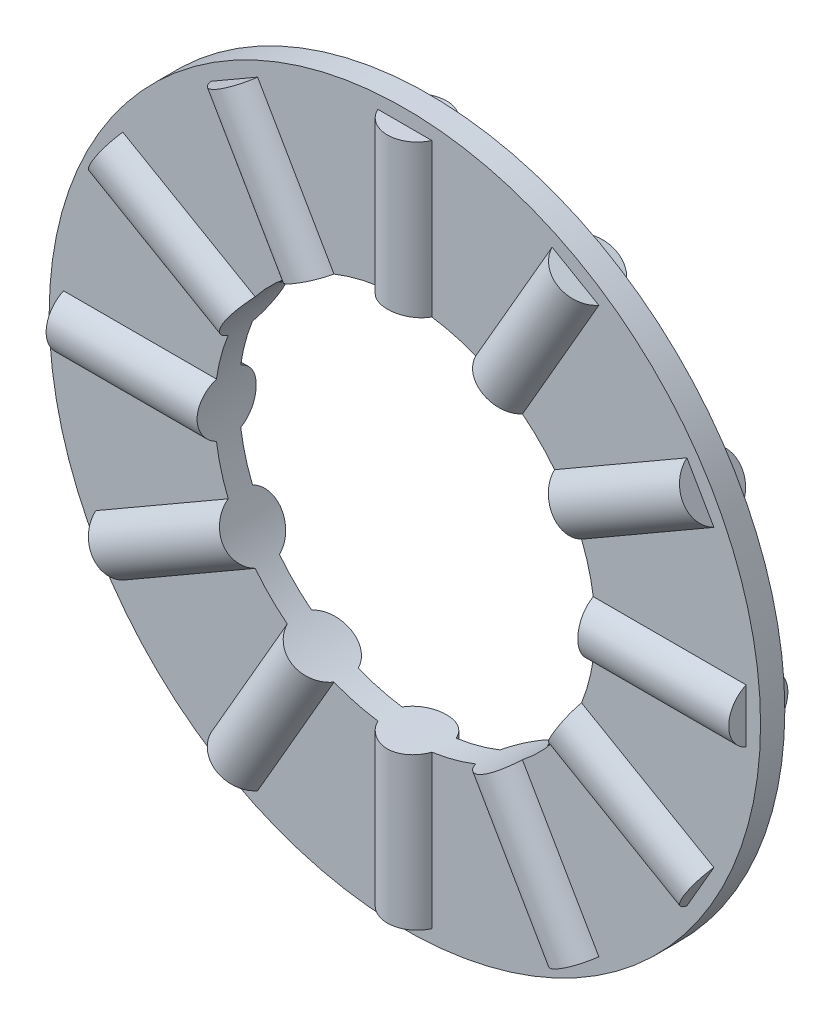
ISO-10303-21;
HEADER;
FILE_DESCRIPTION(('STEP AP214'),'2;1');
FILE_NAME('part.step','',(''),(''),'','','');
FILE_SCHEMA(('AUTOMOTIVE_DESIGN { 1 0 10303 214 1 1 1 1 }'));
ENDSEC;
DATA;
#1=APPLICATION_CONTEXT('core data for automotive mechanical design processes');
#2=APPLICATION_PROTOCOL_DEFINITION('international standard','automotive_design',2000,#1);
#3=PRODUCT_CONTEXT('',#1,'mechanical');
#4=PRODUCT('Part','Part','',(#3));
#5=PRODUCT_RELATED_PRODUCT_CATEGORY('part','',(#4));
#6=PRODUCT_DEFINITION_FORMATION('','',#4);
#7=PRODUCT_DEFINITION_CONTEXT('part definition',#1,'design');
#8=PRODUCT_DEFINITION('design','',#6,#7);
#9=PRODUCT_DEFINITION_SHAPE('','',#8);
#10=(LENGTH_UNIT() NAMED_UNIT(*) SI_UNIT(.MILLI.,.METRE.));
#11=(NAMED_UNIT(*) PLANE_ANGLE_UNIT() SI_UNIT($,.RADIAN.));
#12=(NAMED_UNIT(*) SI_UNIT($,.STERADIAN.) SOLID_ANGLE_UNIT());
#13=UNCERTAINTY_MEASURE_WITH_UNIT(LENGTH_MEASURE(1.E-05),#10,'distance_accuracy_value','');
#14=(GEOMETRIC_REPRESENTATION_CONTEXT(3) GLOBAL_UNCERTAINTY_ASSIGNED_CONTEXT((#13)) GLOBAL_UNIT_ASSIGNED_CONTEXT((#10,
#11,#12)) REPRESENTATION_CONTEXT('',''));
#15=CARTESIAN_POINT('',(0.,0.,0.));
#16=DIRECTION('',(0.,0.,1.));
#17=DIRECTION('',(1.,0.,0.));
#18=AXIS2_PLACEMENT_3D('',#15,#16,#17);
#19=CARTESIAN_POINT('',(11.43,0.,0.4064));
#20=DIRECTION('',(-1.,0.,0.));
#21=DIRECTION('',(0.,0.,1.));
#22=AXIS2_PLACEMENT_3D('',#19,#20,#21);
#23=CYLINDRICAL_SURFACE('',#22,0.9906);
#24=DIRECTION('',(-1.,0.,0.));
#25=VECTOR('',#24,1.);
#26=CARTESIAN_POINT('',(11.43,-0.90339769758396,0.));
#27=LINE('',#26,#25);
#28=CARTESIAN_POINT('',(11.43,-0.90339769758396,0.));
#29=VERTEX_POINT('',#28);
#30=CARTESIAN_POINT('',(6.31106946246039,-0.90339769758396,0.));
#31=VERTEX_POINT('',#30);
#32=EDGE_CURVE('E571',#29,#31,#27,.T.);
#33=ORIENTED_EDGE('',*,*,#32,.T.);
#34=CARTESIAN_POINT('',(6.3754,0.,1.397));
#35=CARTESIAN_POINT('',(6.37539909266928,-0.0552854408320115,1.39699773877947));
#36=CARTESIAN_POINT('',(6.37467335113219,-0.110602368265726,1.39235614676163));
#37=CARTESIAN_POINT('',(6.37184808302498,-0.219688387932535,1.37391805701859));
#38=CARTESIAN_POINT('',(6.36974724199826,-0.273455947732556,1.36011279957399));
#39=CARTESIAN_POINT('',(6.36440772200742,-0.37784889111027,1.32377123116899));
#40=CARTESIAN_POINT('',(6.36116992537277,-0.428476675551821,1.30124168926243));
#41=CARTESIAN_POINT('',(6.35391371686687,-0.525225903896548,1.24810800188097));
#42=CARTESIAN_POINT('',(6.34989540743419,-0.5713479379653,1.21750491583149));
#43=CARTESIAN_POINT('',(6.34148703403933,-0.658169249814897,1.14882045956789));
#44=CARTESIAN_POINT('',(6.33709441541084,-0.698825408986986,1.11068489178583));
#45=CARTESIAN_POINT('',(6.3284523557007,-0.773188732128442,1.02813464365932));
#46=CARTESIAN_POINT('',(6.32420292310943,-0.806895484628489,0.983719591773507));
#47=CARTESIAN_POINT('',(6.31630360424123,-0.866572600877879,0.889579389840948));
#48=CARTESIAN_POINT('',(6.31265701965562,-0.892500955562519,0.83982730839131));
#49=CARTESIAN_POINT('',(6.30641134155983,-0.935616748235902,0.736608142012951));
#50=CARTESIAN_POINT('',(6.30381218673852,-0.952804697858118,0.683141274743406));
#51=CARTESIAN_POINT('',(6.29998087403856,-0.977817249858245,0.574464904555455));
#52=CARTESIAN_POINT('',(6.298737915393,-0.985715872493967,0.519272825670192));
#53=CARTESIAN_POINT('',(6.29772697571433,-0.992154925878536,0.408333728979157));
#54=CARTESIAN_POINT('',(6.29795890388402,-0.990695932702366,0.352586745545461));
#55=CARTESIAN_POINT('',(6.29986166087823,-0.978521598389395,0.242644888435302));
#56=CARTESIAN_POINT('',(6.30151963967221,-0.967888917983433,0.188440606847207));
#57=CARTESIAN_POINT('',(6.30606759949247,-0.937798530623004,0.0825948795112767));
#58=CARTESIAN_POINT('',(6.30895761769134,-0.918340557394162,0.030953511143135));
#59=CARTESIAN_POINT('',(6.31565812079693,-0.871066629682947,-0.0685507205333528));
#60=CARTESIAN_POINT('',(6.31947242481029,-0.843215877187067,-0.116396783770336));
#61=CARTESIAN_POINT('',(6.32758899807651,-0.779971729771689,-0.206767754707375));
#62=CARTESIAN_POINT('',(6.33189130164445,-0.744577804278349,-0.24929228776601));
#63=CARTESIAN_POINT('',(6.34055579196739,-0.666799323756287,-0.328291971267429));
#64=CARTESIAN_POINT('',(6.3449181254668,-0.624343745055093,-0.364697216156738));
#65=CARTESIAN_POINT('',(6.35316828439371,-0.533888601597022,-0.429876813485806));
#66=CARTESIAN_POINT('',(6.35705610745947,-0.485889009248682,-0.458651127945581));
#67=CARTESIAN_POINT('',(6.36392369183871,-0.38564617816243,-0.507756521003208));
#68=CARTESIAN_POINT('',(6.36690284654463,-0.333400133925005,-0.528081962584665));
#69=CARTESIAN_POINT('',(6.37161242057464,-0.22617955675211,-0.559650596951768));
#70=CARTESIAN_POINT('',(6.37334293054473,-0.171205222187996,-0.570894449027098));
#71=CARTESIAN_POINT('',(6.37534817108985,-0.0606916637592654,-0.583887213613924));
#72=CARTESIAN_POINT('',(6.37563762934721,-0.00516399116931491,-0.585732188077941));
#73=CARTESIAN_POINT('',(6.37476831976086,0.105407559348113,-0.580130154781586));
#74=CARTESIAN_POINT('',(6.37360960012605,0.160451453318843,-0.572683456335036));
#75=CARTESIAN_POINT('',(6.36998323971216,0.268200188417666,-0.54878934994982));
#76=CARTESIAN_POINT('',(6.36752244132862,0.320915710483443,-0.532388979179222));
#77=CARTESIAN_POINT('',(6.36156687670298,0.422848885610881,-0.491102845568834));
#78=CARTESIAN_POINT('',(6.35807205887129,0.472066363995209,-0.466216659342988));
#79=CARTESIAN_POINT('',(6.35040002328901,0.566027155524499,-0.408441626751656));
#80=CARTESIAN_POINT('',(6.34621771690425,0.610732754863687,-0.37549213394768));
#81=CARTESIAN_POINT('',(6.33765141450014,0.694014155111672,-0.302609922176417));
#82=CARTESIAN_POINT('',(6.3332674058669,0.732589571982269,-0.26267676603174));
#83=CARTESIAN_POINT('',(6.32474481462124,0.802867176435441,-0.176532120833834));
#84=CARTESIAN_POINT('',(6.32060877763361,0.834504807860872,-0.130267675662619));
#85=CARTESIAN_POINT('',(6.31309627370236,0.889559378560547,-0.03302459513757));
#86=CARTESIAN_POINT('',(6.30971978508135,0.912976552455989,0.0179539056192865));
#87=CARTESIAN_POINT('',(6.30412731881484,0.950826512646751,0.12298924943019));
#88=CARTESIAN_POINT('',(6.30190703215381,0.96529269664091,0.177033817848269));
#89=CARTESIAN_POINT('',(6.29886710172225,0.984935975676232,0.286822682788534));
#90=CARTESIAN_POINT('',(6.29804735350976,0.990113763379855,0.342566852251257));
#91=CARTESIAN_POINT('',(6.29790540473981,0.99101590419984,0.453528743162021));
#92=CARTESIAN_POINT('',(6.29856711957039,0.986841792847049,0.508745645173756));
#93=CARTESIAN_POINT('',(6.30127848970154,0.969376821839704,0.617681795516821));
#94=CARTESIAN_POINT('',(6.30332814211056,0.956085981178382,0.671401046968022));
#95=CARTESIAN_POINT('',(6.30857866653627,0.920801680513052,0.775785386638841));
#96=CARTESIAN_POINT('',(6.31177853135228,0.898815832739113,0.826453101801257));
#97=CARTESIAN_POINT('',(6.31897007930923,0.846775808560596,0.923397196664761));
#98=CARTESIAN_POINT('',(6.32296179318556,0.816721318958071,0.969673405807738));
#99=CARTESIAN_POINT('',(6.33133876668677,0.74903026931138,1.05703586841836));
#100=CARTESIAN_POINT('',(6.33572766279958,0.711318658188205,1.09806362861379));
#101=CARTESIAN_POINT('',(6.34437454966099,0.629542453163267,1.17324414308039));
#102=CARTESIAN_POINT('',(6.34863250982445,0.585476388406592,1.20739530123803));
#103=CARTESIAN_POINT('',(6.35656676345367,0.491933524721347,1.26803557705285));
#104=CARTESIAN_POINT('',(6.36023945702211,0.442426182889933,1.2944780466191));
#105=CARTESIAN_POINT('',(6.3665541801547,0.339637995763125,1.33863211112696));
#106=CARTESIAN_POINT('',(6.36919726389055,0.286361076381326,1.35635264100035));
#107=CARTESIAN_POINT('',(6.37255986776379,0.194045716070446,1.3785935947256));
#108=CARTESIAN_POINT('',(6.37361937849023,0.15557371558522,1.3854852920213));
#109=CARTESIAN_POINT('',(6.37503976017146,0.0780730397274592,1.3946892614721));
#110=CARTESIAN_POINT('',(6.37540064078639,0.0390443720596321,1.39700159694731));
#111=CARTESIAN_POINT('',(6.3754,0.,1.397));
#112=B_SPLINE_CURVE_WITH_KNOTS('',3,(#34,#35,#36,#37,#38,#39,#40,#41,#42,#43,#44,#45,#46,#47,
#48,#49,#50,#51,#52,#53,#54,#55,#56,#57,#58,#59,#60,#61,#62,#63,#64,#65,#66,#67,#68,#69,#70,#71,
#72,#73,#74,#75,#76,#77,#78,#79,#80,#81,#82,#83,#84,#85,#86,#87,#88,#89,#90,#91,#92,#93,#94,#95,
#96,#97,#98,#99,#100,#101,#102,#103,#104,#105,#106,#107,#108,#109,#110,#111),.UNSPECIFIED.,.T.,
.F.,(4,2,2,2,2,2,2,2,2,2,2,2,2,2,2,2,2,2,2,2,2,2,2,2,2,2,2,2,2,2,2,2,2,2,2,2,2,2,4),(0.,
0.165713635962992,0.33158590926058,0.497329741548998,0.663051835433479,0.830012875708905,
0.996983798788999,1.16484089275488,1.33268815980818,1.4991887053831,1.66567900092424,
1.83068459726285,1.99569517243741,2.1613995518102,2.32711559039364,2.49461213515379,
2.66210951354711,2.82971846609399,2.99731524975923,3.16319561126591,3.32907045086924,
3.49408215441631,3.65910209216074,3.82540354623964,3.99171541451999,4.15951469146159,
4.32730917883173,4.49447375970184,4.66162587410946,4.82697198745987,4.99231775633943,
5.15751908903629,5.32272683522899,5.48963964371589,5.65659114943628,5.82453291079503,
5.99230226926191,6.10933623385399,6.22636858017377),.UNSPECIFIED.);
#113=CARTESIAN_POINT('',(6.31106946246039,0.90339769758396,0.));
#114=VERTEX_POINT('',#113);
#115=EDGE_CURVE('E588',#31,#114,#112,.T.);
#116=ORIENTED_EDGE('',*,*,#115,.T.);
#117=DIRECTION('',(-1.,0.,0.));
#118=VECTOR('',#117,1.);
#119=CARTESIAN_POINT('',(11.43,0.90339769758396,0.));
#120=LINE('',#119,#118);
#121=CARTESIAN_POINT('',(11.43,0.90339769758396,0.));
#122=VERTEX_POINT('',#121);
#123=EDGE_CURVE('E561',#114,#122,#120,.F.);
#124=ORIENTED_EDGE('',*,*,#123,.T.);
#125=CARTESIAN_POINT('',(11.43,0.,0.4064));
#126=DIRECTION('',(1.,0.,0.));
#127=DIRECTION('',(0.,0.,-1.));
#128=AXIS2_PLACEMENT_3D('',#125,#126,#127);
#129=CIRCLE('',#128,0.9906);
#130=EDGE_CURVE('E554',#29,#122,#129,.T.);
#131=ORIENTED_EDGE('',*,*,#130,.F.);
#132=EDGE_LOOP('',(#33,#116,#124,#131));
#133=FACE_BOUND('',#132,.T.);
#134=ADVANCED_FACE('F32',(#133),#23,.T.);
#135=CARTESIAN_POINT('',(-11.43,0.90339769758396,0.));
#136=VERTEX_POINT('',#135);
#137=CARTESIAN_POINT('',(-6.31106946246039,0.90339769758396,0.));
#138=VERTEX_POINT('',#137);
#139=EDGE_CURVE('E564',#136,#138,#120,.F.);
#140=ORIENTED_EDGE('',*,*,#139,.T.);
#141=CARTESIAN_POINT('',(-6.3754,0.,1.397));
#142=CARTESIAN_POINT('',(-6.37539909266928,0.0552854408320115,1.39699773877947));
#143=CARTESIAN_POINT('',(-6.37467335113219,0.110602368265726,1.39235614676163));
#144=CARTESIAN_POINT('',(-6.37184808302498,0.219688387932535,1.37391805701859));
#145=CARTESIAN_POINT('',(-6.36974724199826,0.273455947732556,1.36011279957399));
#146=CARTESIAN_POINT('',(-6.36440772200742,0.37784889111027,1.32377123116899));
#147=CARTESIAN_POINT('',(-6.36116992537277,0.428476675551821,1.30124168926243));
#148=CARTESIAN_POINT('',(-6.35391371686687,0.525225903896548,1.24810800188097));
#149=CARTESIAN_POINT('',(-6.34989540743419,0.5713479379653,1.21750491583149));
#150=CARTESIAN_POINT('',(-6.34148703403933,0.658169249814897,1.14882045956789));
#151=CARTESIAN_POINT('',(-6.33709441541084,0.698825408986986,1.11068489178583));
#152=CARTESIAN_POINT('',(-6.3284523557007,0.773188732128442,1.02813464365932));
#153=CARTESIAN_POINT('',(-6.32420292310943,0.806895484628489,0.983719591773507));
#154=CARTESIAN_POINT('',(-6.31630360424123,0.866572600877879,0.889579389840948));
#155=CARTESIAN_POINT('',(-6.31265701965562,0.892500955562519,0.83982730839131));
#156=CARTESIAN_POINT('',(-6.30641134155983,0.935616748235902,0.736608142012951));
#157=CARTESIAN_POINT('',(-6.30381218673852,0.952804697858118,0.683141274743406));
#158=CARTESIAN_POINT('',(-6.29998087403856,0.977817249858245,0.574464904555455));
#159=CARTESIAN_POINT('',(-6.298737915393,0.985715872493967,0.519272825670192));
#160=CARTESIAN_POINT('',(-6.29772697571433,0.992154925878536,0.408333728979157));
#161=CARTESIAN_POINT('',(-6.29795890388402,0.990695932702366,0.352586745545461));
#162=CARTESIAN_POINT('',(-6.29986166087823,0.978521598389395,0.242644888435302));
#163=CARTESIAN_POINT('',(-6.30151963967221,0.967888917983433,0.188440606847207));
#164=CARTESIAN_POINT('',(-6.30606759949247,0.937798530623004,0.0825948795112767));
#165=CARTESIAN_POINT('',(-6.30895761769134,0.918340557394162,0.030953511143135));
#166=CARTESIAN_POINT('',(-6.31565812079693,0.871066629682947,-0.0685507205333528));
#167=CARTESIAN_POINT('',(-6.31947242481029,0.843215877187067,-0.116396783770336));
#168=CARTESIAN_POINT('',(-6.32758899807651,0.779971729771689,-0.206767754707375));
#169=CARTESIAN_POINT('',(-6.33189130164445,0.744577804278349,-0.24929228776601));
#170=CARTESIAN_POINT('',(-6.34055579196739,0.666799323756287,-0.328291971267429));
#171=CARTESIAN_POINT('',(-6.3449181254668,0.624343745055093,-0.364697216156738));
#172=CARTESIAN_POINT('',(-6.35316828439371,0.533888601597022,-0.429876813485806));
#173=CARTESIAN_POINT('',(-6.35705610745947,0.485889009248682,-0.458651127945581));
#174=CARTESIAN_POINT('',(-6.36392369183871,0.38564617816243,-0.507756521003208));
#175=CARTESIAN_POINT('',(-6.36690284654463,0.333400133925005,-0.528081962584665));
#176=CARTESIAN_POINT('',(-6.37161242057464,0.22617955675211,-0.559650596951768));
#177=CARTESIAN_POINT('',(-6.37334293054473,0.171205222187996,-0.570894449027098));
#178=CARTESIAN_POINT('',(-6.37534817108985,0.0606916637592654,-0.583887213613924));
#179=CARTESIAN_POINT('',(-6.37563762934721,0.00516399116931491,-0.585732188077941));
#180=CARTESIAN_POINT('',(-6.37476831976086,-0.105407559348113,-0.580130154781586));
#181=CARTESIAN_POINT('',(-6.37360960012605,-0.160451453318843,-0.572683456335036));
#182=CARTESIAN_POINT('',(-6.36998323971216,-0.268200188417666,-0.54878934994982));
#183=CARTESIAN_POINT('',(-6.36752244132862,-0.320915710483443,-0.532388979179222));
#184=CARTESIAN_POINT('',(-6.36156687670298,-0.422848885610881,-0.491102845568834));
#185=CARTESIAN_POINT('',(-6.35807205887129,-0.472066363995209,-0.466216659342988));
#186=CARTESIAN_POINT('',(-6.35040002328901,-0.566027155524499,-0.408441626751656));
#187=CARTESIAN_POINT('',(-6.34621771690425,-0.610732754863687,-0.37549213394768));
#188=CARTESIAN_POINT('',(-6.33765141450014,-0.694014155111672,-0.302609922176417));
#189=CARTESIAN_POINT('',(-6.3332674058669,-0.732589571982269,-0.26267676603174));
#190=CARTESIAN_POINT('',(-6.32474481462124,-0.802867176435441,-0.176532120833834));
#191=CARTESIAN_POINT('',(-6.32060877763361,-0.834504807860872,-0.130267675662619));
#192=CARTESIAN_POINT('',(-6.31309627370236,-0.889559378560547,-0.03302459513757));
#193=CARTESIAN_POINT('',(-6.30971978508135,-0.912976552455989,0.0179539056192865));
#194=CARTESIAN_POINT('',(-6.30412731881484,-0.950826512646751,0.12298924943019));
#195=CARTESIAN_POINT('',(-6.30190703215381,-0.96529269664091,0.177033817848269));
#196=CARTESIAN_POINT('',(-6.29886710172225,-0.984935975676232,0.286822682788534));
#197=CARTESIAN_POINT('',(-6.29804735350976,-0.990113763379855,0.342566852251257));
#198=CARTESIAN_POINT('',(-6.29790540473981,-0.99101590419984,0.453528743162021));
#199=CARTESIAN_POINT('',(-6.29856711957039,-0.986841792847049,0.508745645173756));
#200=CARTESIAN_POINT('',(-6.30127848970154,-0.969376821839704,0.617681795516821));
#201=CARTESIAN_POINT('',(-6.30332814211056,-0.956085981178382,0.671401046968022));
#202=CARTESIAN_POINT('',(-6.30857866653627,-0.920801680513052,0.775785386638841));
#203=CARTESIAN_POINT('',(-6.31177853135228,-0.898815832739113,0.826453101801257));
#204=CARTESIAN_POINT('',(-6.31897007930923,-0.846775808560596,0.923397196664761));
#205=CARTESIAN_POINT('',(-6.32296179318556,-0.816721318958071,0.969673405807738));
#206=CARTESIAN_POINT('',(-6.33133876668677,-0.74903026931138,1.05703586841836));
#207=CARTESIAN_POINT('',(-6.33572766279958,-0.711318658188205,1.09806362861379));
#208=CARTESIAN_POINT('',(-6.34437454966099,-0.629542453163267,1.17324414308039));
#209=CARTESIAN_POINT('',(-6.34863250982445,-0.585476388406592,1.20739530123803));
#210=CARTESIAN_POINT('',(-6.35656676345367,-0.491933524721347,1.26803557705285));
#211=CARTESIAN_POINT('',(-6.36023945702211,-0.442426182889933,1.2944780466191));
#212=CARTESIAN_POINT('',(-6.3665541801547,-0.339637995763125,1.33863211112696));
#213=CARTESIAN_POINT('',(-6.36919726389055,-0.286361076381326,1.35635264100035));
#214=CARTESIAN_POINT('',(-6.37255986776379,-0.194045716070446,1.3785935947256));
#215=CARTESIAN_POINT('',(-6.37361937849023,-0.15557371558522,1.3854852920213));
#216=CARTESIAN_POINT('',(-6.37503976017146,-0.0780730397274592,1.3946892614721));
#217=CARTESIAN_POINT('',(-6.37540064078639,-0.0390443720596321,1.39700159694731));
#218=CARTESIAN_POINT('',(-6.3754,0.,1.397));
#219=B_SPLINE_CURVE_WITH_KNOTS('',3,(#141,#142,#143,#144,#145,#146,#147,#148,#149,#150,#151,
#152,#153,#154,#155,#156,#157,#158,#159,#160,#161,#162,#163,#164,#165,#166,#167,#168,#169,#170,
#171,#172,#173,#174,#175,#176,#177,#178,#179,#180,#181,#182,#183,#184,#185,#186,#187,#188,#189,
#190,#191,#192,#193,#194,#195,#196,#197,#198,#199,#200,#201,#202,#203,#204,#205,#206,#207,#208,
#209,#210,#211,#212,#213,#214,#215,#216,#217,#218),.UNSPECIFIED.,.T.,.F.,(4,2,2,2,2,2,2,2,2,2,2,
2,2,2,2,2,2,2,2,2,2,2,2,2,2,2,2,2,2,2,2,2,2,2,2,2,2,2,4),(0.,0.165713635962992,0.33158590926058,
0.497329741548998,0.663051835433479,0.830012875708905,0.996983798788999,1.16484089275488,
1.33268815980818,1.4991887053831,1.66567900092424,1.83068459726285,1.99569517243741,
2.1613995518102,2.32711559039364,2.49461213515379,2.66210951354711,2.82971846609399,
2.99731524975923,3.16319561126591,3.32907045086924,3.49408215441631,3.65910209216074,
3.82540354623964,3.99171541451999,4.15951469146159,4.32730917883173,4.49447375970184,
4.66162587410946,4.82697198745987,4.99231775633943,5.15751908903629,5.32272683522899,
5.48963964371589,5.65659114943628,5.82453291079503,5.99230226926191,6.10933623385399,
6.22636858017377),.UNSPECIFIED.);
#220=CARTESIAN_POINT('',(-6.31106946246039,-0.90339769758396,0.));
#221=VERTEX_POINT('',#220);
#222=EDGE_CURVE('E589',#138,#221,#219,.T.);
#223=ORIENTED_EDGE('',*,*,#222,.T.);
#224=CARTESIAN_POINT('',(-11.43,-0.90339769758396,0.));
#225=VERTEX_POINT('',#224);
#226=EDGE_CURVE('E567',#221,#225,#27,.T.);
#227=ORIENTED_EDGE('',*,*,#226,.T.);
#228=CARTESIAN_POINT('',(-11.43,0.,0.4064));
#229=DIRECTION('',(1.,0.,0.));
#230=DIRECTION('',(0.,0.,-1.));
#231=AXIS2_PLACEMENT_3D('',#228,#229,#230);
#232=CIRCLE('',#231,0.9906);
#233=EDGE_CURVE('E553',#225,#136,#232,.T.);
#234=ORIENTED_EDGE('',*,*,#233,.T.);
#235=EDGE_LOOP('',(#140,#223,#227,#234));
#236=FACE_BOUND('',#235,.T.);
#237=ADVANCED_FACE('F746',(#236),#23,.T.);
#238=CARTESIAN_POINT('',(9.89867036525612,5.71500000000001,0.4064));
#239=DIRECTION('',(-0.866025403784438,-0.500000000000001,0.));
#240=DIRECTION('',(0.500000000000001,-0.866025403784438,0.));
#241=AXIS2_PLACEMENT_3D('',#238,#239,#240);
#242=CYLINDRICAL_SURFACE('',#241,0.9906);
#243=DIRECTION('',(-0.866025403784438,-0.500000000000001,0.));
#244=VECTOR('',#243,1.);
#245=CARTESIAN_POINT('',(10.3503692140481,4.93263464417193,0.8128));
#246=LINE('',#245,#244);
#247=CARTESIAN_POINT('',(-5.01384763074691,-3.93790008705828,0.8128));
#248=VERTEX_POINT('',#247);
#249=CARTESIAN_POINT('',(-9.44697151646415,-6.49736535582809,0.8128));
#250=VERTEX_POINT('',#249);
#251=EDGE_CURVE('E473',#248,#250,#246,.T.);
#252=ORIENTED_EDGE('',*,*,#251,.F.);
#253=CARTESIAN_POINT('',(-4.95890274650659,-4.00687018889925,0.4064));
#254=CARTESIAN_POINT('',(-4.95890470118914,-4.0068687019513,0.461680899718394));
#255=CARTESIAN_POINT('',(-4.96186146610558,-4.0032169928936,0.516993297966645));
#256=CARTESIAN_POINT('',(-4.97355359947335,-3.98868066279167,0.626069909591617));
#257=CARTESIAN_POINT('',(-4.98229450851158,-3.97778910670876,0.679832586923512));
#258=CARTESIAN_POINT('',(-5.00512947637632,-3.94901748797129,0.784215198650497));
#259=CARTESIAN_POINT('',(-5.0192193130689,-3.9311429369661,0.834837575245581));
#260=CARTESIAN_POINT('',(-5.05210467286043,-3.88878889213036,0.931577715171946));
#261=CARTESIAN_POINT('',(-5.07089958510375,-3.86431025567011,0.977696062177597));
#262=CARTESIAN_POINT('',(-5.11254055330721,-3.8090493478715,1.06452142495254));
#263=CARTESIAN_POINT('',(-5.13541660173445,-3.77822012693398,1.10518418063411));
#264=CARTESIAN_POINT('',(-5.18417014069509,-3.71104085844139,1.17956026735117));
#265=CARTESIAN_POINT('',(-5.21004780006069,-3.67469050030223,1.21327320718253));
#266=CARTESIAN_POINT('',(-5.26392584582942,-3.59708897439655,1.27295688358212));
#267=CARTESIAN_POINT('',(-5.29193650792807,-3.55581345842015,1.29888672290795));
#268=CARTESIAN_POINT('',(-5.34890791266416,-3.46952145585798,1.34200556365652));
#269=CARTESIAN_POINT('',(-5.37786860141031,-3.42450518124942,1.35919505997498));
#270=CARTESIAN_POINT('',(-5.4354867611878,-3.33228744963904,1.38421071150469));
#271=CARTESIAN_POINT('',(-5.46414479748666,-3.28510648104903,1.39211106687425));
#272=CARTESIAN_POINT('',(-5.52047681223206,-3.18953549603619,1.39855467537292));
#273=CARTESIAN_POINT('',(-5.54815084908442,-3.14114555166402,1.39709848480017));
#274=CARTESIAN_POINT('',(-5.60150010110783,-3.04498284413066,1.38492867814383));
#275=CARTESIAN_POINT('',(-5.6271904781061,-2.99720835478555,1.37429489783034));
#276=CARTESIAN_POINT('',(-5.6762289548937,-2.90326702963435,1.34419720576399));
#277=CARTESIAN_POINT('',(-5.69957699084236,-2.85710023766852,1.32473305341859));
#278=CARTESIAN_POINT('',(-5.7435782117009,-2.76758639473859,1.27744614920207));
#279=CARTESIAN_POINT('',(-5.76422015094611,-2.72425146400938,1.24959001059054));
#280=CARTESIAN_POINT('',(-5.80240771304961,-2.64194090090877,1.18633426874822));
#281=CARTESIAN_POINT('',(-5.8199531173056,-2.60296557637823,1.15093413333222));
#282=CARTESIAN_POINT('',(-5.85194746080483,-2.53022424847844,1.0731511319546));
#283=CARTESIAN_POINT('',(-5.86636177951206,-2.49651754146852,1.03069853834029));
#284=CARTESIAN_POINT('',(-5.89177368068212,-2.43594139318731,0.940251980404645));
#285=CARTESIAN_POINT('',(-5.90277123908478,-2.40907200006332,0.89225797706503));
#286=CARTESIAN_POINT('',(-5.92133004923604,-2.363089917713,0.792016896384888));
#287=CARTESIAN_POINT('',(-5.9288882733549,-2.34398406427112,0.739766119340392));
#288=CARTESIAN_POINT('',(-5.94055121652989,-2.31426741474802,0.632535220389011));
#289=CARTESIAN_POINT('',(-5.94465619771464,-2.30365597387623,0.577555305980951));
#290=CARTESIAN_POINT('',(-5.94939304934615,-2.29139496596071,0.467038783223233));
#291=CARTESIAN_POINT('',(-5.95006057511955,-2.2896533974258,0.411513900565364));
#292=CARTESIAN_POINT('',(-5.94801980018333,-2.29494953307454,0.300948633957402));
#293=CARTESIAN_POINT('',(-5.94531161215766,-2.30198694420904,0.245908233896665));
#294=CARTESIAN_POINT('',(-5.93654000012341,-2.32451312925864,0.138178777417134));
#295=CARTESIAN_POINT('',(-5.93049481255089,-2.33995596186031,0.0854786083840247));
#296=CARTESIAN_POINT('',(-5.91505967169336,-2.3787027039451,-0.0164255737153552));
#297=CARTESIAN_POINT('',(-5.90566954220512,-2.4020070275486,-0.0656294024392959));
#298=CARTESIAN_POINT('',(-5.88346835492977,-2.45588637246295,-0.159580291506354));
#299=CARTESIAN_POINT('',(-5.87063033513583,-2.48651848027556,-0.204288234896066));
#300=CARTESIAN_POINT('',(-5.84162149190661,-2.55392374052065,-0.2875754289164));
#301=CARTESIAN_POINT('',(-5.82545046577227,-2.59069726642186,-0.326154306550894));
#302=CARTESIAN_POINT('',(-5.7897407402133,-2.66955310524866,-0.396440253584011));
#303=CARTESIAN_POINT('',(-5.77017313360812,-2.7116800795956,-0.428082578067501));
#304=CARTESIAN_POINT('',(-5.72801465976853,-2.7996335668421,-0.48314537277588));
#305=CARTESIAN_POINT('',(-5.70542388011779,-2.84545997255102,-0.506566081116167));
#306=CARTESIAN_POINT('',(-5.65770517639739,-2.93919202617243,-0.544418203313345));
#307=CARTESIAN_POINT('',(-5.63258755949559,-2.98708880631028,-0.55888454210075));
#308=CARTESIAN_POINT('',(-5.58030239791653,-3.08366068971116,-0.578530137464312));
#309=CARTESIAN_POINT('',(-5.55313499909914,-3.13233573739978,-0.583710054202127));
#310=CARTESIAN_POINT('',(-5.49777487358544,-3.228504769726,-0.584618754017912));
#311=CARTESIAN_POINT('',(-5.46959594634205,-3.27600579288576,-0.580446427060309));
#312=CARTESIAN_POINT('',(-5.41279695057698,-3.36902434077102,-0.562981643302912));
#313=CARTESIAN_POINT('',(-5.38417688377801,-3.41454187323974,-0.549689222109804));
#314=CARTESIAN_POINT('',(-5.32746981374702,-3.50235957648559,-0.51439756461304));
#315=CARTESIAN_POINT('',(-5.29938238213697,-3.54466242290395,-0.492405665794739));
#316=CARTESIAN_POINT('',(-5.24471231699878,-3.62506334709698,-0.440350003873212));
#317=CARTESIAN_POINT('',(-5.21812973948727,-3.66316126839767,-0.410285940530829));
#318=CARTESIAN_POINT('',(-5.16721491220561,-3.7346436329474,-0.342583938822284));
#319=CARTESIAN_POINT('',(-5.14290786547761,-3.76797704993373,-0.304873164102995));
#320=CARTESIAN_POINT('',(-5.09782891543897,-3.82874664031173,-0.223101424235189));
#321=CARTESIAN_POINT('',(-5.07705784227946,-3.8561814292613,-0.179038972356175));
#322=CARTESIAN_POINT('',(-5.03983647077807,-3.90470448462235,-0.0854994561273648));
#323=CARTESIAN_POINT('',(-5.02341312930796,-3.92575326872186,-0.0359911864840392));
#324=CARTESIAN_POINT('',(-4.99582367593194,-3.96080456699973,0.06679887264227));
#325=CARTESIAN_POINT('',(-4.98465217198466,-3.97481430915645,0.120076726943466));
#326=CARTESIAN_POINT('',(-4.97059101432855,-3.99237170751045,0.21238686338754));
#327=CARTESIAN_POINT('',(-4.96621829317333,-3.99780225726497,0.250852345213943));
#328=CARTESIAN_POINT('',(-4.96037349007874,-4.00505199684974,0.328339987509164));
#329=CARTESIAN_POINT('',(-4.95890136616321,-4.00687123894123,0.367362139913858));
#330=CARTESIAN_POINT('',(-4.95890274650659,-4.00687018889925,0.4064));
#331=B_SPLINE_CURVE_WITH_KNOTS('',3,(#253,#254,#255,#256,#257,#258,#259,#260,#261,#262,#263,
#264,#265,#266,#267,#268,#269,#270,#271,#272,#273,#274,#275,#276,#277,#278,#279,#280,#281,#282,
#283,#284,#285,#286,#287,#288,#289,#290,#291,#292,#293,#294,#295,#296,#297,#298,#299,#300,#301,
#302,#303,#304,#305,#306,#307,#308,#309,#310,#311,#312,#313,#314,#315,#316,#317,#318,#319,#320,
#321,#322,#323,#324,#325,#326,#327,#328,#329,#330),.UNSPECIFIED.,.T.,.F.,(4,2,2,2,2,2,2,2,2,2,2,
2,2,2,2,2,2,2,2,2,2,2,2,2,2,2,2,2,2,2,2,2,2,2,2,2,2,2,4),(0.,0.165699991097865,
0.331558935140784,0.497287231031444,0.662994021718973,0.829972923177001,0.996961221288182,
1.16481220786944,1.33265368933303,1.49914517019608,1.66562675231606,1.83067454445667,
1.99572683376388,2.16144463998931,2.3271741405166,2.4946520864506,2.66213121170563,
2.82975748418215,2.99737103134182,3.16324243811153,3.32910830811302,3.49407658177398,
3.65905354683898,3.82536019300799,3.99167695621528,4.15948559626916,4.32728937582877,
4.49443447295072,4.66156768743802,4.82694199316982,4.99231565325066,5.15755012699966,
5.32279074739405,5.48968623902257,5.6566208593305,5.82456747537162,5.99234128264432,
6.10935577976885,6.22636858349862),.UNSPECIFIED.);
#332=CARTESIAN_POINT('',(-5.91724532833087,-2.37316937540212,0.8128));
#333=VERTEX_POINT('',#332);
#334=EDGE_CURVE('E647',#248,#333,#331,.T.);
#335=ORIENTED_EDGE('',*,*,#334,.T.);
#336=DIRECTION('',(-0.866025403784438,-0.500000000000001,0.));
#337=VECTOR('',#336,1.);
#338=CARTESIAN_POINT('',(9.44697151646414,6.49736535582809,0.8128));
#339=LINE('',#338,#337);
#340=CARTESIAN_POINT('',(-10.3503692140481,-4.93263464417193,0.8128));
#341=VERTEX_POINT('',#340);
#342=EDGE_CURVE('E479',#341,#333,#339,.F.);
#343=ORIENTED_EDGE('',*,*,#342,.F.);
#344=CARTESIAN_POINT('',(-9.89867036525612,-5.71500000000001,0.4064));
#345=DIRECTION('',(0.866025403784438,0.500000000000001,0.));
#346=DIRECTION('',(0.,0.,-1.));
#347=AXIS2_PLACEMENT_3D('',#344,#345,#346);
#348=CIRCLE('',#347,0.9906);
#349=EDGE_CURVE('E814',#341,#250,#348,.T.);
#350=ORIENTED_EDGE('',*,*,#349,.T.);
#351=EDGE_LOOP('',(#252,#335,#343,#350));
#352=FACE_BOUND('',#351,.T.);
#353=ADVANCED_FACE('F729',(#352),#242,.T.);
#354=CARTESIAN_POINT('',(-9.89867036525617,5.71499999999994,0.4064));
#355=DIRECTION('',(0.866025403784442,-0.499999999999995,0.));
#356=DIRECTION('',(0.499999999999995,0.866025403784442,0.));
#357=AXIS2_PLACEMENT_3D('',#354,#355,#356);
#358=CYLINDRICAL_SURFACE('',#357,0.9906);
#359=DIRECTION('',(0.866025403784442,-0.499999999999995,0.));
#360=VECTOR('',#359,1.);
#361=CARTESIAN_POINT('',(-9.44697151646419,6.49736535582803,0.8128));
#362=LINE('',#361,#360);
#363=CARTESIAN_POINT('',(5.91724532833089,-2.37316937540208,0.8128));
#364=VERTEX_POINT('',#363);
#365=CARTESIAN_POINT('',(10.3503692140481,-4.93263464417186,0.8128));
#366=VERTEX_POINT('',#365);
#367=EDGE_CURVE('E451',#364,#366,#362,.T.);
#368=ORIENTED_EDGE('',*,*,#367,.F.);
#369=CARTESIAN_POINT('',(5.9495027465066,-2.29110065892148,0.4064));
#370=CARTESIAN_POINT('',(5.94950243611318,-2.29110309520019,0.461680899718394));
#371=CARTESIAN_POINT('',(5.94781834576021,-2.29548958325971,0.516993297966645));
#372=CARTESIAN_POINT('',(5.94107558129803,-2.3128834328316,0.626069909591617));
#373=CARTESIAN_POINT('',(5.9360136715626,-2.32589906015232,0.679832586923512));
#374=CARTESIAN_POINT('',(5.92251420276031,-2.36006053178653,0.784215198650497));
#375=CARTESIAN_POINT('',(5.91407930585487,-2.38119996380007,0.834837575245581));
#376=CARTESIAN_POINT('',(5.89384230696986,-2.43085654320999,0.931577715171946));
#377=CARTESIAN_POINT('',(5.88204064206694,-2.45937273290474,0.977696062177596));
#378=CARTESIAN_POINT('',(5.85500377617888,-2.52306532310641,1.06452142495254));
#379=CARTESIAN_POINT('',(5.83974291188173,-2.55829117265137,1.10518418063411));
#380=CARTESIAN_POINT('',(5.80594072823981,-2.63410261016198,1.17956026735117));
#381=CARTESIAN_POINT('',(5.78739922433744,-2.67468849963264,1.21327320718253));
#382=CARTESIAN_POINT('',(5.74713335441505,-2.76014901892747,1.27295688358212));
#383=CARTESIAN_POINT('',(5.7253930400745,-2.80504472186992,1.29888672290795));
#384=CARTESIAN_POINT('',(5.67914767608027,-2.89752940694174,1.34200556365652));
#385=CARTESIAN_POINT('',(5.6546427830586,-2.94511823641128,1.35919505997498));
#386=CARTESIAN_POINT('',(5.60358896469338,-3.04112589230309,1.38421071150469));
#387=CARTESIAN_POINT('',(5.57705806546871,-3.08953496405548,1.39211106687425));
#388=CARTESIAN_POINT('',(5.52245717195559,-3.18610541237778,1.39855467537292));
#389=CARTESIAN_POINT('',(5.49438726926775,-3.23426680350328,1.39709848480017));
#390=CARTESIAN_POINT('',(5.43778254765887,-3.32854996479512,1.38492867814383));
#391=CARTESIAN_POINT('',(5.40925381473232,-3.37468572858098,1.37429489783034));
#392=CARTESIAN_POINT('',(5.35241747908,-3.46412495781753,1.34419720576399));
#393=CARTESIAN_POINT('',(5.3241098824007,-3.50742834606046,1.32473305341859));
#394=CARTESIAN_POINT('',(5.26858923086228,-3.59029144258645,1.27744614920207));
#395=CARTESIAN_POINT('',(5.24138104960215,-3.62983535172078,1.24959001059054));
#396=CARTESIAN_POINT('',(5.18919179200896,-3.70406203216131,1.18633426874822));
#397=CARTESIAN_POINT('',(5.16421087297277,-3.73874446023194,1.15093413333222));
#398=CARTESIAN_POINT('',(5.11721220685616,-3.80282303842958,1.0731511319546));
#399=CARTESIAN_POINT('',(5.09522850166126,-3.83215955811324,1.03069853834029));
#400=CARTESIAN_POINT('',(5.05547396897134,-3.88445498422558,0.940251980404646));
#401=CARTESIAN_POINT('',(5.03770317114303,-3.90741384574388,0.892257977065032));
#402=CARTESIAN_POINT('',(5.00716092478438,-3.94647728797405,0.79201689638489));
#403=CARTESIAN_POINT('',(4.99439388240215,-3.96257582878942,0.739766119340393));
#404=CARTESIAN_POINT('',(4.97448998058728,-3.9875345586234,0.632535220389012));
#405=CARTESIAN_POINT('',(4.96735269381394,-3.99639529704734,0.577555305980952));
#406=CARTESIAN_POINT('',(4.95910277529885,-4.00662803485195,0.467038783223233));
#407=CARTESIAN_POINT('',(4.95792829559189,-4.00807691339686,0.411513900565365));
#408=CARTESIAN_POINT('',(4.96149449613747,-4.00366148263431,0.300948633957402));
#409=CARTESIAN_POINT('',(4.96623497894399,-3.9977974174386,0.245908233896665));
#410=CARTESIAN_POINT('',(4.98135742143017,-3.97893788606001,0.138178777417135));
#411=CARTESIAN_POINT('',(4.99170871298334,-3.96598118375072,0.0854786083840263));
#412=CARTESIAN_POINT('',(5.01754680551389,-3.93324058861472,-0.0164255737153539));
#413=CARTESIAN_POINT('',(5.03303387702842,-3.91345633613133,-0.0656294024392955));
#414=CARTESIAN_POINT('',(5.06859416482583,-3.86728987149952,-0.159580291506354));
#415=CARTESIAN_POINT('',(5.08870333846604,-3.84085576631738,-0.204288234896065));
#416=CARTESIAN_POINT('',(5.13257358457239,-3.78203074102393,-0.287575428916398));
#417=CARTESIAN_POINT('',(5.15633487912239,-3.74963945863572,-0.326154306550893));
#418=CARTESIAN_POINT('',(5.20677117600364,-3.67928600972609,-0.396440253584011));
#419=CARTESIAN_POINT('',(5.23347040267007,-3.64127647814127,-0.428082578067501));
#420=CARTESIAN_POINT('',(5.28856112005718,-3.56078942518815,-0.48314537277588));
#421=CARTESIAN_POINT('',(5.31695256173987,-3.51831203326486,-0.506566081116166));
#422=CARTESIAN_POINT('',(5.3742675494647,-3.43012039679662,-0.544418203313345));
#423=CARTESIAN_POINT('',(5.40318856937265,-3.38441951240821,-0.558884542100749));
#424=CARTESIAN_POINT('',(5.46067969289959,-3.29085329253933,-0.578530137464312));
#425=CARTESIAN_POINT('',(5.48924982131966,-3.24298811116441,-0.583710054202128));
#426=CARTESIAN_POINT('',(5.54485458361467,-3.14696031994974,-0.584618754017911));
#427=CARTESIAN_POINT('',(5.57190221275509,-3.0988061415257,-0.580446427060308));
#428=CARTESIAN_POINT('',(5.62405914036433,-3.00310749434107,-0.562981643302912));
#429=CARTESIAN_POINT('',(5.64916844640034,-2.95556302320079,-0.549689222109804));
#430=CARTESIAN_POINT('',(5.69686727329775,-2.86254440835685,-0.51439756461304));
#431=CARTESIAN_POINT('',(5.71945889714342,-2.81706855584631,-0.49240566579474));
#432=CARTESIAN_POINT('',(5.76175310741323,-2.72952242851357,-0.440350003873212));
#433=CARTESIAN_POINT('',(5.78145558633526,-2.68745228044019,-0.410285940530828));
#434=CARTESIAN_POINT('',(5.81790371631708,-2.60761756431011,-0.342583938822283));
#435=CARTESIAN_POINT('',(5.83461777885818,-2.56990033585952,-0.304873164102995));
#436=CARTESIAN_POINT('',(5.86470631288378,-2.50047602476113,-0.223101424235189));
#437=CARTESIAN_POINT('',(5.87808000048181,-2.46877035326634,-0.179038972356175));
#438=CARTESIAN_POINT('',(5.90149151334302,-2.41227417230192,-0.0854994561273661));
#439=CARTESIAN_POINT('',(5.91150862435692,-2.38752674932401,-0.0359911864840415));
#440=CARTESIAN_POINT('',(5.92806921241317,-2.34610793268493,0.0667988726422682));
#441=CARTESIAN_POINT('',(5.93461625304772,-2.32942825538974,0.120076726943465));
#442=CARTESIAN_POINT('',(5.94279082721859,-2.30847223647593,0.212386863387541));
#443=CARTESIAN_POINT('',(5.94530746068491,-2.30197007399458,0.250852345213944));
#444=CARTESIAN_POINT('',(5.94866351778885,-2.29328345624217,0.328339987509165));
#445=CARTESIAN_POINT('',(5.94950296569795,-2.29109893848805,0.367362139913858));
#446=CARTESIAN_POINT('',(5.9495027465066,-2.29110065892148,0.4064));
#447=B_SPLINE_CURVE_WITH_KNOTS('',3,(#369,#370,#371,#372,#373,#374,#375,#376,#377,#378,#379,
#380,#381,#382,#383,#384,#385,#386,#387,#388,#389,#390,#391,#392,#393,#394,#395,#396,#397,#398,
#399,#400,#401,#402,#403,#404,#405,#406,#407,#408,#409,#410,#411,#412,#413,#414,#415,#416,#417,
#418,#419,#420,#421,#422,#423,#424,#425,#426,#427,#428,#429,#430,#431,#432,#433,#434,#435,#436,
#437,#438,#439,#440,#441,#442,#443,#444,#445,#446),.UNSPECIFIED.,.T.,.F.,(4,2,2,2,2,2,2,2,2,2,2,
2,2,2,2,2,2,2,2,2,2,2,2,2,2,2,2,2,2,2,2,2,2,2,2,2,2,2,4),(0.,0.165699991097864,
0.331558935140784,0.497287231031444,0.662994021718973,0.829972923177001,0.996961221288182,
1.16481220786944,1.33265368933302,1.49914517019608,1.66562675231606,1.83067454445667,
1.99572683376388,2.16144463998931,2.3271741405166,2.4946520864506,2.66213121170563,
2.82975748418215,2.99737103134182,3.16324243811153,3.32910830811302,3.49407658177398,
3.65905354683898,3.82536019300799,3.99167695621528,4.15948559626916,4.32728937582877,
4.49443447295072,4.66156768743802,4.82694199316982,4.99231565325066,5.15755012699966,
5.32279074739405,5.48968623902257,5.6566208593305,5.82456747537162,5.99234128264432,
6.10935577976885,6.22636858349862),.UNSPECIFIED.);
#448=CARTESIAN_POINT('',(5.01384763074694,-3.93790008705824,0.812800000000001));
#449=VERTEX_POINT('',#448);
#450=EDGE_CURVE('E51',#364,#449,#447,.T.);
#451=ORIENTED_EDGE('',*,*,#450,.T.);
#452=DIRECTION('',(0.866025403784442,-0.499999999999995,0.));
#453=VECTOR('',#452,1.);
#454=CARTESIAN_POINT('',(-10.3503692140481,4.93263464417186,0.8128));
#455=LINE('',#454,#453);
#456=CARTESIAN_POINT('',(9.44697151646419,-6.49736535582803,0.8128));
#457=VERTEX_POINT('',#456);
#458=EDGE_CURVE('E450',#457,#449,#455,.F.);
#459=ORIENTED_EDGE('',*,*,#458,.F.);
#460=CARTESIAN_POINT('',(9.89867036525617,-5.71499999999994,0.4064));
#461=DIRECTION('',(-0.866025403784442,0.499999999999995,0.));
#462=DIRECTION('',(0.,0.,-1.));
#463=AXIS2_PLACEMENT_3D('',#460,#461,#462);
#464=CIRCLE('',#463,0.9906);
#465=EDGE_CURVE('E846',#457,#366,#464,.T.);
#466=ORIENTED_EDGE('',*,*,#465,.T.);
#467=EDGE_LOOP('',(#368,#451,#459,#466));
#468=FACE_BOUND('',#467,.T.);
#469=ADVANCED_FACE('F663',(#468),#358,.T.);
#470=CARTESIAN_POINT('',(-5.71500000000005,9.89867036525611,0.4064));
#471=DIRECTION('',(0.500000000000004,-0.866025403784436,0.));
#472=DIRECTION('',(0.866025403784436,0.500000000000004,0.));
#473=AXIS2_PLACEMENT_3D('',#470,#471,#472);
#474=CYLINDRICAL_SURFACE('',#473,0.9906);
#475=DIRECTION('',(0.500000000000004,-0.866025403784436,0.));
#476=VECTOR('',#475,1.);
#477=CARTESIAN_POINT('',(-4.93263464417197,10.3503692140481,0.8128));
#478=LINE('',#477,#476);
#479=CARTESIAN_POINT('',(3.9379000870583,-5.0138476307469,0.8128));
#480=VERTEX_POINT('',#479);
#481=CARTESIAN_POINT('',(6.49736535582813,-9.44697151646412,0.8128));
#482=VERTEX_POINT('',#481);
#483=EDGE_CURVE('E827',#480,#482,#478,.T.);
#484=ORIENTED_EDGE('',*,*,#483,.F.);
#485=CARTESIAN_POINT('',(4.00687018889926,-4.95890274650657,0.4064));
#486=CARTESIAN_POINT('',(4.00686870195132,-4.95890470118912,0.461680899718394));
#487=CARTESIAN_POINT('',(4.00321699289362,-4.96186146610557,0.516993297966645));
#488=CARTESIAN_POINT('',(3.98868066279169,-4.97355359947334,0.626069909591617));
#489=CARTESIAN_POINT('',(3.97778910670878,-4.98229450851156,0.679832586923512));
#490=CARTESIAN_POINT('',(3.94901748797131,-5.0051294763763,0.784215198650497));
#491=CARTESIAN_POINT('',(3.93114293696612,-5.01921931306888,0.834837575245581));
#492=CARTESIAN_POINT('',(3.88878889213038,-5.05210467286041,0.931577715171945));
#493=CARTESIAN_POINT('',(3.86431025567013,-5.07089958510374,0.977696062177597));
#494=CARTESIAN_POINT('',(3.80904934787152,-5.11254055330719,1.06452142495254));
#495=CARTESIAN_POINT('',(3.778220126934,-5.13541660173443,1.10518418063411));
#496=CARTESIAN_POINT('',(3.71104085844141,-5.18417014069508,1.17956026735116));
#497=CARTESIAN_POINT('',(3.67469050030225,-5.21004780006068,1.21327320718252));
#498=CARTESIAN_POINT('',(3.59708897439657,-5.26392584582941,1.27295688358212));
#499=CARTESIAN_POINT('',(3.55581345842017,-5.29193650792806,1.29888672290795));
#500=CARTESIAN_POINT('',(3.469521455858,-5.34890791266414,1.34200556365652));
#501=CARTESIAN_POINT('',(3.42450518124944,-5.3778686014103,1.35919505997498));
#502=CARTESIAN_POINT('',(3.33228744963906,-5.43548676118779,1.38421071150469));
#503=CARTESIAN_POINT('',(3.28510648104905,-5.46414479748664,1.39211106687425));
#504=CARTESIAN_POINT('',(3.18953549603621,-5.52047681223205,1.39855467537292));
#505=CARTESIAN_POINT('',(3.14114555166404,-5.54815084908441,1.39709848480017));
#506=CARTESIAN_POINT('',(3.04498284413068,-5.60150010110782,1.38492867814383));
#507=CARTESIAN_POINT('',(2.99720835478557,-5.62719047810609,1.37429489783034));
#508=CARTESIAN_POINT('',(2.90326702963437,-5.67622895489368,1.34419720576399));
#509=CARTESIAN_POINT('',(2.85710023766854,-5.69957699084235,1.32473305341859));
#510=CARTESIAN_POINT('',(2.76758639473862,-5.74357821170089,1.27744614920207));
#511=CARTESIAN_POINT('',(2.72425146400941,-5.7642201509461,1.24959001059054));
#512=CARTESIAN_POINT('',(2.64194090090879,-5.8024077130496,1.18633426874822));
#513=CARTESIAN_POINT('',(2.60296557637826,-5.81995311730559,1.15093413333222));
#514=CARTESIAN_POINT('',(2.53022424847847,-5.85194746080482,1.0731511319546));
#515=CARTESIAN_POINT('',(2.49651754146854,-5.86636177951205,1.03069853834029));
#516=CARTESIAN_POINT('',(2.43594139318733,-5.89177368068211,0.940251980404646));
#517=CARTESIAN_POINT('',(2.40907200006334,-5.90277123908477,0.892257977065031));
#518=CARTESIAN_POINT('',(2.36308991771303,-5.92133004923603,0.792016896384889));
#519=CARTESIAN_POINT('',(2.34398406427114,-5.92888827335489,0.739766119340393));
#520=CARTESIAN_POINT('',(2.31426741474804,-5.94055121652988,0.632535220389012));
#521=CARTESIAN_POINT('',(2.30365597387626,-5.94465619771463,0.577555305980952));
#522=CARTESIAN_POINT('',(2.29139496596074,-5.94939304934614,0.467038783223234));
#523=CARTESIAN_POINT('',(2.28965339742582,-5.95006057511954,0.411513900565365));
#524=CARTESIAN_POINT('',(2.29494953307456,-5.94801980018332,0.300948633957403));
#525=CARTESIAN_POINT('',(2.30198694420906,-5.94531161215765,0.245908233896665));
#526=CARTESIAN_POINT('',(2.32451312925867,-5.93654000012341,0.138178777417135));
#527=CARTESIAN_POINT('',(2.33995596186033,-5.93049481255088,0.0854786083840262));
#528=CARTESIAN_POINT('',(2.37870270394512,-5.91505967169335,-0.0164255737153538));
#529=CARTESIAN_POINT('',(2.40200702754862,-5.90566954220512,-0.0656294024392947));
#530=CARTESIAN_POINT('',(2.45588637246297,-5.88346835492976,-0.159580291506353));
#531=CARTESIAN_POINT('',(2.48651848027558,-5.87063033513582,-0.204288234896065));
#532=CARTESIAN_POINT('',(2.55392374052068,-5.8416214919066,-0.287575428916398));
#533=CARTESIAN_POINT('',(2.59069726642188,-5.82545046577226,-0.326154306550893));
#534=CARTESIAN_POINT('',(2.66955310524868,-5.7897407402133,-0.39644025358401));
#535=CARTESIAN_POINT('',(2.71168007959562,-5.77017313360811,-0.4280825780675));
#536=CARTESIAN_POINT('',(2.79963356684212,-5.72801465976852,-0.483145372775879));
#537=CARTESIAN_POINT('',(2.84545997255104,-5.70542388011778,-0.506566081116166));
#538=CARTESIAN_POINT('',(2.93919202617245,-5.65770517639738,-0.544418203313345));
#539=CARTESIAN_POINT('',(2.9870888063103,-5.63258755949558,-0.558884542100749));
#540=CARTESIAN_POINT('',(3.08366068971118,-5.58030239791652,-0.578530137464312));
#541=CARTESIAN_POINT('',(3.1323357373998,-5.55313499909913,-0.583710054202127));
#542=CARTESIAN_POINT('',(3.22850476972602,-5.49777487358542,-0.584618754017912));
#543=CARTESIAN_POINT('',(3.27600579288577,-5.46959594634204,-0.580446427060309));
#544=CARTESIAN_POINT('',(3.36902434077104,-5.41279695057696,-0.562981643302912));
#545=CARTESIAN_POINT('',(3.41454187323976,-5.38417688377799,-0.549689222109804));
#546=CARTESIAN_POINT('',(3.50235957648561,-5.327469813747,-0.51439756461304));
#547=CARTESIAN_POINT('',(3.54466242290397,-5.29938238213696,-0.49240566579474));
#548=CARTESIAN_POINT('',(3.625063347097,-5.24471231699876,-0.440350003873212));
#549=CARTESIAN_POINT('',(3.66316126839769,-5.21812973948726,-0.41028594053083));
#550=CARTESIAN_POINT('',(3.73464363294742,-5.1672149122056,-0.342583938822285));
#551=CARTESIAN_POINT('',(3.76797704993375,-5.1429078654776,-0.304873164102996));
#552=CARTESIAN_POINT('',(3.82874664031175,-5.09782891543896,-0.223101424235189));
#553=CARTESIAN_POINT('',(3.85618142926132,-5.07705784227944,-0.179038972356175));
#554=CARTESIAN_POINT('',(3.90470448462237,-5.03983647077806,-0.0854994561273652));
#555=CARTESIAN_POINT('',(3.92575326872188,-5.02341312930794,-0.0359911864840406));
#556=CARTESIAN_POINT('',(3.96080456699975,-4.99582367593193,0.0667988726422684));
#557=CARTESIAN_POINT('',(3.97481430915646,-4.98465217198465,0.120076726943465));
#558=CARTESIAN_POINT('',(3.99237170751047,-4.97059101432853,0.212386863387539));
#559=CARTESIAN_POINT('',(3.99780225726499,-4.96621829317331,0.250852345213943));
#560=CARTESIAN_POINT('',(4.00505199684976,-4.96037349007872,0.328339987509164));
#561=CARTESIAN_POINT('',(4.00687123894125,-4.95890136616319,0.367362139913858));
#562=CARTESIAN_POINT('',(4.00687018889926,-4.95890274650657,0.4064));
#563=B_SPLINE_CURVE_WITH_KNOTS('',3,(#485,#486,#487,#488,#489,#490,#491,#492,#493,#494,#495,
#496,#497,#498,#499,#500,#501,#502,#503,#504,#505,#506,#507,#508,#509,#510,#511,#512,#513,#514,
#515,#516,#517,#518,#519,#520,#521,#522,#523,#524,#525,#526,#527,#528,#529,#530,#531,#532,#533,
#534,#535,#536,#537,#538,#539,#540,#541,#542,#543,#544,#545,#546,#547,#548,#549,#550,#551,#552,
#553,#554,#555,#556,#557,#558,#559,#560,#561,#562),.UNSPECIFIED.,.T.,.F.,(4,2,2,2,2,2,2,2,2,2,2,
2,2,2,2,2,2,2,2,2,2,2,2,2,2,2,2,2,2,2,2,2,2,2,2,2,2,2,4),(0.,0.165699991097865,
0.331558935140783,0.497287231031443,0.662994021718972,0.829972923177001,0.996961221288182,
1.16481220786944,1.33265368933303,1.49914517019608,1.66562675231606,1.83067454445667,
1.99572683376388,2.16144463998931,2.3271741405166,2.4946520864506,2.66213121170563,
2.82975748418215,2.99737103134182,3.16324243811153,3.32910830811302,3.49407658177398,
3.65905354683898,3.82536019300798,3.99167695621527,4.15948559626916,4.32728937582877,
4.49443447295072,4.66156768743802,4.82694199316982,4.99231565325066,5.15755012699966,
5.32279074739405,5.48968623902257,5.6566208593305,5.82456747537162,5.99234128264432,
6.10935577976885,6.22636858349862),.UNSPECIFIED.);
#564=CARTESIAN_POINT('',(2.37316937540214,-5.91724532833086,0.8128));
#565=VERTEX_POINT('',#564);
#566=EDGE_CURVE('E57',#480,#565,#563,.T.);
#567=ORIENTED_EDGE('',*,*,#566,.T.);
#568=DIRECTION('',(0.500000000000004,-0.866025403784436,0.));
#569=VECTOR('',#568,1.);
#570=CARTESIAN_POINT('',(-6.49736535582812,9.44697151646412,0.8128));
#571=LINE('',#570,#569);
#572=CARTESIAN_POINT('',(4.93263464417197,-10.3503692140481,0.8128));
#573=VERTEX_POINT('',#572);
#574=EDGE_CURVE('E832',#573,#565,#571,.F.);
#575=ORIENTED_EDGE('',*,*,#574,.F.);
#576=CARTESIAN_POINT('',(5.71500000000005,-9.89867036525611,0.4064));
#577=DIRECTION('',(-0.500000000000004,0.866025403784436,0.));
#578=DIRECTION('',(0.,0.,-1.));
#579=AXIS2_PLACEMENT_3D('',#576,#577,#578);
#580=CIRCLE('',#579,0.9906);
#581=EDGE_CURVE('E853',#573,#482,#580,.T.);
#582=ORIENTED_EDGE('',*,*,#581,.T.);
#583=EDGE_LOOP('',(#484,#567,#575,#582));
#584=FACE_BOUND('',#583,.T.);
#585=ADVANCED_FACE('F683',(#584),#474,.T.);
#586=CARTESIAN_POINT('',(0.,11.43,0.4064));
#587=DIRECTION('',(0.,-1.,0.));
#588=DIRECTION('',(1.,0.,0.));
#589=AXIS2_PLACEMENT_3D('',#586,#587,#588);
#590=CYLINDRICAL_SURFACE('',#589,0.9906);
#591=DIRECTION('',(0.,-1.,0.));
#592=VECTOR('',#591,1.);
#593=CARTESIAN_POINT('',(0.90339769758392,11.43,0.8128));
#594=LINE('',#593,#592);
#595=CARTESIAN_POINT('',(0.903397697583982,-6.31106946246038,0.8128));
#596=VERTEX_POINT('',#595);
#597=CARTESIAN_POINT('',(0.903397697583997,-11.43,0.812800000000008));
#598=VERTEX_POINT('',#597);
#599=EDGE_CURVE('E837',#596,#598,#594,.T.);
#600=ORIENTED_EDGE('',*,*,#599,.F.);
#601=CARTESIAN_POINT('',(0.990600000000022,-6.29797084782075,0.4064));
#602=CARTESIAN_POINT('',(0.990597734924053,-6.29797179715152,0.461680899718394));
#603=CARTESIAN_POINT('',(0.98595687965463,-6.29870657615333,0.516993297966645));
#604=CARTESIAN_POINT('',(0.967521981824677,-6.30156409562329,0.626069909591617));
#605=CARTESIAN_POINT('',(0.953719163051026,-6.30368816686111,0.679832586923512));
#606=CARTESIAN_POINT('',(0.917384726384,-6.30907801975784,0.784215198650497));
#607=CARTESIAN_POINT('',(0.894859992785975,-6.31234290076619,0.834837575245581));
#608=CARTESIAN_POINT('',(0.841737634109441,-6.31964543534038,0.931577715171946));
#609=CARTESIAN_POINT('',(0.811141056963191,-6.32368298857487,0.977696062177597));
#610=CARTESIAN_POINT('',(0.742463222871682,-6.33211467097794,1.06452142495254));
#611=CARTESIAN_POINT('',(0.704326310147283,-6.33651129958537,1.10518418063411));
#612=CARTESIAN_POINT('',(0.621770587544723,-6.34514346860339,1.17956026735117));
#613=CARTESIAN_POINT('',(0.577351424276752,-6.3493789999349,1.21327320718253));
#614=CARTESIAN_POINT('',(0.48320750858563,-6.35723799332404,1.27295688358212));
#615=CARTESIAN_POINT('',(0.43345653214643,-6.3608581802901,1.29888672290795));
#616=CARTESIAN_POINT('',(0.330239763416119,-6.36705086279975,1.34200556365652));
#617=CARTESIAN_POINT('',(0.276774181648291,-6.36962341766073,1.35919505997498));
#618=CARTESIAN_POINT('',(0.168102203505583,-6.37341334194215,1.38421071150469));
#619=CARTESIAN_POINT('',(0.112913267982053,-6.37464144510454,1.39211106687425));
#620=CARTESIAN_POINT('',(0.00198035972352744,-6.375640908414,1.39855467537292));
#621=CARTESIAN_POINT('',(-0.0537635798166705,-6.37541235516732,1.39709848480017));
#622=CARTESIAN_POINT('',(-0.163717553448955,-6.37353280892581,1.38492867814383));
#623=CARTESIAN_POINT('',(-0.217936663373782,-6.37189408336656,1.37429489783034));
#624=CARTESIAN_POINT('',(-0.323811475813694,-6.36739198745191,1.34419720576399));
#625=CARTESIAN_POINT('',(-0.375467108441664,-6.36452858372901,1.32473305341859));
#626=CARTESIAN_POINT('',(-0.474988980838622,-6.35787783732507,1.27744614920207));
#627=CARTESIAN_POINT('',(-0.522839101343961,-6.35408681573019,1.24959001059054));
#628=CARTESIAN_POINT('',(-0.613215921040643,-6.34600293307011,1.18633426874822));
#629=CARTESIAN_POINT('',(-0.65574224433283,-6.34171003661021,1.15093413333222));
#630=CARTESIAN_POINT('',(-0.734735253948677,-6.33304728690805,1.0731511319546));
#631=CARTESIAN_POINT('',(-0.771133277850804,-6.32867709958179,1.03069853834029));
#632=CARTESIAN_POINT('',(-0.836299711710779,-6.32039637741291,0.940251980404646));
#633=CARTESIAN_POINT('',(-0.865068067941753,-6.31648584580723,0.892257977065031));
#634=CARTESIAN_POINT('',(-0.914169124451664,-6.30956720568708,0.792016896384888));
#635=CARTESIAN_POINT('',(-0.934494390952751,-6.30655989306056,0.739766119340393));
#636=CARTESIAN_POINT('',(-0.966061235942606,-6.30180197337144,0.632535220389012));
#637=CARTESIAN_POINT('',(-0.977303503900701,-6.3000512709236,0.577555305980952));
#638=CARTESIAN_POINT('',(-0.990290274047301,-6.29802300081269,0.467038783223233));
#639=CARTESIAN_POINT('',(-0.992132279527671,-6.29773031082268,0.411513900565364));
#640=CARTESIAN_POINT('',(-0.986525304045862,-6.29861101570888,0.300948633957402));
#641=CARTESIAN_POINT('',(-0.979076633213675,-6.29978436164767,0.245908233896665));
#642=CARTESIAN_POINT('',(-0.955182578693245,-6.30345101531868,0.138178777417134));
#643=CARTESIAN_POINT('',(-0.938786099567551,-6.30593714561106,0.0854786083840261));
#644=CARTESIAN_POINT('',(-0.897512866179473,-6.31194329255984,-0.0164255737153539));
#645=CARTESIAN_POINT('',(-0.872635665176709,-6.31546336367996,-0.0656294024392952));
#646=CARTESIAN_POINT('',(-0.814874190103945,-6.3231762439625,-0.159580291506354));
#647=CARTESIAN_POINT('',(-0.78192699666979,-6.32737424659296,-0.204288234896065));
#648=CARTESIAN_POINT('',(-0.709047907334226,-6.33595448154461,-0.287575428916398));
#649=CARTESIAN_POINT('',(-0.669115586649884,-6.34033672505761,-0.326154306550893));
#650=CARTESIAN_POINT('',(-0.582969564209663,-6.34883911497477,-0.396440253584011));
#651=CARTESIAN_POINT('',(-0.536702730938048,-6.35295655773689,-0.4280825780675));
#652=CARTESIAN_POINT('',(-0.439453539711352,-6.36042299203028,-0.483145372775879));
#653=CARTESIAN_POINT('',(-0.388471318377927,-6.3637720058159,-0.506566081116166));
#654=CARTESIAN_POINT('',(-0.2834376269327,-6.36931242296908,-0.544418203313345));
#655=CARTESIAN_POINT('',(-0.229398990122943,-6.37150831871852,-0.558884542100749));
#656=CARTESIAN_POINT('',(-0.119622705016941,-6.37451398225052,-0.578530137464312));
#657=CARTESIAN_POINT('',(-0.0638851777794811,-6.37532384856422,-0.583710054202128));
#658=CARTESIAN_POINT('',(0.0470797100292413,-6.37546508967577,-0.584618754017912));
#659=CARTESIAN_POINT('',(0.102306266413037,-6.37481193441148,-0.580446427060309));
#660=CARTESIAN_POINT('',(0.211262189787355,-6.37213183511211,-0.562981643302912));
#661=CARTESIAN_POINT('',(0.264991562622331,-6.37010489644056,-0.549689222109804));
#662=CARTESIAN_POINT('',(0.369397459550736,-6.36490398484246,-0.51439756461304));
#663=CARTESIAN_POINT('',(0.420076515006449,-6.36173097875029,-0.49240566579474));
#664=CARTESIAN_POINT('',(0.517040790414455,-6.35458577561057,-0.440350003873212));
#665=CARTESIAN_POINT('',(0.563325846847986,-6.35061354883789,-0.410285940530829));
#666=CARTESIAN_POINT('',(0.650688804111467,-6.34226119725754,-0.342583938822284));
#667=CARTESIAN_POINT('',(0.691709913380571,-6.33787738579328,-0.304873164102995));
#668=CARTESIAN_POINT('',(0.766877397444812,-6.32922266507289,-0.223101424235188));
#669=CARTESIAN_POINT('',(0.801022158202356,-6.32495178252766,-0.179038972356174));
#670=CARTESIAN_POINT('',(0.861655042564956,-6.31697865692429,-0.0854994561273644));
#671=CARTESIAN_POINT('',(0.888095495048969,-6.3132800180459,-0.0359911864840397));
#672=CARTESIAN_POINT('',(0.932245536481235,-6.30691249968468,0.0667988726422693));
#673=CARTESIAN_POINT('',(0.949964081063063,-6.30424256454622,0.120076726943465));
#674=CARTESIAN_POINT('',(0.972199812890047,-6.30084394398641,0.21238686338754));
#675=CARTESIAN_POINT('',(0.979089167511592,-6.29977233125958,0.250852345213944));
#676=CARTESIAN_POINT('',(0.988290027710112,-6.29833545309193,0.328339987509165));
#677=CARTESIAN_POINT('',(0.990601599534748,-6.29797017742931,0.367362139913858));
#678=CARTESIAN_POINT('',(0.990600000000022,-6.29797084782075,0.4064));
#679=B_SPLINE_CURVE_WITH_KNOTS('',3,(#601,#602,#603,#604,#605,#606,#607,#608,#609,#610,#611,
#612,#613,#614,#615,#616,#617,#618,#619,#620,#621,#622,#623,#624,#625,#626,#627,#628,#629,#630,
#631,#632,#633,#634,#635,#636,#637,#638,#639,#640,#641,#642,#643,#644,#645,#646,#647,#648,#649,
#650,#651,#652,#653,#654,#655,#656,#657,#658,#659,#660,#661,#662,#663,#664,#665,#666,#667,#668,
#669,#670,#671,#672,#673,#674,#675,#676,#677,#678),.UNSPECIFIED.,.T.,.F.,(4,2,2,2,2,2,2,2,2,2,2,
2,2,2,2,2,2,2,2,2,2,2,2,2,2,2,2,2,2,2,2,2,2,2,2,2,2,2,4),(0.,0.165699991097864,
0.331558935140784,0.497287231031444,0.662994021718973,0.829972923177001,0.996961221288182,
1.16481220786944,1.33265368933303,1.49914517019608,1.66562675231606,1.83067454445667,
1.99572683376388,2.16144463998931,2.3271741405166,2.4946520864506,2.66213121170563,
2.82975748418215,2.99737103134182,3.16324243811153,3.32910830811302,3.49407658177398,
3.65905354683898,3.82536019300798,3.99167695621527,4.15948559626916,4.32728937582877,
4.49443447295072,4.66156768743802,4.82694199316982,4.99231565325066,5.15755012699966,
5.32279074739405,5.48968623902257,5.6566208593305,5.82456747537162,5.99234128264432,
6.10935577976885,6.22636858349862),.UNSPECIFIED.);
#680=CARTESIAN_POINT('',(-0.903397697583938,-6.31106946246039,0.812800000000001));
#681=VERTEX_POINT('',#680);
#682=EDGE_CURVE('E642',#596,#681,#679,.T.);
#683=ORIENTED_EDGE('',*,*,#682,.T.);
#684=DIRECTION('',(0.,-1.,0.));
#685=VECTOR('',#684,1.);
#686=CARTESIAN_POINT('',(-0.903397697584,11.43,0.8128));
#687=LINE('',#686,#685);
#688=CARTESIAN_POINT('',(-0.903397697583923,-11.43,0.812799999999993));
#689=VERTEX_POINT('',#688);
#690=EDGE_CURVE('E843',#689,#681,#687,.F.);
#691=ORIENTED_EDGE('',*,*,#690,.F.);
#692=CARTESIAN_POINT('',(0.,-11.43,0.4064));
#693=DIRECTION('',(0.,1.,0.));
#694=DIRECTION('',(0.,0.,-1.));
#695=AXIS2_PLACEMENT_3D('',#692,#693,#694);
#696=CIRCLE('',#695,0.9906);
#697=EDGE_CURVE('E862',#689,#598,#696,.T.);
#698=ORIENTED_EDGE('',*,*,#697,.T.);
#699=EDGE_LOOP('',(#600,#683,#691,#698));
#700=FACE_BOUND('',#699,.T.);
#701=ADVANCED_FACE('F699',(#700),#590,.T.);
#702=CARTESIAN_POINT('',(5.71499999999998,9.89867036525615,0.4064));
#703=DIRECTION('',(-0.499999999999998,-0.86602540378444,0.));
#704=DIRECTION('',(0.86602540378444,-0.499999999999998,0.));
#705=AXIS2_PLACEMENT_3D('',#702,#703,#704);
#706=CYLINDRICAL_SURFACE('',#705,0.9906);
#707=DIRECTION('',(-0.499999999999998,-0.86602540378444,0.));
#708=VECTOR('',#707,1.);
#709=CARTESIAN_POINT('',(6.49736535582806,9.44697151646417,0.8128));
#710=LINE('',#709,#708);
#711=CARTESIAN_POINT('',(-2.3731693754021,-5.91724532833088,0.8128));
#712=VERTEX_POINT('',#711);
#713=CARTESIAN_POINT('',(-4.93263464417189,-10.3503692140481,0.8128));
#714=VERTEX_POINT('',#713);
#715=EDGE_CURVE('E462',#712,#714,#710,.T.);
#716=ORIENTED_EDGE('',*,*,#715,.F.);
#717=CARTESIAN_POINT('',(-2.2911006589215,-5.9495027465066,0.4064));
#718=CARTESIAN_POINT('',(-2.29110309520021,-5.94950243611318,0.461680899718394));
#719=CARTESIAN_POINT('',(-2.29548958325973,-5.9478183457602,0.516993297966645));
#720=CARTESIAN_POINT('',(-2.31288343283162,-5.94107558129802,0.626069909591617));
#721=CARTESIAN_POINT('',(-2.32589906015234,-5.93601367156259,0.679832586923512));
#722=CARTESIAN_POINT('',(-2.36006053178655,-5.92251420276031,0.784215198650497));
#723=CARTESIAN_POINT('',(-2.38119996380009,-5.91407930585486,0.834837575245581));
#724=CARTESIAN_POINT('',(-2.43085654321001,-5.89384230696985,0.931577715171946));
#725=CARTESIAN_POINT('',(-2.45937273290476,-5.88204064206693,0.977696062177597));
#726=CARTESIAN_POINT('',(-2.52306532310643,-5.85500377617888,1.06452142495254));
#727=CARTESIAN_POINT('',(-2.55829117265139,-5.83974291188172,1.10518418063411));
#728=CARTESIAN_POINT('',(-2.634102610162,-5.8059407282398,1.17956026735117));
#729=CARTESIAN_POINT('',(-2.67468849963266,-5.78739922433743,1.21327320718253));
#730=CARTESIAN_POINT('',(-2.76014901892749,-5.74713335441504,1.27295688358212));
#731=CARTESIAN_POINT('',(-2.80504472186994,-5.72539304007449,1.29888672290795));
#732=CARTESIAN_POINT('',(-2.89752940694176,-5.67914767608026,1.34200556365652));
#733=CARTESIAN_POINT('',(-2.9451182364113,-5.65464278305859,1.35919505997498));
#734=CARTESIAN_POINT('',(-3.04112589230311,-5.60358896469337,1.38421071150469));
#735=CARTESIAN_POINT('',(-3.0895349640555,-5.5770580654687,1.39211106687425));
#736=CARTESIAN_POINT('',(-3.1861054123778,-5.52245717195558,1.39855467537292));
#737=CARTESIAN_POINT('',(-3.2342668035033,-5.49438726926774,1.39709848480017));
#738=CARTESIAN_POINT('',(-3.32854996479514,-5.43778254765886,1.38492867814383));
#739=CARTESIAN_POINT('',(-3.374685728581,-5.40925381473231,1.37429489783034));
#740=CARTESIAN_POINT('',(-3.46412495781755,-5.35241747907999,1.34419720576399));
#741=CARTESIAN_POINT('',(-3.50742834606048,-5.32410988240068,1.32473305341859));
#742=CARTESIAN_POINT('',(-3.59029144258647,-5.26858923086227,1.27744614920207));
#743=CARTESIAN_POINT('',(-3.6298353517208,-5.24138104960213,1.24959001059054));
#744=CARTESIAN_POINT('',(-3.70406203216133,-5.18919179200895,1.18633426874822));
#745=CARTESIAN_POINT('',(-3.73874446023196,-5.16421087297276,1.15093413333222));
#746=CARTESIAN_POINT('',(-3.8028230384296,-5.11721220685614,1.0731511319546));
#747=CARTESIAN_POINT('',(-3.83215955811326,-5.09522850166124,1.03069853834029));
#748=CARTESIAN_POINT('',(-3.8844549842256,-5.05547396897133,0.940251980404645));
#749=CARTESIAN_POINT('',(-3.9074138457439,-5.03770317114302,0.892257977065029));
#750=CARTESIAN_POINT('',(-3.94647728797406,-5.00716092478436,0.792016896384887));
#751=CARTESIAN_POINT('',(-3.96257582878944,-4.99439388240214,0.739766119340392));
#752=CARTESIAN_POINT('',(-3.98753455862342,-4.97448998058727,0.632535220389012));
#753=CARTESIAN_POINT('',(-3.99639529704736,-4.96735269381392,0.577555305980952));
#754=CARTESIAN_POINT('',(-4.00662803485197,-4.95910277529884,0.467038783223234));
#755=CARTESIAN_POINT('',(-4.00807691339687,-4.95792829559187,0.411513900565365));
#756=CARTESIAN_POINT('',(-4.00366148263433,-4.96149449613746,0.300948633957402));
#757=CARTESIAN_POINT('',(-3.99779741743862,-4.96623497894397,0.245908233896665));
#758=CARTESIAN_POINT('',(-3.97893788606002,-4.98135742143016,0.138178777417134));
#759=CARTESIAN_POINT('',(-3.96598118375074,-4.99170871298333,0.0854786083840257));
#760=CARTESIAN_POINT('',(-3.93324058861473,-5.01754680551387,-0.0164255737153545));
#761=CARTESIAN_POINT('',(-3.91345633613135,-5.03303387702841,-0.0656294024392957));
#762=CARTESIAN_POINT('',(-3.86728987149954,-5.06859416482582,-0.159580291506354));
#763=CARTESIAN_POINT('',(-3.8408557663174,-5.08870333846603,-0.204288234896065));
#764=CARTESIAN_POINT('',(-3.78203074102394,-5.13257358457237,-0.287575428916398));
#765=CARTESIAN_POINT('',(-3.74963945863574,-5.15633487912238,-0.326154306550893));
#766=CARTESIAN_POINT('',(-3.6792860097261,-5.20677117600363,-0.396440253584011));
#767=CARTESIAN_POINT('',(-3.64127647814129,-5.23347040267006,-0.4280825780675));
#768=CARTESIAN_POINT('',(-3.56078942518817,-5.28856112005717,-0.483145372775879));
#769=CARTESIAN_POINT('',(-3.51831203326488,-5.31695256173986,-0.506566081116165));
#770=CARTESIAN_POINT('',(-3.43012039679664,-5.37426754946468,-0.544418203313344));
#771=CARTESIAN_POINT('',(-3.38441951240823,-5.40318856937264,-0.558884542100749));
#772=CARTESIAN_POINT('',(-3.29085329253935,-5.46067969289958,-0.578530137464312));
#773=CARTESIAN_POINT('',(-3.24298811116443,-5.48924982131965,-0.583710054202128));
#774=CARTESIAN_POINT('',(-3.14696031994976,-5.54485458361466,-0.584618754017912));
#775=CARTESIAN_POINT('',(-3.09880614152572,-5.57190221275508,-0.580446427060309));
#776=CARTESIAN_POINT('',(-3.00310749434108,-5.62405914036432,-0.562981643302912));
#777=CARTESIAN_POINT('',(-2.95556302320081,-5.64916844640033,-0.549689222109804));
#778=CARTESIAN_POINT('',(-2.86254440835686,-5.69686727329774,-0.514397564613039));
#779=CARTESIAN_POINT('',(-2.81706855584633,-5.71945889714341,-0.492405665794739));
#780=CARTESIAN_POINT('',(-2.72952242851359,-5.76175310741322,-0.440350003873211));
#781=CARTESIAN_POINT('',(-2.68745228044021,-5.78145558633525,-0.410285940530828));
#782=CARTESIAN_POINT('',(-2.60761756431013,-5.81790371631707,-0.342583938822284));
#783=CARTESIAN_POINT('',(-2.56990033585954,-5.83461777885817,-0.304873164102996));
#784=CARTESIAN_POINT('',(-2.50047602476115,-5.86470631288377,-0.223101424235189));
#785=CARTESIAN_POINT('',(-2.46877035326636,-5.8780800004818,-0.179038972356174));
#786=CARTESIAN_POINT('',(-2.41227417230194,-5.90149151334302,-0.0854994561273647));
#787=CARTESIAN_POINT('',(-2.38752674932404,-5.91150862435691,-0.0359911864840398));
#788=CARTESIAN_POINT('',(-2.34610793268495,-5.92806921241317,0.066798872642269));
#789=CARTESIAN_POINT('',(-2.32942825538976,-5.93461625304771,0.120076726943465));
#790=CARTESIAN_POINT('',(-2.30847223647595,-5.94279082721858,0.21238686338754));
#791=CARTESIAN_POINT('',(-2.3019700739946,-5.94530746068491,0.250852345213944));
#792=CARTESIAN_POINT('',(-2.29328345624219,-5.94866351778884,0.328339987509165));
#793=CARTESIAN_POINT('',(-2.29109893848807,-5.94950296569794,0.367362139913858));
#794=CARTESIAN_POINT('',(-2.2911006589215,-5.9495027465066,0.4064));
#795=B_SPLINE_CURVE_WITH_KNOTS('',3,(#717,#718,#719,#720,#721,#722,#723,#724,#725,#726,#727,
#728,#729,#730,#731,#732,#733,#734,#735,#736,#737,#738,#739,#740,#741,#742,#743,#744,#745,#746,
#747,#748,#749,#750,#751,#752,#753,#754,#755,#756,#757,#758,#759,#760,#761,#762,#763,#764,#765,
#766,#767,#768,#769,#770,#771,#772,#773,#774,#775,#776,#777,#778,#779,#780,#781,#782,#783,#784,
#785,#786,#787,#788,#789,#790,#791,#792,#793,#794),.UNSPECIFIED.,.T.,.F.,(4,2,2,2,2,2,2,2,2,2,2,
2,2,2,2,2,2,2,2,2,2,2,2,2,2,2,2,2,2,2,2,2,2,2,2,2,2,2,4),(0.,0.165699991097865,
0.331558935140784,0.497287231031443,0.662994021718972,0.829972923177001,0.996961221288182,
1.16481220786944,1.33265368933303,1.49914517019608,1.66562675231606,1.83067454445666,
1.99572683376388,2.16144463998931,2.3271741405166,2.4946520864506,2.66213121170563,
2.82975748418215,2.99737103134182,3.16324243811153,3.32910830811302,3.49407658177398,
3.65905354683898,3.82536019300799,3.99167695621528,4.15948559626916,4.32728937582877,
4.49443447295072,4.66156768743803,4.82694199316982,4.99231565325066,5.15755012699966,
5.32279074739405,5.48968623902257,5.6566208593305,5.82456747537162,5.99234128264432,
6.10935577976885,6.22636858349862),.UNSPECIFIED.);
#796=CARTESIAN_POINT('',(-3.93790008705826,-5.01384763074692,0.812800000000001));
#797=VERTEX_POINT('',#796);
#798=EDGE_CURVE('E637',#712,#797,#795,.T.);
#799=ORIENTED_EDGE('',*,*,#798,.T.);
#800=DIRECTION('',(-0.499999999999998,-0.86602540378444,0.));
#801=VECTOR('',#800,1.);
#802=CARTESIAN_POINT('',(4.93263464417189,10.3503692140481,0.8128));
#803=LINE('',#802,#801);
#804=CARTESIAN_POINT('',(-6.49736535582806,-9.44697151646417,0.8128));
#805=VERTEX_POINT('',#804);
#806=EDGE_CURVE('E468',#805,#797,#803,.F.);
#807=ORIENTED_EDGE('',*,*,#806,.F.);
#808=CARTESIAN_POINT('',(-5.71499999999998,-9.89867036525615,0.4064));
#809=DIRECTION('',(0.499999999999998,0.86602540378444,0.));
#810=DIRECTION('',(0.,0.,-1.));
#811=AXIS2_PLACEMENT_3D('',#808,#809,#810);
#812=CIRCLE('',#811,0.9906);
#813=EDGE_CURVE('E867',#805,#714,#812,.T.);
#814=ORIENTED_EDGE('',*,*,#813,.T.);
#815=EDGE_LOOP('',(#716,#799,#807,#814));
#816=FACE_BOUND('',#815,.T.);
#817=ADVANCED_FACE('F716',(#816),#706,.T.);
#818=DIRECTION('',(-0.866025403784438,-0.500000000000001,0.));
#819=VECTOR('',#818,1.);
#820=CARTESIAN_POINT('',(10.3503692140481,4.93263464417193,0.));
#821=LINE('',#820,#819);
#822=CARTESIAN_POINT('',(10.3503692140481,4.93263464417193,0.));
#823=VERTEX_POINT('',#822);
#824=CARTESIAN_POINT('',(5.91724532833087,2.37316937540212,0.));
#825=VERTEX_POINT('',#824);
#826=EDGE_CURVE('E519',#823,#825,#821,.T.);
#827=ORIENTED_EDGE('',*,*,#826,.T.);
#828=CARTESIAN_POINT('',(5.94950274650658,2.29110065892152,0.4064));
#829=CARTESIAN_POINT('',(5.94950243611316,2.29110309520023,0.351119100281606));
#830=CARTESIAN_POINT('',(5.94781834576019,2.29548958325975,0.295806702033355));
#831=CARTESIAN_POINT('',(5.94107558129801,2.31288343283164,0.186730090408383));
#832=CARTESIAN_POINT('',(5.93601367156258,2.32589906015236,0.132967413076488));
#833=CARTESIAN_POINT('',(5.9225142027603,2.36006053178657,0.0285848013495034));
#834=CARTESIAN_POINT('',(5.91407930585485,2.38119996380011,-0.022037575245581));
#835=CARTESIAN_POINT('',(5.89384230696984,2.43085654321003,-0.118777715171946));
#836=CARTESIAN_POINT('',(5.88204064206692,2.45937273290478,-0.164896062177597));
#837=CARTESIAN_POINT('',(5.85500377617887,2.52306532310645,-0.251721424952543));
#838=CARTESIAN_POINT('',(5.83974291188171,2.55829117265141,-0.292384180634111));
#839=CARTESIAN_POINT('',(5.80594072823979,2.63410261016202,-0.366760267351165));
#840=CARTESIAN_POINT('',(5.78739922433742,2.67468849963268,-0.400473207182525));
#841=CARTESIAN_POINT('',(5.74713335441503,2.76014901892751,-0.460156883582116));
#842=CARTESIAN_POINT('',(5.72539304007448,2.80504472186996,-0.486086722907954));
#843=CARTESIAN_POINT('',(5.67914767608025,2.89752940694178,-0.529205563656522));
#844=CARTESIAN_POINT('',(5.65464278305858,2.94511823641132,-0.546395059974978));
#845=CARTESIAN_POINT('',(5.60358896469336,3.04112589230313,-0.57141071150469));
#846=CARTESIAN_POINT('',(5.57705806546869,3.08953496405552,-0.579311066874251));
#847=CARTESIAN_POINT('',(5.52245717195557,3.18610541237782,-0.585754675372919));
#848=CARTESIAN_POINT('',(5.49438726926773,3.23426680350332,-0.584298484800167));
#849=CARTESIAN_POINT('',(5.43778254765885,3.32854996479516,-0.572128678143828));
#850=CARTESIAN_POINT('',(5.4092538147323,3.37468572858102,-0.56149489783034));
#851=CARTESIAN_POINT('',(5.35241747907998,3.46412495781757,-0.531397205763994));
#852=CARTESIAN_POINT('',(5.32410988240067,3.5074283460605,-0.511933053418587));
#853=CARTESIAN_POINT('',(5.26858923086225,3.59029144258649,-0.464646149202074));
#854=CARTESIAN_POINT('',(5.24138104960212,3.62983535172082,-0.436790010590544));
#855=CARTESIAN_POINT('',(5.18919179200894,3.70406203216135,-0.373534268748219));
#856=CARTESIAN_POINT('',(5.16421087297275,3.73874446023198,-0.338134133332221));
#857=CARTESIAN_POINT('',(5.11721220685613,3.80282303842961,-0.260351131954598));
#858=CARTESIAN_POINT('',(5.09522850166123,3.83215955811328,-0.217898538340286));
#859=CARTESIAN_POINT('',(5.05547396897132,3.88445498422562,-0.127451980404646));
#860=CARTESIAN_POINT('',(5.037703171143,3.90741384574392,-0.0794579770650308));
#861=CARTESIAN_POINT('',(5.00716092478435,3.94647728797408,0.0207831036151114));
#862=CARTESIAN_POINT('',(4.99439388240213,3.96257582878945,0.0730338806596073));
#863=CARTESIAN_POINT('',(4.97448998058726,3.98753455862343,0.180264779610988));
#864=CARTESIAN_POINT('',(4.96735269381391,3.99639529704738,0.235244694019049));
#865=CARTESIAN_POINT('',(4.95910277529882,4.00662803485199,0.345761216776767));
#866=CARTESIAN_POINT('',(4.95792829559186,4.00807691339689,0.401286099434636));
#867=CARTESIAN_POINT('',(4.96149449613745,4.00366148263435,0.511851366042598));
#868=CARTESIAN_POINT('',(4.96623497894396,3.99779741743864,0.566891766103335));
#869=CARTESIAN_POINT('',(4.98135742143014,3.97893788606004,0.674621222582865));
#870=CARTESIAN_POINT('',(4.99170871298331,3.96598118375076,0.727321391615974));
#871=CARTESIAN_POINT('',(5.01754680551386,3.93324058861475,0.829225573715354));
#872=CARTESIAN_POINT('',(5.03303387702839,3.91345633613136,0.878429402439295));
#873=CARTESIAN_POINT('',(5.0685941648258,3.86728987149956,0.972380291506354));
#874=CARTESIAN_POINT('',(5.08870333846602,3.84085576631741,1.01708823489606));
#875=CARTESIAN_POINT('',(5.13257358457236,3.78203074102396,1.1003754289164));
#876=CARTESIAN_POINT('',(5.15633487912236,3.74963945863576,1.13895430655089));
#877=CARTESIAN_POINT('',(5.20677117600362,3.67928600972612,1.20924025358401));
#878=CARTESIAN_POINT('',(5.23347040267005,3.64127647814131,1.2408825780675));
#879=CARTESIAN_POINT('',(5.28856112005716,3.56078942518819,1.29594537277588));
#880=CARTESIAN_POINT('',(5.31695256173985,3.51831203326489,1.31936608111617));
#881=CARTESIAN_POINT('',(5.37426754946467,3.43012039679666,1.35721820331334));
#882=CARTESIAN_POINT('',(5.40318856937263,3.38441951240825,1.37168454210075));
#883=CARTESIAN_POINT('',(5.46067969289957,3.29085329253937,1.39133013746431));
#884=CARTESIAN_POINT('',(5.48924982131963,3.24298811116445,1.39651005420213));
#885=CARTESIAN_POINT('',(5.54485458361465,3.14696031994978,1.39741875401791));
#886=CARTESIAN_POINT('',(5.57190221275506,3.09880614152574,1.39324642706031));
#887=CARTESIAN_POINT('',(5.62405914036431,3.0031074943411,1.37578164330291));
#888=CARTESIAN_POINT('',(5.64916844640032,2.95556302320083,1.3624892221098));
#889=CARTESIAN_POINT('',(5.69686727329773,2.86254440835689,1.32719756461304));
#890=CARTESIAN_POINT('',(5.7194588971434,2.81706855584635,1.30520566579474));
#891=CARTESIAN_POINT('',(5.76175310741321,2.72952242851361,1.25315000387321));
#892=CARTESIAN_POINT('',(5.78145558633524,2.68745228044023,1.22308594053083));
#893=CARTESIAN_POINT('',(5.81790371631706,2.60761756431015,1.15538393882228));
#894=CARTESIAN_POINT('',(5.83461777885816,2.56990033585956,1.117673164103));
#895=CARTESIAN_POINT('',(5.86470631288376,2.50047602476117,1.03590142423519));
#896=CARTESIAN_POINT('',(5.87808000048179,2.46877035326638,0.991838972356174));
#897=CARTESIAN_POINT('',(5.90149151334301,2.41227417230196,0.898299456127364));
#898=CARTESIAN_POINT('',(5.91150862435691,2.38752674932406,0.84879118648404));
#899=CARTESIAN_POINT('',(5.92806921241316,2.34610793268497,0.746001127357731));
#900=CARTESIAN_POINT('',(5.9346162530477,2.32942825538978,0.692723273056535));
#901=CARTESIAN_POINT('',(5.94279082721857,2.30847223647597,0.60041313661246));
#902=CARTESIAN_POINT('',(5.9453074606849,2.30197007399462,0.561947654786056));
#903=CARTESIAN_POINT('',(5.94866351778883,2.29328345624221,0.484460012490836));
#904=CARTESIAN_POINT('',(5.94950296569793,2.29109893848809,0.445437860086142));
#905=CARTESIAN_POINT('',(5.94950274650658,2.29110065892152,0.4064));
#906=B_SPLINE_CURVE_WITH_KNOTS('',3,(#828,#829,#830,#831,#832,#833,#834,#835,#836,#837,#838,
#839,#840,#841,#842,#843,#844,#845,#846,#847,#848,#849,#850,#851,#852,#853,#854,#855,#856,#857,
#858,#859,#860,#861,#862,#863,#864,#865,#866,#867,#868,#869,#870,#871,#872,#873,#874,#875,#876,
#877,#878,#879,#880,#881,#882,#883,#884,#885,#886,#887,#888,#889,#890,#891,#892,#893,#894,#895,
#896,#897,#898,#899,#900,#901,#902,#903,#904,#905),.UNSPECIFIED.,.T.,.F.,(4,2,2,2,2,2,2,2,2,2,2,
2,2,2,2,2,2,2,2,2,2,2,2,2,2,2,2,2,2,2,2,2,2,2,2,2,2,2,4),(0.,0.165699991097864,
0.331558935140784,0.497287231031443,0.662994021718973,0.829972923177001,0.996961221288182,
1.16481220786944,1.33265368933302,1.49914517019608,1.66562675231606,1.83067454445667,
1.99572683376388,2.16144463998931,2.3271741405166,2.4946520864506,2.66213121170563,
2.82975748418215,2.99737103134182,3.16324243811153,3.32910830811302,3.49407658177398,
3.65905354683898,3.82536019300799,3.99167695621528,4.15948559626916,4.32728937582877,
4.49443447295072,4.66156768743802,4.82694199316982,4.99231565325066,5.15755012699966,
5.32279074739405,5.48968623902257,5.6566208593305,5.82456747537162,5.99234128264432,
6.10935577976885,6.22636858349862),.UNSPECIFIED.);
#907=CARTESIAN_POINT('',(5.01384763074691,3.93790008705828,0.));
#908=VERTEX_POINT('',#907);
#909=EDGE_CURVE('E619',#825,#908,#906,.T.);
#910=ORIENTED_EDGE('',*,*,#909,.T.);
#911=DIRECTION('',(-0.866025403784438,-0.500000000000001,0.));
#912=VECTOR('',#911,1.);
#913=CARTESIAN_POINT('',(9.44697151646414,6.49736535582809,0.));
#914=LINE('',#913,#912);
#915=CARTESIAN_POINT('',(9.44697151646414,6.49736535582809,0.));
#916=VERTEX_POINT('',#915);
#917=EDGE_CURVE('E525',#908,#916,#914,.F.);
#918=ORIENTED_EDGE('',*,*,#917,.T.);
#919=CARTESIAN_POINT('',(9.89867036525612,5.71500000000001,0.4064));
#920=DIRECTION('',(0.866025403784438,0.500000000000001,0.));
#921=DIRECTION('',(0.,0.,-1.));
#922=AXIS2_PLACEMENT_3D('',#919,#920,#921);
#923=CIRCLE('',#922,0.9906);
#924=EDGE_CURVE('E811',#823,#916,#923,.T.);
#925=ORIENTED_EDGE('',*,*,#924,.F.);
#926=EDGE_LOOP('',(#827,#910,#918,#925));
#927=FACE_BOUND('',#926,.T.);
#928=ADVANCED_FACE('F742',(#927),#242,.T.);
#929=DIRECTION('',(0.866025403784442,-0.499999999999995,0.));
#930=VECTOR('',#929,1.);
#931=CARTESIAN_POINT('',(-9.44697151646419,6.49736535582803,0.));
#932=LINE('',#931,#930);
#933=CARTESIAN_POINT('',(-9.44697151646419,6.49736535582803,0.));
#934=VERTEX_POINT('',#933);
#935=CARTESIAN_POINT('',(-5.01384763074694,3.93790008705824,0.));
#936=VERTEX_POINT('',#935);
#937=EDGE_CURVE('E497',#934,#936,#932,.T.);
#938=ORIENTED_EDGE('',*,*,#937,.T.);
#939=CARTESIAN_POINT('',(-4.95890274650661,4.00687018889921,0.4064));
#940=CARTESIAN_POINT('',(-4.95890470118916,4.00686870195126,0.351119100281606));
#941=CARTESIAN_POINT('',(-4.96186146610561,4.00321699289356,0.295806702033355));
#942=CARTESIAN_POINT('',(-4.97355359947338,3.98868066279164,0.186730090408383));
#943=CARTESIAN_POINT('',(-4.9822945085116,3.97778910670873,0.132967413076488));
#944=CARTESIAN_POINT('',(-5.00512947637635,3.94901748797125,0.0285848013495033));
#945=CARTESIAN_POINT('',(-5.01921931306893,3.93114293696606,-0.0220375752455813));
#946=CARTESIAN_POINT('',(-5.05210467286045,3.88878889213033,-0.118777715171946));
#947=CARTESIAN_POINT('',(-5.07089958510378,3.86431025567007,-0.164896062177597));
#948=CARTESIAN_POINT('',(-5.11254055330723,3.80904934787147,-0.251721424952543));
#949=CARTESIAN_POINT('',(-5.13541660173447,3.77822012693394,-0.292384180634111));
#950=CARTESIAN_POINT('',(-5.18417014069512,3.71104085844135,-0.366760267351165));
#951=CARTESIAN_POINT('',(-5.21004780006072,3.6746905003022,-0.400473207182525));
#952=CARTESIAN_POINT('',(-5.26392584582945,3.59708897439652,-0.460156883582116));
#953=CARTESIAN_POINT('',(-5.2919365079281,3.55581345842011,-0.486086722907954));
#954=CARTESIAN_POINT('',(-5.34890791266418,3.46952145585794,-0.529205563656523));
#955=CARTESIAN_POINT('',(-5.37786860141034,3.42450518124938,-0.546395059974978));
#956=CARTESIAN_POINT('',(-5.43548676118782,3.332287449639,-0.57141071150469));
#957=CARTESIAN_POINT('',(-5.46414479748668,3.28510648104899,-0.579311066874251));
#958=CARTESIAN_POINT('',(-5.52047681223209,3.18953549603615,-0.585754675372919));
#959=CARTESIAN_POINT('',(-5.54815084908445,3.14114555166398,-0.584298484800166));
#960=CARTESIAN_POINT('',(-5.60150010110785,3.04498284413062,-0.572128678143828));
#961=CARTESIAN_POINT('',(-5.62719047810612,2.99720835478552,-0.56149489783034));
#962=CARTESIAN_POINT('',(-5.67622895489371,2.90326702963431,-0.531397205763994));
#963=CARTESIAN_POINT('',(-5.69957699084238,2.85710023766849,-0.511933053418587));
#964=CARTESIAN_POINT('',(-5.74357821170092,2.76758639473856,-0.464646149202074));
#965=CARTESIAN_POINT('',(-5.76422015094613,2.72425146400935,-0.436790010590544));
#966=CARTESIAN_POINT('',(-5.80240771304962,2.64194090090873,-0.373534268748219));
#967=CARTESIAN_POINT('',(-5.81995311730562,2.60296557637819,-0.338134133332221));
#968=CARTESIAN_POINT('',(-5.85194746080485,2.5302242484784,-0.260351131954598));
#969=CARTESIAN_POINT('',(-5.86636177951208,2.49651754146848,-0.217898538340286));
#970=CARTESIAN_POINT('',(-5.89177368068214,2.43594139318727,-0.127451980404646));
#971=CARTESIAN_POINT('',(-5.9027712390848,2.40907200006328,-0.0794579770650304));
#972=CARTESIAN_POINT('',(-5.92133004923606,2.36308991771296,0.0207831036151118));
#973=CARTESIAN_POINT('',(-5.92888827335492,2.34398406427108,0.0730338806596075));
#974=CARTESIAN_POINT('',(-5.9405512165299,2.31426741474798,0.180264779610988));
#975=CARTESIAN_POINT('',(-5.94465619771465,2.30365597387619,0.235244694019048));
#976=CARTESIAN_POINT('',(-5.94939304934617,2.29139496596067,0.345761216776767));
#977=CARTESIAN_POINT('',(-5.95006057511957,2.28965339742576,0.401286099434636));
#978=CARTESIAN_POINT('',(-5.94801980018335,2.2949495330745,0.511851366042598));
#979=CARTESIAN_POINT('',(-5.94531161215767,2.301986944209,0.566891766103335));
#980=CARTESIAN_POINT('',(-5.93654000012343,2.3245131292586,0.674621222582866));
#981=CARTESIAN_POINT('',(-5.93049481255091,2.33995596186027,0.727321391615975));
#982=CARTESIAN_POINT('',(-5.91505967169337,2.37870270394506,0.829225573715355));
#983=CARTESIAN_POINT('',(-5.90566954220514,2.40200702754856,0.878429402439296));
#984=CARTESIAN_POINT('',(-5.88346835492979,2.45588637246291,0.972380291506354));
#985=CARTESIAN_POINT('',(-5.87063033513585,2.48651848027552,1.01708823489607));
#986=CARTESIAN_POINT('',(-5.84162149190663,2.55392374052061,1.1003754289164));
#987=CARTESIAN_POINT('',(-5.82545046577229,2.59069726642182,1.13895430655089));
#988=CARTESIAN_POINT('',(-5.78974074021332,2.66955310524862,1.20924025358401));
#989=CARTESIAN_POINT('',(-5.77017313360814,2.71168007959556,1.2408825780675));
#990=CARTESIAN_POINT('',(-5.72801465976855,2.79963356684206,1.29594537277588));
#991=CARTESIAN_POINT('',(-5.70542388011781,2.84545997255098,1.31936608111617));
#992=CARTESIAN_POINT('',(-5.65770517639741,2.93919202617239,1.35721820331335));
#993=CARTESIAN_POINT('',(-5.63258755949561,2.98708880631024,1.37168454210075));
#994=CARTESIAN_POINT('',(-5.58030239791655,3.08366068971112,1.39133013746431));
#995=CARTESIAN_POINT('',(-5.55313499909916,3.13233573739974,1.39651005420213));
#996=CARTESIAN_POINT('',(-5.49777487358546,3.22850476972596,1.39741875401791));
#997=CARTESIAN_POINT('',(-5.46959594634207,3.27600579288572,1.39324642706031));
#998=CARTESIAN_POINT('',(-5.412796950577,3.36902434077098,1.37578164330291));
#999=CARTESIAN_POINT('',(-5.38417688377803,3.4145418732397,1.3624892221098));
#1000=CARTESIAN_POINT('',(-5.32746981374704,3.50235957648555,1.32719756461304));
#1001=CARTESIAN_POINT('',(-5.299382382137,3.54466242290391,1.30520566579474));
#1002=CARTESIAN_POINT('',(-5.2447123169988,3.62506334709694,1.25315000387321));
#1003=CARTESIAN_POINT('',(-5.2181297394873,3.66316126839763,1.22308594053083));
#1004=CARTESIAN_POINT('',(-5.16721491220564,3.73464363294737,1.15538393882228));
#1005=CARTESIAN_POINT('',(-5.14290786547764,3.7679770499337,1.117673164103));
#1006=CARTESIAN_POINT('',(-5.097828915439,3.8287466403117,1.03590142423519));
#1007=CARTESIAN_POINT('',(-5.07705784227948,3.85618142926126,0.991838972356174));
#1008=CARTESIAN_POINT('',(-5.0398364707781,3.90470448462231,0.898299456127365));
#1009=CARTESIAN_POINT('',(-5.02341312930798,3.92575326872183,0.84879118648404));
#1010=CARTESIAN_POINT('',(-4.99582367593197,3.9608045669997,0.74600112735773));
#1011=CARTESIAN_POINT('',(-4.98465217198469,3.97481430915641,0.692723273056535));
#1012=CARTESIAN_POINT('',(-4.97059101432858,3.99237170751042,0.60041313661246));
#1013=CARTESIAN_POINT('',(-4.96621829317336,3.99780225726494,0.561947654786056));
#1014=CARTESIAN_POINT('',(-4.96037349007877,4.0050519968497,0.484460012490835));
#1015=CARTESIAN_POINT('',(-4.95890136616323,4.0068712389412,0.445437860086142));
#1016=CARTESIAN_POINT('',(-4.95890274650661,4.00687018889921,0.4064));
#1017=B_SPLINE_CURVE_WITH_KNOTS('',3,(#939,#940,#941,#942,#943,#944,#945,#946,#947,#948,#949,
#950,#951,#952,#953,#954,#955,#956,#957,#958,#959,#960,#961,#962,#963,#964,#965,#966,#967,#968,
#969,#970,#971,#972,#973,#974,#975,#976,#977,#978,#979,#980,#981,#982,#983,#984,#985,#986,#987,
#988,#989,#990,#991,#992,#993,#994,#995,#996,#997,#998,#999,#1000,#1001,#1002,#1003,#1004,#1005,
#1006,#1007,#1008,#1009,#1010,#1011,#1012,#1013,#1014,#1015,#1016),.UNSPECIFIED.,.T.,.F.,(4,2,2,
2,2,2,2,2,2,2,2,2,2,2,2,2,2,2,2,2,2,2,2,2,2,2,2,2,2,2,2,2,2,2,2,2,2,2,4),(0.,0.165699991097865,
0.331558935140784,0.497287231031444,0.662994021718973,0.829972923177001,0.996961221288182,
1.16481220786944,1.33265368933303,1.49914517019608,1.66562675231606,1.83067454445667,
1.99572683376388,2.16144463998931,2.3271741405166,2.4946520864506,2.66213121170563,
2.82975748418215,2.99737103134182,3.16324243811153,3.32910830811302,3.49407658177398,
3.65905354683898,3.82536019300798,3.99167695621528,4.15948559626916,4.32728937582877,
4.49443447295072,4.66156768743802,4.82694199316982,4.99231565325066,5.15755012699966,
5.32279074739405,5.48968623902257,5.6566208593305,5.82456747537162,5.99234128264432,
6.10935577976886,6.22636858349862),.UNSPECIFIED.);
#1018=CARTESIAN_POINT('',(-5.91724532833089,2.37316937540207,0.));
#1019=VERTEX_POINT('',#1018);
#1020=EDGE_CURVE('E631',#936,#1019,#1017,.T.);
#1021=ORIENTED_EDGE('',*,*,#1020,.T.);
#1022=DIRECTION('',(0.866025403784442,-0.499999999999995,0.));
#1023=VECTOR('',#1022,1.);
#1024=CARTESIAN_POINT('',(-10.3503692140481,4.93263464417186,0.));
#1025=LINE('',#1024,#1023);
#1026=CARTESIAN_POINT('',(-10.3503692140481,4.93263464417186,0.));
#1027=VERTEX_POINT('',#1026);
#1028=EDGE_CURVE('E503',#1019,#1027,#1025,.F.);
#1029=ORIENTED_EDGE('',*,*,#1028,.T.);
#1030=CARTESIAN_POINT('',(-9.89867036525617,5.71499999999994,0.4064));
#1031=DIRECTION('',(-0.866025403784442,0.499999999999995,0.));
#1032=DIRECTION('',(0.,0.,-1.));
#1033=AXIS2_PLACEMENT_3D('',#1030,#1031,#1032);
#1034=CIRCLE('',#1033,0.9906);
#1035=EDGE_CURVE('E599',#934,#1027,#1034,.T.);
#1036=ORIENTED_EDGE('',*,*,#1035,.F.);
#1037=EDGE_LOOP('',(#938,#1021,#1029,#1036));
#1038=FACE_BOUND('',#1037,.T.);
#1039=ADVANCED_FACE('F933',(#1038),#358,.T.);
#1040=DIRECTION('',(0.500000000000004,-0.866025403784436,0.));
#1041=VECTOR('',#1040,1.);
#1042=CARTESIAN_POINT('',(-4.93263464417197,10.3503692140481,0.));
#1043=LINE('',#1042,#1041);
#1044=CARTESIAN_POINT('',(-4.93263464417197,10.3503692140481,0.));
#1045=VERTEX_POINT('',#1044);
#1046=CARTESIAN_POINT('',(-2.37316937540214,5.91724532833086,0.));
#1047=VERTEX_POINT('',#1046);
#1048=EDGE_CURVE('E508',#1045,#1047,#1043,.T.);
#1049=ORIENTED_EDGE('',*,*,#1048,.T.);
#1050=CARTESIAN_POINT('',(-2.29110065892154,5.94950274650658,0.4064));
#1051=CARTESIAN_POINT('',(-2.29110309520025,5.94950243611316,0.351119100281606));
#1052=CARTESIAN_POINT('',(-2.29548958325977,5.94781834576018,0.295806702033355));
#1053=CARTESIAN_POINT('',(-2.31288343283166,5.941075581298,0.186730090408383));
#1054=CARTESIAN_POINT('',(-2.32589906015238,5.93601367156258,0.132967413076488));
#1055=CARTESIAN_POINT('',(-2.36006053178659,5.92251420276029,0.0285848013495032));
#1056=CARTESIAN_POINT('',(-2.38119996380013,5.91407930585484,-0.0220375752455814));
#1057=CARTESIAN_POINT('',(-2.43085654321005,5.89384230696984,-0.118777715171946));
#1058=CARTESIAN_POINT('',(-2.4593727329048,5.88204064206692,-0.164896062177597));
#1059=CARTESIAN_POINT('',(-2.52306532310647,5.85500377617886,-0.251721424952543));
#1060=CARTESIAN_POINT('',(-2.55829117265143,5.8397429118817,-0.292384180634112));
#1061=CARTESIAN_POINT('',(-2.63410261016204,5.80594072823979,-0.366760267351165));
#1062=CARTESIAN_POINT('',(-2.6746884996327,5.78739922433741,-0.400473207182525));
#1063=CARTESIAN_POINT('',(-2.76014901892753,5.74713335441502,-0.460156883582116));
#1064=CARTESIAN_POINT('',(-2.80504472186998,5.72539304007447,-0.486086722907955));
#1065=CARTESIAN_POINT('',(-2.8975294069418,5.67914767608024,-0.529205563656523));
#1066=CARTESIAN_POINT('',(-2.94511823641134,5.65464278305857,-0.546395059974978));
#1067=CARTESIAN_POINT('',(-3.04112589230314,5.60358896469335,-0.57141071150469));
#1068=CARTESIAN_POINT('',(-3.08953496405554,5.57705806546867,-0.579311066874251));
#1069=CARTESIAN_POINT('',(-3.18610541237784,5.52245717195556,-0.585754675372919));
#1070=CARTESIAN_POINT('',(-3.23426680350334,5.49438726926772,-0.584298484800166));
#1071=CARTESIAN_POINT('',(-3.32854996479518,5.43778254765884,-0.572128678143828));
#1072=CARTESIAN_POINT('',(-3.37468572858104,5.40925381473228,-0.56149489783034));
#1073=CARTESIAN_POINT('',(-3.46412495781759,5.35241747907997,-0.531397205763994));
#1074=CARTESIAN_POINT('',(-3.50742834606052,5.32410988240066,-0.511933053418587));
#1075=CARTESIAN_POINT('',(-3.59029144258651,5.26858923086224,-0.464646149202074));
#1076=CARTESIAN_POINT('',(-3.62983535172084,5.24138104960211,-0.436790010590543));
#1077=CARTESIAN_POINT('',(-3.70406203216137,5.18919179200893,-0.373534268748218));
#1078=CARTESIAN_POINT('',(-3.738744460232,5.16421087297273,-0.338134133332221));
#1079=CARTESIAN_POINT('',(-3.80282303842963,5.11721220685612,-0.260351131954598));
#1080=CARTESIAN_POINT('',(-3.8321595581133,5.09522850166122,-0.217898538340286));
#1081=CARTESIAN_POINT('',(-3.88445498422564,5.0554739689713,-0.127451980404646));
#1082=CARTESIAN_POINT('',(-3.90741384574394,5.03770317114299,-0.0794579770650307));
#1083=CARTESIAN_POINT('',(-3.9464772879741,5.00716092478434,0.0207831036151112));
#1084=CARTESIAN_POINT('',(-3.96257582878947,4.99439388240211,0.073033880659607));
#1085=CARTESIAN_POINT('',(-3.98753455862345,4.97448998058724,0.180264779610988));
#1086=CARTESIAN_POINT('',(-3.99639529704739,4.9673526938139,0.235244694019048));
#1087=CARTESIAN_POINT('',(-4.006628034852,4.95910277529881,0.345761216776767));
#1088=CARTESIAN_POINT('',(-4.00807691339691,4.95792829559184,0.401286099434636));
#1089=CARTESIAN_POINT('',(-4.00366148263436,4.96149449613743,0.511851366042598));
#1090=CARTESIAN_POINT('',(-3.99779741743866,4.96623497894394,0.566891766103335));
#1091=CARTESIAN_POINT('',(-3.97893788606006,4.98135742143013,0.674621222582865));
#1092=CARTESIAN_POINT('',(-3.96598118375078,4.9917087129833,0.727321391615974));
#1093=CARTESIAN_POINT('',(-3.93324058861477,5.01754680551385,0.829225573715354));
#1094=CARTESIAN_POINT('',(-3.91345633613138,5.03303387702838,0.878429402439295));
#1095=CARTESIAN_POINT('',(-3.86728987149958,5.06859416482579,0.972380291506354));
#1096=CARTESIAN_POINT('',(-3.84085576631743,5.088703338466,1.01708823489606));
#1097=CARTESIAN_POINT('',(-3.78203074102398,5.13257358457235,1.1003754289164));
#1098=CARTESIAN_POINT('',(-3.74963945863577,5.15633487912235,1.13895430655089));
#1099=CARTESIAN_POINT('',(-3.67928600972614,5.2067711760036,1.20924025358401));
#1100=CARTESIAN_POINT('',(-3.64127647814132,5.23347040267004,1.2408825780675));
#1101=CARTESIAN_POINT('',(-3.56078942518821,5.28856112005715,1.29594537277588));
#1102=CARTESIAN_POINT('',(-3.51831203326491,5.31695256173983,1.31936608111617));
#1103=CARTESIAN_POINT('',(-3.43012039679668,5.37426754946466,1.35721820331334));
#1104=CARTESIAN_POINT('',(-3.38441951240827,5.40318856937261,1.37168454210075));
#1105=CARTESIAN_POINT('',(-3.29085329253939,5.46067969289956,1.39133013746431));
#1106=CARTESIAN_POINT('',(-3.24298811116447,5.48924982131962,1.39651005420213));
#1107=CARTESIAN_POINT('',(-3.1469603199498,5.54485458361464,1.39741875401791));
#1108=CARTESIAN_POINT('',(-3.09880614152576,5.57190221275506,1.39324642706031));
#1109=CARTESIAN_POINT('',(-3.00310749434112,5.6240591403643,1.37578164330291));
#1110=CARTESIAN_POINT('',(-2.95556302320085,5.64916844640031,1.3624892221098));
#1111=CARTESIAN_POINT('',(-2.8625444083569,5.69686727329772,1.32719756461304));
#1112=CARTESIAN_POINT('',(-2.81706855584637,5.71945889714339,1.30520566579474));
#1113=CARTESIAN_POINT('',(-2.72952242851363,5.7617531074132,1.25315000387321));
#1114=CARTESIAN_POINT('',(-2.68745228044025,5.78145558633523,1.22308594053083));
#1115=CARTESIAN_POINT('',(-2.60761756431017,5.81790371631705,1.15538393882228));
#1116=CARTESIAN_POINT('',(-2.56990033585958,5.83461777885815,1.117673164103));
#1117=CARTESIAN_POINT('',(-2.50047602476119,5.86470631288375,1.03590142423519));
#1118=CARTESIAN_POINT('',(-2.4687703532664,5.87808000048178,0.991838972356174));
#1119=CARTESIAN_POINT('',(-2.41227417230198,5.901491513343,0.898299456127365));
#1120=CARTESIAN_POINT('',(-2.38752674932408,5.9115086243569,0.84879118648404));
#1121=CARTESIAN_POINT('',(-2.34610793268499,5.92806921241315,0.746001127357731));
#1122=CARTESIAN_POINT('',(-2.3294282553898,5.93461625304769,0.692723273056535));
#1123=CARTESIAN_POINT('',(-2.30847223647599,5.94279082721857,0.60041313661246));
#1124=CARTESIAN_POINT('',(-2.30197007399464,5.94530746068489,0.561947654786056));
#1125=CARTESIAN_POINT('',(-2.29328345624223,5.94866351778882,0.484460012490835));
#1126=CARTESIAN_POINT('',(-2.29109893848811,5.94950296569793,0.445437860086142));
#1127=CARTESIAN_POINT('',(-2.29110065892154,5.94950274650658,0.4064));
#1128=B_SPLINE_CURVE_WITH_KNOTS('',3,(#1050,#1051,#1052,#1053,#1054,#1055,#1056,#1057,#1058,
#1059,#1060,#1061,#1062,#1063,#1064,#1065,#1066,#1067,#1068,#1069,#1070,#1071,#1072,#1073,#1074,
#1075,#1076,#1077,#1078,#1079,#1080,#1081,#1082,#1083,#1084,#1085,#1086,#1087,#1088,#1089,#1090,
#1091,#1092,#1093,#1094,#1095,#1096,#1097,#1098,#1099,#1100,#1101,#1102,#1103,#1104,#1105,#1106,
#1107,#1108,#1109,#1110,#1111,#1112,#1113,#1114,#1115,#1116,#1117,#1118,#1119,#1120,#1121,#1122,
#1123,#1124,#1125,#1126,#1127),.UNSPECIFIED.,.T.,.F.,(4,2,2,2,2,2,2,2,2,2,2,2,2,2,2,2,2,2,2,2,2,
2,2,2,2,2,2,2,2,2,2,2,2,2,2,2,2,2,4),(0.,0.165699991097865,0.331558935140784,0.497287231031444,
0.662994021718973,0.829972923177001,0.996961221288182,1.16481220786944,1.33265368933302,
1.49914517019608,1.66562675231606,1.83067454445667,1.99572683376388,2.16144463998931,
2.3271741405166,2.4946520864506,2.66213121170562,2.82975748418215,2.99737103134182,
3.16324243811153,3.32910830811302,3.49407658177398,3.65905354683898,3.82536019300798,
3.99167695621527,4.15948559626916,4.32728937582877,4.49443447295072,4.66156768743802,
4.82694199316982,4.99231565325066,5.15755012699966,5.32279074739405,5.48968623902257,
5.6566208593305,5.82456747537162,5.99234128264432,6.10935577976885,6.22636858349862),.UNSPECIFIED.);
#1129=CARTESIAN_POINT('',(-3.9379000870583,5.01384763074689,0.));
#1130=VERTEX_POINT('',#1129);
#1131=EDGE_CURVE('E625',#1047,#1130,#1128,.T.);
#1132=ORIENTED_EDGE('',*,*,#1131,.T.);
#1133=DIRECTION('',(0.500000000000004,-0.866025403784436,0.));
#1134=VECTOR('',#1133,1.);
#1135=CARTESIAN_POINT('',(-6.49736535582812,9.44697151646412,0.));
#1136=LINE('',#1135,#1134);
#1137=CARTESIAN_POINT('',(-6.49736535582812,9.44697151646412,0.));
#1138=VERTEX_POINT('',#1137);
#1139=EDGE_CURVE('E514',#1130,#1138,#1136,.F.);
#1140=ORIENTED_EDGE('',*,*,#1139,.T.);
#1141=CARTESIAN_POINT('',(-5.71500000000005,9.89867036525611,0.4064));
#1142=DIRECTION('',(-0.500000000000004,0.866025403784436,0.));
#1143=DIRECTION('',(0.,0.,-1.));
#1144=AXIS2_PLACEMENT_3D('',#1141,#1142,#1143);
#1145=CIRCLE('',#1144,0.9906);
#1146=EDGE_CURVE('E849',#1045,#1138,#1145,.T.);
#1147=ORIENTED_EDGE('',*,*,#1146,.F.);
#1148=EDGE_LOOP('',(#1049,#1132,#1140,#1147));
#1149=FACE_BOUND('',#1148,.T.);
#1150=ADVANCED_FACE('F928',(#1149),#474,.T.);
#1151=DIRECTION('',(0.,-1.,0.));
#1152=VECTOR('',#1151,1.);
#1153=CARTESIAN_POINT('',(0.90339769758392,11.43,0.));
#1154=LINE('',#1153,#1152);
#1155=CARTESIAN_POINT('',(0.903397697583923,11.43,0.));
#1156=VERTEX_POINT('',#1155);
#1157=CARTESIAN_POINT('',(0.903397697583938,6.31106946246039,0.));
#1158=VERTEX_POINT('',#1157);
#1159=EDGE_CURVE('E486',#1156,#1158,#1154,.T.);
#1160=ORIENTED_EDGE('',*,*,#1159,.T.);
#1161=CARTESIAN_POINT('',(0.990599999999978,6.29797084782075,0.4064));
#1162=CARTESIAN_POINT('',(0.990597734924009,6.29797179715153,0.351119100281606));
#1163=CARTESIAN_POINT('',(0.985956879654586,6.29870657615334,0.295806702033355));
#1164=CARTESIAN_POINT('',(0.967521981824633,6.3015640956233,0.186730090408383));
#1165=CARTESIAN_POINT('',(0.953719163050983,6.30368816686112,0.132967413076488));
#1166=CARTESIAN_POINT('',(0.917384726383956,6.30907801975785,0.0285848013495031));
#1167=CARTESIAN_POINT('',(0.894859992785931,6.3123429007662,-0.0220375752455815));
#1168=CARTESIAN_POINT('',(0.841737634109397,6.31964543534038,-0.118777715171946));
#1169=CARTESIAN_POINT('',(0.811141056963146,6.32368298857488,-0.164896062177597));
#1170=CARTESIAN_POINT('',(0.742463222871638,6.33211467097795,-0.251721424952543));
#1171=CARTESIAN_POINT('',(0.704326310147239,6.33651129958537,-0.292384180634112));
#1172=CARTESIAN_POINT('',(0.621770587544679,6.3451434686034,-0.366760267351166));
#1173=CARTESIAN_POINT('',(0.577351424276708,6.34937899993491,-0.400473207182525));
#1174=CARTESIAN_POINT('',(0.483207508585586,6.35723799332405,-0.460156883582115));
#1175=CARTESIAN_POINT('',(0.433456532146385,6.3608581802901,-0.486086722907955));
#1176=CARTESIAN_POINT('',(0.330239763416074,6.36705086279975,-0.529205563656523));
#1177=CARTESIAN_POINT('',(0.276774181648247,6.36962341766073,-0.546395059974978));
#1178=CARTESIAN_POINT('',(0.168102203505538,6.37341334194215,-0.57141071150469));
#1179=CARTESIAN_POINT('',(0.112913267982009,6.37464144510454,-0.579311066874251));
#1180=CARTESIAN_POINT('',(0.0019803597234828,6.375640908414,-0.585754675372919));
#1181=CARTESIAN_POINT('',(-0.0537635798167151,6.37541235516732,-0.584298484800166));
#1182=CARTESIAN_POINT('',(-0.163717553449,6.37353280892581,-0.572128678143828));
#1183=CARTESIAN_POINT('',(-0.217936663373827,6.37189408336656,-0.56149489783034));
#1184=CARTESIAN_POINT('',(-0.323811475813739,6.36739198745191,-0.531397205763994));
#1185=CARTESIAN_POINT('',(-0.375467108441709,6.36452858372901,-0.511933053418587));
#1186=CARTESIAN_POINT('',(-0.474988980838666,6.35787783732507,-0.464646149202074));
#1187=CARTESIAN_POINT('',(-0.522839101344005,6.35408681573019,-0.436790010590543));
#1188=CARTESIAN_POINT('',(-0.613215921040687,6.34600293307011,-0.373534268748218));
#1189=CARTESIAN_POINT('',(-0.655742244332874,6.3417100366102,-0.338134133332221));
#1190=CARTESIAN_POINT('',(-0.734735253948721,6.33304728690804,-0.260351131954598));
#1191=CARTESIAN_POINT('',(-0.771133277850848,6.32867709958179,-0.217898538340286));
#1192=CARTESIAN_POINT('',(-0.836299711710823,6.32039637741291,-0.127451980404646));
#1193=CARTESIAN_POINT('',(-0.865068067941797,6.31648584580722,-0.0794579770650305));
#1194=CARTESIAN_POINT('',(-0.914169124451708,6.30956720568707,0.0207831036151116));
#1195=CARTESIAN_POINT('',(-0.934494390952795,6.30655989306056,0.0730338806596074));
#1196=CARTESIAN_POINT('',(-0.96606123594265,6.30180197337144,0.180264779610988));
#1197=CARTESIAN_POINT('',(-0.977303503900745,6.3000512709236,0.235244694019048));
#1198=CARTESIAN_POINT('',(-0.990290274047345,6.29802300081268,0.345761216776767));
#1199=CARTESIAN_POINT('',(-0.992132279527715,6.29773031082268,0.401286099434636));
#1200=CARTESIAN_POINT('',(-0.986525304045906,6.29861101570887,0.511851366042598));
#1201=CARTESIAN_POINT('',(-0.979076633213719,6.29978436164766,0.566891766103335));
#1202=CARTESIAN_POINT('',(-0.955182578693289,6.30345101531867,0.674621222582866));
#1203=CARTESIAN_POINT('',(-0.938786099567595,6.30593714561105,0.727321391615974));
#1204=CARTESIAN_POINT('',(-0.897512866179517,6.31194329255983,0.829225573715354));
#1205=CARTESIAN_POINT('',(-0.872635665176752,6.31546336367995,0.878429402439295));
#1206=CARTESIAN_POINT('',(-0.814874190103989,6.32317624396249,0.972380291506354));
#1207=CARTESIAN_POINT('',(-0.781926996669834,6.32737424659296,1.01708823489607));
#1208=CARTESIAN_POINT('',(-0.70904790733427,6.3359544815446,1.1003754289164));
#1209=CARTESIAN_POINT('',(-0.669115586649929,6.34033672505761,1.13895430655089));
#1210=CARTESIAN_POINT('',(-0.582969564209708,6.34883911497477,1.20924025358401));
#1211=CARTESIAN_POINT('',(-0.536702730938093,6.35295655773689,1.2408825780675));
#1212=CARTESIAN_POINT('',(-0.439453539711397,6.36042299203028,1.29594537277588));
#1213=CARTESIAN_POINT('',(-0.388471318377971,6.3637720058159,1.31936608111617));
#1214=CARTESIAN_POINT('',(-0.283437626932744,6.36931242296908,1.35721820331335));
#1215=CARTESIAN_POINT('',(-0.229398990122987,6.37150831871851,1.37168454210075));
#1216=CARTESIAN_POINT('',(-0.119622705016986,6.37451398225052,1.39133013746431));
#1217=CARTESIAN_POINT('',(-0.0638851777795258,6.37532384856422,1.39651005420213));
#1218=CARTESIAN_POINT('',(0.0470797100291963,6.37546508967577,1.39741875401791));
#1219=CARTESIAN_POINT('',(0.102306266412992,6.37481193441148,1.39324642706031));
#1220=CARTESIAN_POINT('',(0.21126218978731,6.37213183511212,1.37578164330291));
#1221=CARTESIAN_POINT('',(0.264991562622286,6.37010489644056,1.3624892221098));
#1222=CARTESIAN_POINT('',(0.369397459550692,6.36490398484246,1.32719756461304));
#1223=CARTESIAN_POINT('',(0.420076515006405,6.36173097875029,1.30520566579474));
#1224=CARTESIAN_POINT('',(0.517040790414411,6.35458577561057,1.25315000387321));
#1225=CARTESIAN_POINT('',(0.563325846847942,6.35061354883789,1.22308594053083));
#1226=CARTESIAN_POINT('',(0.650688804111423,6.34226119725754,1.15538393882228));
#1227=CARTESIAN_POINT('',(0.691709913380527,6.33787738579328,1.117673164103));
#1228=CARTESIAN_POINT('',(0.766877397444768,6.32922266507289,1.03590142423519));
#1229=CARTESIAN_POINT('',(0.801022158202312,6.32495178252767,0.991838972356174));
#1230=CARTESIAN_POINT('',(0.861655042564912,6.3169786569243,0.898299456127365));
#1231=CARTESIAN_POINT('',(0.888095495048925,6.31328001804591,0.84879118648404));
#1232=CARTESIAN_POINT('',(0.932245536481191,6.30691249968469,0.746001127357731));
#1233=CARTESIAN_POINT('',(0.949964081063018,6.30424256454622,0.692723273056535));
#1234=CARTESIAN_POINT('',(0.972199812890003,6.30084394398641,0.60041313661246));
#1235=CARTESIAN_POINT('',(0.979089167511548,6.29977233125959,0.561947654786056));
#1236=CARTESIAN_POINT('',(0.988290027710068,6.29833545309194,0.484460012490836));
#1237=CARTESIAN_POINT('',(0.990601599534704,6.29797017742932,0.445437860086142));
#1238=CARTESIAN_POINT('',(0.990599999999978,6.29797084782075,0.4064));
#1239=B_SPLINE_CURVE_WITH_KNOTS('',3,(#1161,#1162,#1163,#1164,#1165,#1166,#1167,#1168,#1169,
#1170,#1171,#1172,#1173,#1174,#1175,#1176,#1177,#1178,#1179,#1180,#1181,#1182,#1183,#1184,#1185,
#1186,#1187,#1188,#1189,#1190,#1191,#1192,#1193,#1194,#1195,#1196,#1197,#1198,#1199,#1200,#1201,
#1202,#1203,#1204,#1205,#1206,#1207,#1208,#1209,#1210,#1211,#1212,#1213,#1214,#1215,#1216,#1217,
#1218,#1219,#1220,#1221,#1222,#1223,#1224,#1225,#1226,#1227,#1228,#1229,#1230,#1231,#1232,#1233,
#1234,#1235,#1236,#1237,#1238),.UNSPECIFIED.,.T.,.F.,(4,2,2,2,2,2,2,2,2,2,2,2,2,2,2,2,2,2,2,2,2,
2,2,2,2,2,2,2,2,2,2,2,2,2,2,2,2,2,4),(0.,0.165699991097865,0.331558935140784,0.497287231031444,
0.662994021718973,0.829972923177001,0.996961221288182,1.16481220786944,1.33265368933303,
1.49914517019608,1.66562675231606,1.83067454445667,1.99572683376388,2.16144463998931,
2.3271741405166,2.4946520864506,2.66213121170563,2.82975748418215,2.99737103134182,
3.16324243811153,3.32910830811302,3.49407658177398,3.65905354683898,3.82536019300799,
3.99167695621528,4.15948559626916,4.32728937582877,4.49443447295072,4.66156768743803,
4.82694199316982,4.99231565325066,5.15755012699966,5.32279074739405,5.48968623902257,
5.6566208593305,5.82456747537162,5.99234128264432,6.10935577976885,6.22636858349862),.UNSPECIFIED.);
#1240=CARTESIAN_POINT('',(-0.903397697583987,6.31106946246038,0.));
#1241=VERTEX_POINT('',#1240);
#1242=EDGE_CURVE('E613',#1158,#1241,#1239,.T.);
#1243=ORIENTED_EDGE('',*,*,#1242,.T.);
#1244=DIRECTION('',(0.,-1.,0.));
#1245=VECTOR('',#1244,1.);
#1246=CARTESIAN_POINT('',(-0.903397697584,11.43,0.));
#1247=LINE('',#1246,#1245);
#1248=CARTESIAN_POINT('',(-0.903397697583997,11.43,0.));
#1249=VERTEX_POINT('',#1248);
#1250=EDGE_CURVE('E492',#1241,#1249,#1247,.F.);
#1251=ORIENTED_EDGE('',*,*,#1250,.T.);
#1252=CARTESIAN_POINT('',(0.,11.43,0.4064));
#1253=DIRECTION('',(0.,1.,0.));
#1254=DIRECTION('',(0.,0.,-1.));
#1255=AXIS2_PLACEMENT_3D('',#1252,#1253,#1254);
#1256=CIRCLE('',#1255,0.9906);
#1257=EDGE_CURVE('E858',#1156,#1249,#1256,.T.);
#1258=ORIENTED_EDGE('',*,*,#1257,.F.);
#1259=EDGE_LOOP('',(#1160,#1243,#1251,#1258));
#1260=FACE_BOUND('',#1259,.T.);
#1261=ADVANCED_FACE('F771',(#1260),#590,.T.);
#1262=DIRECTION('',(-0.499999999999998,-0.86602540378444,0.));
#1263=VECTOR('',#1262,1.);
#1264=CARTESIAN_POINT('',(6.49736535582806,9.44697151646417,0.));
#1265=LINE('',#1264,#1263);
#1266=CARTESIAN_POINT('',(6.49736535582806,9.44697151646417,0.));
#1267=VERTEX_POINT('',#1266);
#1268=CARTESIAN_POINT('',(3.93790008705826,5.01384763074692,0.));
#1269=VERTEX_POINT('',#1268);
#1270=EDGE_CURVE('E358',#1267,#1269,#1265,.T.);
#1271=ORIENTED_EDGE('',*,*,#1270,.T.);
#1272=CARTESIAN_POINT('',(4.00687018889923,4.9589027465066,0.4064));
#1273=CARTESIAN_POINT('',(4.00686870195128,4.95890470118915,0.351119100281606));
#1274=CARTESIAN_POINT('',(4.00321699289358,4.9618614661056,0.295806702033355));
#1275=CARTESIAN_POINT('',(3.98868066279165,4.97355359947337,0.186730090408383));
#1276=CARTESIAN_POINT('',(3.97778910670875,4.98229450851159,0.132967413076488));
#1277=CARTESIAN_POINT('',(3.94901748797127,5.00512947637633,0.0285848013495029));
#1278=CARTESIAN_POINT('',(3.93114293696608,5.01921931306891,-0.0220375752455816));
#1279=CARTESIAN_POINT('',(3.88878889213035,5.05210467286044,-0.118777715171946));
#1280=CARTESIAN_POINT('',(3.86431025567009,5.07089958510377,-0.164896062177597));
#1281=CARTESIAN_POINT('',(3.80904934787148,5.11254055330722,-0.251721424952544));
#1282=CARTESIAN_POINT('',(3.77822012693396,5.13541660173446,-0.292384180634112));
#1283=CARTESIAN_POINT('',(3.71104085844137,5.18417014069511,-0.366760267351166));
#1284=CARTESIAN_POINT('',(3.67469050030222,5.2100478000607,-0.400473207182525));
#1285=CARTESIAN_POINT('',(3.59708897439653,5.26392584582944,-0.460156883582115));
#1286=CARTESIAN_POINT('',(3.55581345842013,5.29193650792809,-0.486086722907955));
#1287=CARTESIAN_POINT('',(3.46952145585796,5.34890791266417,-0.529205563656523));
#1288=CARTESIAN_POINT('',(3.4245051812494,5.37786860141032,-0.546395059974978));
#1289=CARTESIAN_POINT('',(3.33228744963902,5.43548676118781,-0.57141071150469));
#1290=CARTESIAN_POINT('',(3.28510648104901,5.46414479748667,-0.579311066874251));
#1291=CARTESIAN_POINT('',(3.18953549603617,5.52047681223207,-0.585754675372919));
#1292=CARTESIAN_POINT('',(3.141145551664,5.54815084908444,-0.584298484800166));
#1293=CARTESIAN_POINT('',(3.04498284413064,5.60150010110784,-0.572128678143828));
#1294=CARTESIAN_POINT('',(2.99720835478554,5.62719047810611,-0.56149489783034));
#1295=CARTESIAN_POINT('',(2.90326702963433,5.6762289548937,-0.531397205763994));
#1296=CARTESIAN_POINT('',(2.85710023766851,5.69957699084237,-0.511933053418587));
#1297=CARTESIAN_POINT('',(2.76758639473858,5.74357821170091,-0.464646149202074));
#1298=CARTESIAN_POINT('',(2.72425146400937,5.76422015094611,-0.436790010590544));
#1299=CARTESIAN_POINT('',(2.64194090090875,5.80240771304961,-0.373534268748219));
#1300=CARTESIAN_POINT('',(2.60296557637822,5.81995311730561,-0.338134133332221));
#1301=CARTESIAN_POINT('',(2.53022424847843,5.85194746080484,-0.260351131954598));
#1302=CARTESIAN_POINT('',(2.4965175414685,5.86636177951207,-0.217898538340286));
#1303=CARTESIAN_POINT('',(2.43594139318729,5.89177368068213,-0.127451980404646));
#1304=CARTESIAN_POINT('',(2.4090720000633,5.90277123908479,-0.0794579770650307));
#1305=CARTESIAN_POINT('',(2.36308991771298,5.92133004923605,0.0207831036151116));
#1306=CARTESIAN_POINT('',(2.3439840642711,5.92888827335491,0.0730338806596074));
#1307=CARTESIAN_POINT('',(2.314267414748,5.94055121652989,0.180264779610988));
#1308=CARTESIAN_POINT('',(2.30365597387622,5.94465619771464,0.235244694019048));
#1309=CARTESIAN_POINT('',(2.29139496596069,5.94939304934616,0.345761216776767));
#1310=CARTESIAN_POINT('',(2.28965339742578,5.95006057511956,0.401286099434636));
#1311=CARTESIAN_POINT('',(2.29494953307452,5.94801980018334,0.511851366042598));
#1312=CARTESIAN_POINT('',(2.30198694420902,5.94531161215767,0.566891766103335));
#1313=CARTESIAN_POINT('',(2.32451312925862,5.93654000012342,0.674621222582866));
#1314=CARTESIAN_POINT('',(2.33995596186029,5.9304948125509,0.727321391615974));
#1315=CARTESIAN_POINT('',(2.37870270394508,5.91505967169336,0.829225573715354));
#1316=CARTESIAN_POINT('',(2.40200702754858,5.90566954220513,0.878429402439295));
#1317=CARTESIAN_POINT('',(2.45588637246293,5.88346835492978,0.972380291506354));
#1318=CARTESIAN_POINT('',(2.48651848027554,5.87063033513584,1.01708823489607));
#1319=CARTESIAN_POINT('',(2.55392374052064,5.84162149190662,1.1003754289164));
#1320=CARTESIAN_POINT('',(2.59069726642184,5.82545046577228,1.13895430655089));
#1321=CARTESIAN_POINT('',(2.66955310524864,5.78974074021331,1.20924025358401));
#1322=CARTESIAN_POINT('',(2.71168007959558,5.77017313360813,1.2408825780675));
#1323=CARTESIAN_POINT('',(2.79963356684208,5.72801465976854,1.29594537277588));
#1324=CARTESIAN_POINT('',(2.845459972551,5.7054238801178,1.31936608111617));
#1325=CARTESIAN_POINT('',(2.93919202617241,5.6577051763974,1.35721820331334));
#1326=CARTESIAN_POINT('',(2.98708880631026,5.6325875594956,1.37168454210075));
#1327=CARTESIAN_POINT('',(3.08366068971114,5.58030239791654,1.39133013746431));
#1328=CARTESIAN_POINT('',(3.13233573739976,5.55313499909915,1.39651005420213));
#1329=CARTESIAN_POINT('',(3.22850476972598,5.49777487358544,1.39741875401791));
#1330=CARTESIAN_POINT('',(3.27600579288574,5.46959594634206,1.39324642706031));
#1331=CARTESIAN_POINT('',(3.369024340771,5.41279695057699,1.37578164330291));
#1332=CARTESIAN_POINT('',(3.41454187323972,5.38417688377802,1.3624892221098));
#1333=CARTESIAN_POINT('',(3.50235957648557,5.32746981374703,1.32719756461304));
#1334=CARTESIAN_POINT('',(3.54466242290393,5.29938238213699,1.30520566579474));
#1335=CARTESIAN_POINT('',(3.62506334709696,5.24471231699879,1.25315000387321));
#1336=CARTESIAN_POINT('',(3.66316126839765,5.21812973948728,1.22308594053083));
#1337=CARTESIAN_POINT('',(3.73464363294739,5.16721491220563,1.15538393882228));
#1338=CARTESIAN_POINT('',(3.76797704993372,5.14290786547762,1.117673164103));
#1339=CARTESIAN_POINT('',(3.82874664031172,5.09782891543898,1.03590142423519));
#1340=CARTESIAN_POINT('',(3.85618142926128,5.07705784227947,0.991838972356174));
#1341=CARTESIAN_POINT('',(3.90470448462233,5.03983647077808,0.898299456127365));
#1342=CARTESIAN_POINT('',(3.92575326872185,5.02341312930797,0.84879118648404));
#1343=CARTESIAN_POINT('',(3.96080456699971,4.99582367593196,0.746001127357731));
#1344=CARTESIAN_POINT('',(3.97481430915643,4.98465217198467,0.692723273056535));
#1345=CARTESIAN_POINT('',(3.99237170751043,4.97059101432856,0.60041313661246));
#1346=CARTESIAN_POINT('',(3.99780225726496,4.96621829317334,0.561947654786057));
#1347=CARTESIAN_POINT('',(4.00505199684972,4.96037349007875,0.484460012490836));
#1348=CARTESIAN_POINT('',(4.00687123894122,4.95890136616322,0.445437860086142));
#1349=CARTESIAN_POINT('',(4.00687018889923,4.9589027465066,0.4064));
#1350=B_SPLINE_CURVE_WITH_KNOTS('',3,(#1272,#1273,#1274,#1275,#1276,#1277,#1278,#1279,#1280,
#1281,#1282,#1283,#1284,#1285,#1286,#1287,#1288,#1289,#1290,#1291,#1292,#1293,#1294,#1295,#1296,
#1297,#1298,#1299,#1300,#1301,#1302,#1303,#1304,#1305,#1306,#1307,#1308,#1309,#1310,#1311,#1312,
#1313,#1314,#1315,#1316,#1317,#1318,#1319,#1320,#1321,#1322,#1323,#1324,#1325,#1326,#1327,#1328,
#1329,#1330,#1331,#1332,#1333,#1334,#1335,#1336,#1337,#1338,#1339,#1340,#1341,#1342,#1343,#1344,
#1345,#1346,#1347,#1348,#1349),.UNSPECIFIED.,.T.,.F.,(4,2,2,2,2,2,2,2,2,2,2,2,2,2,2,2,2,2,2,2,2,
2,2,2,2,2,2,2,2,2,2,2,2,2,2,2,2,2,4),(0.,0.165699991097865,0.331558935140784,0.497287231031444,
0.662994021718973,0.829972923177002,0.996961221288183,1.16481220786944,1.33265368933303,
1.49914517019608,1.66562675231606,1.83067454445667,1.99572683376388,2.16144463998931,
2.3271741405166,2.4946520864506,2.66213121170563,2.82975748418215,2.99737103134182,
3.16324243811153,3.32910830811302,3.49407658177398,3.65905354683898,3.82536019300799,
3.99167695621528,4.15948559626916,4.32728937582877,4.49443447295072,4.66156768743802,
4.82694199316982,4.99231565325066,5.15755012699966,5.32279074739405,5.48968623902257,
5.6566208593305,5.82456747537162,5.99234128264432,6.10935577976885,6.22636858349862),.UNSPECIFIED.);
#1351=CARTESIAN_POINT('',(2.37316937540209,5.91724532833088,0.));
#1352=VERTEX_POINT('',#1351);
#1353=EDGE_CURVE('E11',#1269,#1352,#1350,.T.);
#1354=ORIENTED_EDGE('',*,*,#1353,.T.);
#1355=DIRECTION('',(-0.499999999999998,-0.86602540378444,0.));
#1356=VECTOR('',#1355,1.);
#1357=CARTESIAN_POINT('',(4.93263464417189,10.3503692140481,0.));
#1358=LINE('',#1357,#1356);
#1359=CARTESIAN_POINT('',(4.93263464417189,10.3503692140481,0.));
#1360=VERTEX_POINT('',#1359);
#1361=EDGE_CURVE('E357',#1352,#1360,#1358,.F.);
#1362=ORIENTED_EDGE('',*,*,#1361,.T.);
#1363=CARTESIAN_POINT('',(5.71499999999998,9.89867036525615,0.4064));
#1364=DIRECTION('',(0.499999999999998,0.86602540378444,0.));
#1365=DIRECTION('',(0.,0.,-1.));
#1366=AXIS2_PLACEMENT_3D('',#1363,#1364,#1365);
#1367=CIRCLE('',#1366,0.9906);
#1368=EDGE_CURVE('E865',#1267,#1360,#1367,.T.);
#1369=ORIENTED_EDGE('',*,*,#1368,.F.);
#1370=EDGE_LOOP('',(#1271,#1354,#1362,#1369));
#1371=FACE_BOUND('',#1370,.T.);
#1372=ADVANCED_FACE('F766',(#1371),#706,.T.);
#1373=CARTESIAN_POINT('',(0.,0.,0.8128));
#1374=DIRECTION('',(0.,0.,1.));
#1375=DIRECTION('',(1.,0.,0.));
#1376=AXIS2_PLACEMENT_3D('',#1373,#1374,#1375);
#1377=PLANE('',#1376);
#1378=CARTESIAN_POINT('',(0.,0.,0.8128));
#1379=DIRECTION('',(0.,0.,1.));
#1380=DIRECTION('',(1.,0.,0.));
#1381=AXIS2_PLACEMENT_3D('',#1378,#1379,#1380);
#1382=CIRCLE('',#1381,11.9126);
#1383=CARTESIAN_POINT('',(11.9126,0.,0.8128));
#1384=VERTEX_POINT('',#1383);
#1385=EDGE_CURVE('E775',#1384,#1384,#1382,.T.);
#1386=ORIENTED_EDGE('',*,*,#1385,.T.);
#1387=EDGE_LOOP('',(#1386));
#1388=FACE_BOUND('',#1387,.T.);
#1389=CARTESIAN_POINT('',(0.,0.,0.8128));
#1390=DIRECTION('',(0.,0.,1.));
#1391=DIRECTION('',(1.,0.,0.));
#1392=AXIS2_PLACEMENT_3D('',#1389,#1390,#1391);
#1393=CIRCLE('',#1392,6.3754);
#1394=CARTESIAN_POINT('',(5.01384763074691,3.93790008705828,0.8128));
#1395=VERTEX_POINT('',#1394);
#1396=CARTESIAN_POINT('',(3.93790008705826,5.01384763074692,0.8128));
#1397=VERTEX_POINT('',#1396);
#1398=EDGE_CURVE('E355',#1395,#1397,#1393,.T.);
#1399=ORIENTED_EDGE('',*,*,#1398,.F.);
#1400=DIRECTION('',(-0.866025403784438,-0.500000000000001,0.));
#1401=VECTOR('',#1400,1.);
#1402=CARTESIAN_POINT('',(9.44697151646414,6.49736535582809,0.8128));
#1403=LINE('',#1402,#1401);
#1404=CARTESIAN_POINT('',(9.44697151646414,6.49736535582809,0.8128));
#1405=VERTEX_POINT('',#1404);
#1406=EDGE_CURVE('E527',#1395,#1405,#1403,.F.);
#1407=ORIENTED_EDGE('',*,*,#1406,.T.);
#1408=DIRECTION('',(-0.500000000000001,0.866025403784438,0.));
#1409=VECTOR('',#1408,1.);
#1410=CARTESIAN_POINT('',(9.89867036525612,5.71500000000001,0.8128));
#1411=LINE('',#1410,#1409);
#1412=CARTESIAN_POINT('',(10.3503692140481,4.93263464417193,0.8128));
#1413=VERTEX_POINT('',#1412);
#1414=EDGE_CURVE('E551',#1413,#1405,#1411,.T.);
#1415=ORIENTED_EDGE('',*,*,#1414,.F.);
#1416=DIRECTION('',(-0.866025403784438,-0.500000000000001,0.));
#1417=VECTOR('',#1416,1.);
#1418=CARTESIAN_POINT('',(10.3503692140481,4.93263464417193,0.8128));
#1419=LINE('',#1418,#1417);
#1420=CARTESIAN_POINT('',(5.91724532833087,2.37316937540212,0.812800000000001));
#1421=VERTEX_POINT('',#1420);
#1422=EDGE_CURVE('E522',#1413,#1421,#1419,.T.);
#1423=ORIENTED_EDGE('',*,*,#1422,.T.);
#1424=CARTESIAN_POINT('',(6.31106946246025,0.903397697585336,0.812800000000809));
#1425=VERTEX_POINT('',#1424);
#1426=EDGE_CURVE('E364',#1425,#1421,#1393,.T.);
#1427=ORIENTED_EDGE('',*,*,#1426,.F.);
#1428=DIRECTION('',(-1.,0.,0.));
#1429=VECTOR('',#1428,1.);
#1430=CARTESIAN_POINT('',(11.43,0.90339769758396,0.8128));
#1431=LINE('',#1430,#1429);
#1432=CARTESIAN_POINT('',(11.43,0.90339769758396,0.8128));
#1433=VERTEX_POINT('',#1432);
#1434=EDGE_CURVE('E563',#1425,#1433,#1431,.F.);
#1435=ORIENTED_EDGE('',*,*,#1434,.T.);
#1436=DIRECTION('',(0.,1.,0.));
#1437=VECTOR('',#1436,1.);
#1438=CARTESIAN_POINT('',(11.43,0.,0.8128));
#1439=LINE('',#1438,#1437);
#1440=CARTESIAN_POINT('',(11.43,-0.90339769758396,0.8128));
#1441=VERTEX_POINT('',#1440);
#1442=EDGE_CURVE('E404',#1441,#1433,#1439,.T.);
#1443=ORIENTED_EDGE('',*,*,#1442,.F.);
#1444=DIRECTION('',(-1.,0.,0.));
#1445=VECTOR('',#1444,1.);
#1446=CARTESIAN_POINT('',(11.43,-0.90339769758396,0.8128));
#1447=LINE('',#1446,#1445);
#1448=CARTESIAN_POINT('',(6.31106946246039,-0.90339769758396,0.8128));
#1449=VERTEX_POINT('',#1448);
#1450=EDGE_CURVE('E574',#1441,#1449,#1447,.T.);
#1451=ORIENTED_EDGE('',*,*,#1450,.T.);
#1452=EDGE_CURVE('E369',#364,#1449,#1393,.T.);
#1453=ORIENTED_EDGE('',*,*,#1452,.F.);
#1454=ORIENTED_EDGE('',*,*,#367,.T.);
#1455=DIRECTION('',(-0.499999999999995,-0.866025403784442,0.));
#1456=VECTOR('',#1455,1.);
#1457=CARTESIAN_POINT('',(9.89867036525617,-5.71499999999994,0.8128));
#1458=LINE('',#1457,#1456);
#1459=EDGE_CURVE('E529',#366,#457,#1458,.T.);
#1460=ORIENTED_EDGE('',*,*,#1459,.T.);
#1461=ORIENTED_EDGE('',*,*,#458,.T.);
#1462=EDGE_CURVE('E385',#480,#449,#1393,.T.);
#1463=ORIENTED_EDGE('',*,*,#1462,.F.);
#1464=ORIENTED_EDGE('',*,*,#483,.T.);
#1465=DIRECTION('',(-0.866025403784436,-0.500000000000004,0.));
#1466=VECTOR('',#1465,1.);
#1467=CARTESIAN_POINT('',(5.71500000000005,-9.89867036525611,0.8128));
#1468=LINE('',#1467,#1466);
#1469=EDGE_CURVE('E535',#482,#573,#1468,.T.);
#1470=ORIENTED_EDGE('',*,*,#1469,.T.);
#1471=ORIENTED_EDGE('',*,*,#574,.T.);
#1472=EDGE_CURVE('E383',#596,#565,#1393,.T.);
#1473=ORIENTED_EDGE('',*,*,#1472,.F.);
#1474=ORIENTED_EDGE('',*,*,#599,.T.);
#1475=DIRECTION('',(-1.,0.,0.));
#1476=VECTOR('',#1475,1.);
#1477=CARTESIAN_POINT('',(0.,-11.43,0.8128));
#1478=LINE('',#1477,#1476);
#1479=EDGE_CURVE('E532',#598,#689,#1478,.T.);
#1480=ORIENTED_EDGE('',*,*,#1479,.T.);
#1481=ORIENTED_EDGE('',*,*,#690,.T.);
#1482=EDGE_CURVE('E380',#712,#681,#1393,.T.);
#1483=ORIENTED_EDGE('',*,*,#1482,.F.);
#1484=ORIENTED_EDGE('',*,*,#715,.T.);
#1485=DIRECTION('',(-0.86602540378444,0.499999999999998,0.));
#1486=VECTOR('',#1485,1.);
#1487=CARTESIAN_POINT('',(-5.71499999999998,-9.89867036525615,0.8128));
#1488=LINE('',#1487,#1486);
#1489=EDGE_CURVE('E538',#714,#805,#1488,.T.);
#1490=ORIENTED_EDGE('',*,*,#1489,.T.);
#1491=ORIENTED_EDGE('',*,*,#806,.T.);
#1492=EDGE_CURVE('E375',#248,#797,#1393,.T.);
#1493=ORIENTED_EDGE('',*,*,#1492,.F.);
#1494=ORIENTED_EDGE('',*,*,#251,.T.);
#1495=DIRECTION('',(-0.500000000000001,0.866025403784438,0.));
#1496=VECTOR('',#1495,1.);
#1497=CARTESIAN_POINT('',(-9.89867036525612,-5.71500000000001,0.8128));
#1498=LINE('',#1497,#1496);
#1499=EDGE_CURVE('E541',#250,#341,#1498,.T.);
#1500=ORIENTED_EDGE('',*,*,#1499,.T.);
#1501=ORIENTED_EDGE('',*,*,#342,.T.);
#1502=CARTESIAN_POINT('',(-6.31106946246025,-0.903397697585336,0.812800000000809));
#1503=VERTEX_POINT('',#1502);
#1504=EDGE_CURVE('E367',#1503,#333,#1393,.T.);
#1505=ORIENTED_EDGE('',*,*,#1504,.F.);
#1506=CARTESIAN_POINT('',(-11.43,-0.90339769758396,0.8128));
#1507=VERTEX_POINT('',#1506);
#1508=EDGE_CURVE('E570',#1503,#1507,#1447,.T.);
#1509=ORIENTED_EDGE('',*,*,#1508,.T.);
#1510=DIRECTION('',(0.,1.,0.));
#1511=VECTOR('',#1510,1.);
#1512=CARTESIAN_POINT('',(-11.43,0.,0.8128));
#1513=LINE('',#1512,#1511);
#1514=CARTESIAN_POINT('',(-11.43,0.90339769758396,0.8128));
#1515=VERTEX_POINT('',#1514);
#1516=EDGE_CURVE('E575',#1507,#1515,#1513,.T.);
#1517=ORIENTED_EDGE('',*,*,#1516,.T.);
#1518=CARTESIAN_POINT('',(-6.31106946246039,0.90339769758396,0.8128));
#1519=VERTEX_POINT('',#1518);
#1520=EDGE_CURVE('E568',#1515,#1519,#1431,.F.);
#1521=ORIENTED_EDGE('',*,*,#1520,.T.);
#1522=CARTESIAN_POINT('',(-5.91724532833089,2.37316937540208,0.8128));
#1523=VERTEX_POINT('',#1522);
#1524=EDGE_CURVE('E374',#1523,#1519,#1393,.T.);
#1525=ORIENTED_EDGE('',*,*,#1524,.F.);
#1526=DIRECTION('',(0.866025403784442,-0.499999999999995,0.));
#1527=VECTOR('',#1526,1.);
#1528=CARTESIAN_POINT('',(-10.3503692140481,4.93263464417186,0.8128));
#1529=LINE('',#1528,#1527);
#1530=CARTESIAN_POINT('',(-10.3503692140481,4.93263464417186,0.8128));
#1531=VERTEX_POINT('',#1530);
#1532=EDGE_CURVE('E505',#1523,#1531,#1529,.F.);
#1533=ORIENTED_EDGE('',*,*,#1532,.T.);
#1534=DIRECTION('',(-0.499999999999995,-0.866025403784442,0.));
#1535=VECTOR('',#1534,1.);
#1536=CARTESIAN_POINT('',(-9.89867036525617,5.71499999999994,0.8128));
#1537=LINE('',#1536,#1535);
#1538=CARTESIAN_POINT('',(-9.44697151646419,6.49736535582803,0.8128));
#1539=VERTEX_POINT('',#1538);
#1540=EDGE_CURVE('E545',#1539,#1531,#1537,.T.);
#1541=ORIENTED_EDGE('',*,*,#1540,.F.);
#1542=DIRECTION('',(0.866025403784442,-0.499999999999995,0.));
#1543=VECTOR('',#1542,1.);
#1544=CARTESIAN_POINT('',(-9.44697151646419,6.49736535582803,0.8128));
#1545=LINE('',#1544,#1543);
#1546=CARTESIAN_POINT('',(-5.01384763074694,3.93790008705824,0.8128));
#1547=VERTEX_POINT('',#1546);
#1548=EDGE_CURVE('E500',#1539,#1547,#1545,.T.);
#1549=ORIENTED_EDGE('',*,*,#1548,.T.);
#1550=CARTESIAN_POINT('',(-3.9379000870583,5.0138476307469,0.8128));
#1551=VERTEX_POINT('',#1550);
#1552=EDGE_CURVE('E378',#1551,#1547,#1393,.T.);
#1553=ORIENTED_EDGE('',*,*,#1552,.F.);
#1554=DIRECTION('',(0.500000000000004,-0.866025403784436,0.));
#1555=VECTOR('',#1554,1.);
#1556=CARTESIAN_POINT('',(-6.49736535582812,9.44697151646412,0.8128));
#1557=LINE('',#1556,#1555);
#1558=CARTESIAN_POINT('',(-6.49736535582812,9.44697151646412,0.8128));
#1559=VERTEX_POINT('',#1558);
#1560=EDGE_CURVE('E516',#1551,#1559,#1557,.F.);
#1561=ORIENTED_EDGE('',*,*,#1560,.T.);
#1562=DIRECTION('',(-0.866025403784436,-0.500000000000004,0.));
#1563=VECTOR('',#1562,1.);
#1564=CARTESIAN_POINT('',(-5.71500000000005,9.89867036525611,0.8128));
#1565=LINE('',#1564,#1563);
#1566=CARTESIAN_POINT('',(-4.93263464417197,10.3503692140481,0.8128));
#1567=VERTEX_POINT('',#1566);
#1568=EDGE_CURVE('E547',#1567,#1559,#1565,.T.);
#1569=ORIENTED_EDGE('',*,*,#1568,.F.);
#1570=DIRECTION('',(0.500000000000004,-0.866025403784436,0.));
#1571=VECTOR('',#1570,1.);
#1572=CARTESIAN_POINT('',(-4.93263464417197,10.3503692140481,0.8128));
#1573=LINE('',#1572,#1571);
#1574=CARTESIAN_POINT('',(-2.37316937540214,5.91724532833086,0.8128));
#1575=VERTEX_POINT('',#1574);
#1576=EDGE_CURVE('E511',#1567,#1575,#1573,.T.);
#1577=ORIENTED_EDGE('',*,*,#1576,.T.);
#1578=CARTESIAN_POINT('',(-0.903397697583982,6.31106946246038,0.8128));
#1579=VERTEX_POINT('',#1578);
#1580=EDGE_CURVE('E370',#1579,#1575,#1393,.T.);
#1581=ORIENTED_EDGE('',*,*,#1580,.F.);
#1582=DIRECTION('',(0.,-1.,0.));
#1583=VECTOR('',#1582,1.);
#1584=CARTESIAN_POINT('',(-0.903397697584,11.43,0.8128));
#1585=LINE('',#1584,#1583);
#1586=CARTESIAN_POINT('',(-0.903397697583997,11.43,0.812800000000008));
#1587=VERTEX_POINT('',#1586);
#1588=EDGE_CURVE('E494',#1579,#1587,#1585,.F.);
#1589=ORIENTED_EDGE('',*,*,#1588,.T.);
#1590=DIRECTION('',(-1.,0.,0.));
#1591=VECTOR('',#1590,1.);
#1592=CARTESIAN_POINT('',(0.,11.43,0.8128));
#1593=LINE('',#1592,#1591);
#1594=CARTESIAN_POINT('',(0.903397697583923,11.43,0.812799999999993));
#1595=VERTEX_POINT('',#1594);
#1596=EDGE_CURVE('E549',#1595,#1587,#1593,.T.);
#1597=ORIENTED_EDGE('',*,*,#1596,.F.);
#1598=DIRECTION('',(0.,-1.,0.));
#1599=VECTOR('',#1598,1.);
#1600=CARTESIAN_POINT('',(0.90339769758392,11.43,0.8128));
#1601=LINE('',#1600,#1599);
#1602=CARTESIAN_POINT('',(0.903397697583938,6.31106946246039,0.8128));
#1603=VERTEX_POINT('',#1602);
#1604=EDGE_CURVE('E489',#1595,#1603,#1601,.T.);
#1605=ORIENTED_EDGE('',*,*,#1604,.T.);
#1606=CARTESIAN_POINT('',(2.3731693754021,5.91724532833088,0.8128));
#1607=VERTEX_POINT('',#1606);
#1608=EDGE_CURVE('E365',#1607,#1603,#1393,.T.);
#1609=ORIENTED_EDGE('',*,*,#1608,.F.);
#1610=DIRECTION('',(-0.499999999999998,-0.86602540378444,0.));
#1611=VECTOR('',#1610,1.);
#1612=CARTESIAN_POINT('',(4.93263464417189,10.3503692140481,0.8128));
#1613=LINE('',#1612,#1611);
#1614=CARTESIAN_POINT('',(4.93263464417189,10.3503692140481,0.8128));
#1615=VERTEX_POINT('',#1614);
#1616=EDGE_CURVE('E345',#1607,#1615,#1613,.F.);
#1617=ORIENTED_EDGE('',*,*,#1616,.T.);
#1618=DIRECTION('',(-0.86602540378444,0.499999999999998,0.));
#1619=VECTOR('',#1618,1.);
#1620=CARTESIAN_POINT('',(5.71499999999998,9.89867036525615,0.8128));
#1621=LINE('',#1620,#1619);
#1622=CARTESIAN_POINT('',(6.49736535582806,9.44697151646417,0.8128));
#1623=VERTEX_POINT('',#1622);
#1624=EDGE_CURVE('E356',#1623,#1615,#1621,.T.);
#1625=ORIENTED_EDGE('',*,*,#1624,.F.);
#1626=DIRECTION('',(-0.499999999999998,-0.86602540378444,0.));
#1627=VECTOR('',#1626,1.);
#1628=CARTESIAN_POINT('',(6.49736535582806,9.44697151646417,0.8128));
#1629=LINE('',#1628,#1627);
#1630=EDGE_CURVE('E342',#1623,#1397,#1629,.T.);
#1631=ORIENTED_EDGE('',*,*,#1630,.T.);
#1632=EDGE_LOOP('',(#1399,#1407,#1415,#1423,#1427,#1435,#1443,#1451,#1453,#1454,#1460,#1461,
#1463,#1464,#1470,#1471,#1473,#1474,#1480,#1481,#1483,#1484,#1490,#1491,#1493,#1494,#1500,#1501,
#1505,#1509,#1517,#1521,#1525,#1533,#1541,#1549,#1553,#1561,#1569,#1577,#1581,#1589,#1597,#1605,
#1609,#1617,#1625,#1631));
#1633=FACE_BOUND('',#1632,.T.);
#1634=ADVANCED_FACE('F353',(#1388,#1633),#1377,.T.);
#1635=CARTESIAN_POINT('',(0.,0.,0.));
#1636=DIRECTION('',(0.,0.,1.));
#1637=DIRECTION('',(1.,0.,0.));
#1638=AXIS2_PLACEMENT_3D('',#1635,#1636,#1637);
#1639=PLANE('',#1638);
#1640=CARTESIAN_POINT('',(0.,0.,0.));
#1641=DIRECTION('',(0.,0.,1.));
#1642=DIRECTION('',(1.,0.,0.));
#1643=AXIS2_PLACEMENT_3D('',#1640,#1641,#1642);
#1644=CIRCLE('',#1643,11.9126);
#1645=CARTESIAN_POINT('',(11.9126,0.,0.));
#1646=VERTEX_POINT('',#1645);
#1647=EDGE_CURVE('E368',#1646,#1646,#1644,.T.);
#1648=ORIENTED_EDGE('',*,*,#1647,.F.);
#1649=EDGE_LOOP('',(#1648));
#1650=FACE_BOUND('',#1649,.T.);
#1651=ORIENTED_EDGE('',*,*,#917,.F.);
#1652=CARTESIAN_POINT('',(0.,0.,0.));
#1653=DIRECTION('',(0.,0.,1.));
#1654=DIRECTION('',(1.,0.,0.));
#1655=AXIS2_PLACEMENT_3D('',#1652,#1653,#1654);
#1656=CIRCLE('',#1655,6.3754);
#1657=EDGE_CURVE('E392',#908,#1269,#1656,.T.);
#1658=ORIENTED_EDGE('',*,*,#1657,.T.);
#1659=ORIENTED_EDGE('',*,*,#1270,.F.);
#1660=DIRECTION('',(-0.86602540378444,0.499999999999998,0.));
#1661=VECTOR('',#1660,1.);
#1662=CARTESIAN_POINT('',(5.71499999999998,9.89867036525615,0.));
#1663=LINE('',#1662,#1661);
#1664=EDGE_CURVE('E795',#1267,#1360,#1663,.T.);
#1665=ORIENTED_EDGE('',*,*,#1664,.T.);
#1666=ORIENTED_EDGE('',*,*,#1361,.F.);
#1667=EDGE_CURVE('E400',#1352,#1158,#1656,.T.);
#1668=ORIENTED_EDGE('',*,*,#1667,.T.);
#1669=ORIENTED_EDGE('',*,*,#1159,.F.);
#1670=DIRECTION('',(-1.,0.,0.));
#1671=VECTOR('',#1670,1.);
#1672=CARTESIAN_POINT('',(0.,11.43,0.));
#1673=LINE('',#1672,#1671);
#1674=EDGE_CURVE('E798',#1156,#1249,#1673,.T.);
#1675=ORIENTED_EDGE('',*,*,#1674,.T.);
#1676=ORIENTED_EDGE('',*,*,#1250,.F.);
#1677=EDGE_CURVE('E1279',#1241,#1047,#1656,.T.);
#1678=ORIENTED_EDGE('',*,*,#1677,.T.);
#1679=ORIENTED_EDGE('',*,*,#1048,.F.);
#1680=DIRECTION('',(-0.866025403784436,-0.500000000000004,0.));
#1681=VECTOR('',#1680,1.);
#1682=CARTESIAN_POINT('',(-5.71500000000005,9.89867036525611,0.));
#1683=LINE('',#1682,#1681);
#1684=EDGE_CURVE('E804',#1045,#1138,#1683,.T.);
#1685=ORIENTED_EDGE('',*,*,#1684,.T.);
#1686=ORIENTED_EDGE('',*,*,#1139,.F.);
#1687=EDGE_CURVE('E412',#1130,#936,#1656,.T.);
#1688=ORIENTED_EDGE('',*,*,#1687,.T.);
#1689=ORIENTED_EDGE('',*,*,#937,.F.);
#1690=DIRECTION('',(-0.499999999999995,-0.866025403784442,0.));
#1691=VECTOR('',#1690,1.);
#1692=CARTESIAN_POINT('',(-9.89867036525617,5.71499999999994,0.));
#1693=LINE('',#1692,#1691);
#1694=EDGE_CURVE('E801',#934,#1027,#1693,.T.);
#1695=ORIENTED_EDGE('',*,*,#1694,.T.);
#1696=ORIENTED_EDGE('',*,*,#1028,.F.);
#1697=EDGE_CURVE('E406',#1019,#138,#1656,.T.);
#1698=ORIENTED_EDGE('',*,*,#1697,.T.);
#1699=ORIENTED_EDGE('',*,*,#139,.F.);
#1700=DIRECTION('',(0.,1.,0.));
#1701=VECTOR('',#1700,1.);
#1702=CARTESIAN_POINT('',(-11.43,0.,0.));
#1703=LINE('',#1702,#1701);
#1704=EDGE_CURVE('E777',#225,#136,#1703,.T.);
#1705=ORIENTED_EDGE('',*,*,#1704,.F.);
#1706=ORIENTED_EDGE('',*,*,#226,.F.);
#1707=CARTESIAN_POINT('',(-5.91724532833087,-2.37316937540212,0.));
#1708=VERTEX_POINT('',#1707);
#1709=EDGE_CURVE('E394',#221,#1708,#1656,.T.);
#1710=ORIENTED_EDGE('',*,*,#1709,.T.);
#1711=DIRECTION('',(-0.866025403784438,-0.500000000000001,0.));
#1712=VECTOR('',#1711,1.);
#1713=CARTESIAN_POINT('',(9.44697151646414,6.49736535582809,0.));
#1714=LINE('',#1713,#1712);
#1715=CARTESIAN_POINT('',(-10.3503692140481,-4.93263464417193,0.));
#1716=VERTEX_POINT('',#1715);
#1717=EDGE_CURVE('E476',#1716,#1708,#1714,.F.);
#1718=ORIENTED_EDGE('',*,*,#1717,.F.);
#1719=DIRECTION('',(-0.500000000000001,0.866025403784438,0.));
#1720=VECTOR('',#1719,1.);
#1721=CARTESIAN_POINT('',(-9.89867036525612,-5.71500000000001,0.));
#1722=LINE('',#1721,#1720);
#1723=CARTESIAN_POINT('',(-9.44697151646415,-6.49736535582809,0.));
#1724=VERTEX_POINT('',#1723);
#1725=EDGE_CURVE('E793',#1724,#1716,#1722,.T.);
#1726=ORIENTED_EDGE('',*,*,#1725,.F.);
#1727=DIRECTION('',(-0.866025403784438,-0.500000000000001,0.));
#1728=VECTOR('',#1727,1.);
#1729=CARTESIAN_POINT('',(10.3503692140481,4.93263464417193,0.));
#1730=LINE('',#1729,#1728);
#1731=CARTESIAN_POINT('',(-5.01384763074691,-3.93790008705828,0.));
#1732=VERTEX_POINT('',#1731);
#1733=EDGE_CURVE('E471',#1732,#1724,#1730,.T.);
#1734=ORIENTED_EDGE('',*,*,#1733,.F.);
#1735=CARTESIAN_POINT('',(-3.93790008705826,-5.01384763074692,0.));
#1736=VERTEX_POINT('',#1735);
#1737=EDGE_CURVE('E407',#1732,#1736,#1656,.T.);
#1738=ORIENTED_EDGE('',*,*,#1737,.T.);
#1739=DIRECTION('',(-0.499999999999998,-0.86602540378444,0.));
#1740=VECTOR('',#1739,1.);
#1741=CARTESIAN_POINT('',(4.93263464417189,10.3503692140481,0.));
#1742=LINE('',#1741,#1740);
#1743=CARTESIAN_POINT('',(-6.49736535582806,-9.44697151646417,0.));
#1744=VERTEX_POINT('',#1743);
#1745=EDGE_CURVE('E465',#1744,#1736,#1742,.F.);
#1746=ORIENTED_EDGE('',*,*,#1745,.F.);
#1747=DIRECTION('',(-0.86602540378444,0.499999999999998,0.));
#1748=VECTOR('',#1747,1.);
#1749=CARTESIAN_POINT('',(-5.71499999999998,-9.89867036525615,0.));
#1750=LINE('',#1749,#1748);
#1751=CARTESIAN_POINT('',(-4.93263464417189,-10.3503692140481,0.));
#1752=VERTEX_POINT('',#1751);
#1753=EDGE_CURVE('E791',#1752,#1744,#1750,.T.);
#1754=ORIENTED_EDGE('',*,*,#1753,.F.);
#1755=DIRECTION('',(-0.499999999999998,-0.86602540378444,0.));
#1756=VECTOR('',#1755,1.);
#1757=CARTESIAN_POINT('',(6.49736535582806,9.44697151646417,0.));
#1758=LINE('',#1757,#1756);
#1759=CARTESIAN_POINT('',(-2.3731693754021,-5.91724532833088,0.));
#1760=VERTEX_POINT('',#1759);
#1761=EDGE_CURVE('E454',#1760,#1752,#1758,.T.);
#1762=ORIENTED_EDGE('',*,*,#1761,.F.);
#1763=CARTESIAN_POINT('',(-0.903397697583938,-6.31106946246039,0.));
#1764=VERTEX_POINT('',#1763);
#1765=EDGE_CURVE('E414',#1760,#1764,#1656,.T.);
#1766=ORIENTED_EDGE('',*,*,#1765,.T.);
#1767=DIRECTION('',(0.,-1.,0.));
#1768=VECTOR('',#1767,1.);
#1769=CARTESIAN_POINT('',(-0.903397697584,11.43,0.));
#1770=LINE('',#1769,#1768);
#1771=CARTESIAN_POINT('',(-0.903397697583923,-11.43,0.));
#1772=VERTEX_POINT('',#1771);
#1773=EDGE_CURVE('E840',#1772,#1764,#1770,.F.);
#1774=ORIENTED_EDGE('',*,*,#1773,.F.);
#1775=DIRECTION('',(-1.,0.,0.));
#1776=VECTOR('',#1775,1.);
#1777=CARTESIAN_POINT('',(0.,-11.43,0.));
#1778=LINE('',#1777,#1776);
#1779=CARTESIAN_POINT('',(0.903397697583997,-11.43,0.));
#1780=VERTEX_POINT('',#1779);
#1781=EDGE_CURVE('E789',#1780,#1772,#1778,.T.);
#1782=ORIENTED_EDGE('',*,*,#1781,.F.);
#1783=DIRECTION('',(0.,-1.,0.));
#1784=VECTOR('',#1783,1.);
#1785=CARTESIAN_POINT('',(0.90339769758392,11.43,0.));
#1786=LINE('',#1785,#1784);
#1787=CARTESIAN_POINT('',(0.903397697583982,-6.31106946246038,0.));
#1788=VERTEX_POINT('',#1787);
#1789=EDGE_CURVE('E835',#1788,#1780,#1786,.T.);
#1790=ORIENTED_EDGE('',*,*,#1789,.F.);
#1791=CARTESIAN_POINT('',(2.37316937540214,-5.91724532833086,0.));
#1792=VERTEX_POINT('',#1791);
#1793=EDGE_CURVE('E419',#1788,#1792,#1656,.T.);
#1794=ORIENTED_EDGE('',*,*,#1793,.T.);
#1795=DIRECTION('',(0.500000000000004,-0.866025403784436,0.));
#1796=VECTOR('',#1795,1.);
#1797=CARTESIAN_POINT('',(-6.49736535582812,9.44697151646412,0.));
#1798=LINE('',#1797,#1796);
#1799=CARTESIAN_POINT('',(4.93263464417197,-10.3503692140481,0.));
#1800=VERTEX_POINT('',#1799);
#1801=EDGE_CURVE('E830',#1800,#1792,#1798,.F.);
#1802=ORIENTED_EDGE('',*,*,#1801,.F.);
#1803=DIRECTION('',(-0.866025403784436,-0.500000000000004,0.));
#1804=VECTOR('',#1803,1.);
#1805=CARTESIAN_POINT('',(5.71500000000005,-9.89867036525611,0.));
#1806=LINE('',#1805,#1804);
#1807=CARTESIAN_POINT('',(6.49736535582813,-9.44697151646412,0.));
#1808=VERTEX_POINT('',#1807);
#1809=EDGE_CURVE('E787',#1808,#1800,#1806,.T.);
#1810=ORIENTED_EDGE('',*,*,#1809,.F.);
#1811=DIRECTION('',(0.500000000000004,-0.866025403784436,0.));
#1812=VECTOR('',#1811,1.);
#1813=CARTESIAN_POINT('',(-4.93263464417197,10.3503692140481,0.));
#1814=LINE('',#1813,#1812);
#1815=CARTESIAN_POINT('',(3.9379000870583,-5.0138476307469,0.));
#1816=VERTEX_POINT('',#1815);
#1817=EDGE_CURVE('E437',#1816,#1808,#1814,.T.);
#1818=ORIENTED_EDGE('',*,*,#1817,.F.);
#1819=CARTESIAN_POINT('',(5.01384763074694,-3.93790008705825,0.));
#1820=VERTEX_POINT('',#1819);
#1821=EDGE_CURVE('E403',#1816,#1820,#1656,.T.);
#1822=ORIENTED_EDGE('',*,*,#1821,.T.);
#1823=DIRECTION('',(0.866025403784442,-0.499999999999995,0.));
#1824=VECTOR('',#1823,1.);
#1825=CARTESIAN_POINT('',(-10.3503692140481,4.93263464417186,0.));
#1826=LINE('',#1825,#1824);
#1827=CARTESIAN_POINT('',(9.44697151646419,-6.49736535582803,0.));
#1828=VERTEX_POINT('',#1827);
#1829=EDGE_CURVE('E435',#1828,#1820,#1826,.F.);
#1830=ORIENTED_EDGE('',*,*,#1829,.F.);
#1831=DIRECTION('',(-0.499999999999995,-0.866025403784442,0.));
#1832=VECTOR('',#1831,1.);
#1833=CARTESIAN_POINT('',(9.89867036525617,-5.71499999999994,0.));
#1834=LINE('',#1833,#1832);
#1835=CARTESIAN_POINT('',(10.3503692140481,-4.93263464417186,0.));
#1836=VERTEX_POINT('',#1835);
#1837=EDGE_CURVE('E785',#1836,#1828,#1834,.T.);
#1838=ORIENTED_EDGE('',*,*,#1837,.F.);
#1839=DIRECTION('',(0.866025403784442,-0.499999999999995,0.));
#1840=VECTOR('',#1839,1.);
#1841=CARTESIAN_POINT('',(-9.44697151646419,6.49736535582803,0.));
#1842=LINE('',#1841,#1840);
#1843=CARTESIAN_POINT('',(5.91724532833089,-2.37316937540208,0.));
#1844=VERTEX_POINT('',#1843);
#1845=EDGE_CURVE('E457',#1844,#1836,#1842,.T.);
#1846=ORIENTED_EDGE('',*,*,#1845,.F.);
#1847=EDGE_CURVE('E393',#1844,#31,#1656,.T.);
#1848=ORIENTED_EDGE('',*,*,#1847,.T.);
#1849=ORIENTED_EDGE('',*,*,#32,.F.);
#1850=DIRECTION('',(0.,1.,0.));
#1851=VECTOR('',#1850,1.);
#1852=CARTESIAN_POINT('',(11.43,0.,0.));
#1853=LINE('',#1852,#1851);
#1854=EDGE_CURVE('E778',#29,#122,#1853,.T.);
#1855=ORIENTED_EDGE('',*,*,#1854,.T.);
#1856=ORIENTED_EDGE('',*,*,#123,.F.);
#1857=EDGE_CURVE('E388',#114,#825,#1656,.T.);
#1858=ORIENTED_EDGE('',*,*,#1857,.T.);
#1859=ORIENTED_EDGE('',*,*,#826,.F.);
#1860=DIRECTION('',(-0.500000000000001,0.866025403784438,0.));
#1861=VECTOR('',#1860,1.);
#1862=CARTESIAN_POINT('',(9.89867036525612,5.71500000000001,0.));
#1863=LINE('',#1862,#1861);
#1864=EDGE_CURVE('E349',#823,#916,#1863,.T.);
#1865=ORIENTED_EDGE('',*,*,#1864,.T.);
#1866=EDGE_LOOP('',(#1651,#1658,#1659,#1665,#1666,#1668,#1669,#1675,#1676,#1678,#1679,#1685,
#1686,#1688,#1689,#1695,#1696,#1698,#1699,#1705,#1706,#1710,#1718,#1726,#1734,#1738,#1746,#1754,
#1762,#1766,#1774,#1782,#1790,#1794,#1802,#1810,#1818,#1822,#1830,#1838,#1846,#1848,#1849,#1855,
#1856,#1858,#1859,#1865));
#1867=FACE_BOUND('',#1866,.T.);
#1868=ADVANCED_FACE('F432',(#1650,#1867),#1639,.F.);
#1869=CARTESIAN_POINT('',(0.,0.,0.8128));
#1870=DIRECTION('',(0.,0.,-1.));
#1871=DIRECTION('',(-1.,0.,0.));
#1872=AXIS2_PLACEMENT_3D('',#1869,#1870,#1871);
#1873=CYLINDRICAL_SURFACE('',#1872,6.3754);
#1874=ORIENTED_EDGE('',*,*,#115,.F.);
#1875=ORIENTED_EDGE('',*,*,#1847,.F.);
#1876=EDGE_CURVE('E442',#1820,#1844,#447,.T.);
#1877=ORIENTED_EDGE('',*,*,#1876,.F.);
#1878=ORIENTED_EDGE('',*,*,#1821,.F.);
#1879=EDGE_CURVE('E439',#1792,#1816,#563,.T.);
#1880=ORIENTED_EDGE('',*,*,#1879,.F.);
#1881=ORIENTED_EDGE('',*,*,#1793,.F.);
#1882=EDGE_CURVE('E895',#1764,#1788,#679,.T.);
#1883=ORIENTED_EDGE('',*,*,#1882,.F.);
#1884=ORIENTED_EDGE('',*,*,#1765,.F.);
#1885=EDGE_CURVE('E893',#1736,#1760,#795,.T.);
#1886=ORIENTED_EDGE('',*,*,#1885,.F.);
#1887=ORIENTED_EDGE('',*,*,#1737,.F.);
#1888=EDGE_CURVE('E894',#1708,#1732,#331,.T.);
#1889=ORIENTED_EDGE('',*,*,#1888,.F.);
#1890=ORIENTED_EDGE('',*,*,#1709,.F.);
#1891=ORIENTED_EDGE('',*,*,#222,.F.);
#1892=ORIENTED_EDGE('',*,*,#1697,.F.);
#1893=ORIENTED_EDGE('',*,*,#1020,.F.);
#1894=ORIENTED_EDGE('',*,*,#1687,.F.);
#1895=ORIENTED_EDGE('',*,*,#1131,.F.);
#1896=ORIENTED_EDGE('',*,*,#1677,.F.);
#1897=ORIENTED_EDGE('',*,*,#1242,.F.);
#1898=ORIENTED_EDGE('',*,*,#1667,.F.);
#1899=ORIENTED_EDGE('',*,*,#1353,.F.);
#1900=ORIENTED_EDGE('',*,*,#1657,.F.);
#1901=ORIENTED_EDGE('',*,*,#909,.F.);
#1902=ORIENTED_EDGE('',*,*,#1857,.F.);
#1903=EDGE_LOOP('',(#1874,#1875,#1877,#1878,#1880,#1881,#1883,#1884,#1886,#1887,#1889,#1890,
#1891,#1892,#1893,#1894,#1895,#1896,#1897,#1898,#1899,#1900,#1901,#1902));
#1904=FACE_BOUND('',#1903,.T.);
#1905=ORIENTED_EDGE('',*,*,#1608,.T.);
#1906=EDGE_CURVE('E882',#1579,#1603,#1239,.T.);
#1907=ORIENTED_EDGE('',*,*,#1906,.F.);
#1908=ORIENTED_EDGE('',*,*,#1580,.T.);
#1909=EDGE_CURVE('E883',#1551,#1575,#1128,.T.);
#1910=ORIENTED_EDGE('',*,*,#1909,.F.);
#1911=ORIENTED_EDGE('',*,*,#1552,.T.);
#1912=EDGE_CURVE('E887',#1523,#1547,#1017,.T.);
#1913=ORIENTED_EDGE('',*,*,#1912,.F.);
#1914=ORIENTED_EDGE('',*,*,#1524,.T.);
#1915=EDGE_CURVE('E591',#1503,#1519,#219,.T.);
#1916=ORIENTED_EDGE('',*,*,#1915,.F.);
#1917=ORIENTED_EDGE('',*,*,#1504,.T.);
#1918=ORIENTED_EDGE('',*,*,#334,.F.);
#1919=ORIENTED_EDGE('',*,*,#1492,.T.);
#1920=ORIENTED_EDGE('',*,*,#798,.F.);
#1921=ORIENTED_EDGE('',*,*,#1482,.T.);
#1922=ORIENTED_EDGE('',*,*,#682,.F.);
#1923=ORIENTED_EDGE('',*,*,#1472,.T.);
#1924=ORIENTED_EDGE('',*,*,#566,.F.);
#1925=ORIENTED_EDGE('',*,*,#1462,.T.);
#1926=ORIENTED_EDGE('',*,*,#450,.F.);
#1927=ORIENTED_EDGE('',*,*,#1452,.T.);
#1928=EDGE_CURVE('E587',#1425,#1449,#112,.T.);
#1929=ORIENTED_EDGE('',*,*,#1928,.F.);
#1930=ORIENTED_EDGE('',*,*,#1426,.T.);
#1931=EDGE_CURVE('E362',#1395,#1421,#906,.T.);
#1932=ORIENTED_EDGE('',*,*,#1931,.F.);
#1933=ORIENTED_EDGE('',*,*,#1398,.T.);
#1934=EDGE_CURVE('E36',#1607,#1397,#1350,.T.);
#1935=ORIENTED_EDGE('',*,*,#1934,.F.);
#1936=EDGE_LOOP('',(#1905,#1907,#1908,#1910,#1911,#1913,#1914,#1916,#1917,#1918,#1919,#1920,
#1921,#1922,#1923,#1924,#1925,#1926,#1927,#1929,#1930,#1932,#1933,#1935));
#1937=FACE_BOUND('',#1936,.T.);
#1938=ADVANCED_FACE('F360',(#1904,#1937),#1873,.F.);
#1939=ORIENTED_EDGE('',*,*,#1434,.F.);
#1940=ORIENTED_EDGE('',*,*,#1928,.T.);
#1941=ORIENTED_EDGE('',*,*,#1450,.F.);
#1942=EDGE_CURVE('E557',#1433,#1441,#129,.T.);
#1943=ORIENTED_EDGE('',*,*,#1942,.F.);
#1944=EDGE_LOOP('',(#1939,#1940,#1941,#1943));
#1945=FACE_BOUND('',#1944,.T.);
#1946=ADVANCED_FACE('F584',(#1945),#23,.T.);
#1947=ORIENTED_EDGE('',*,*,#1508,.F.);
#1948=ORIENTED_EDGE('',*,*,#1915,.T.);
#1949=ORIENTED_EDGE('',*,*,#1520,.F.);
#1950=EDGE_CURVE('E558',#1515,#1507,#232,.T.);
#1951=ORIENTED_EDGE('',*,*,#1950,.T.);
#1952=EDGE_LOOP('',(#1947,#1948,#1949,#1951));
#1953=FACE_BOUND('',#1952,.T.);
#1954=ADVANCED_FACE('F752',(#1953),#23,.T.);
#1955=CARTESIAN_POINT('',(0.,0.,0.8128));
#1956=DIRECTION('',(0.,0.,-1.));
#1957=DIRECTION('',(-1.,0.,0.));
#1958=AXIS2_PLACEMENT_3D('',#1955,#1956,#1957);
#1959=CYLINDRICAL_SURFACE('',#1958,11.9126);
#1960=ORIENTED_EDGE('',*,*,#1385,.F.);
#1961=EDGE_LOOP('',(#1960));
#1962=FACE_BOUND('',#1961,.T.);
#1963=ORIENTED_EDGE('',*,*,#1647,.T.);
#1964=EDGE_LOOP('',(#1963));
#1965=FACE_BOUND('',#1964,.T.);
#1966=ADVANCED_FACE('F34',(#1962,#1965),#1959,.T.);
#1967=CARTESIAN_POINT('',(11.43,0.,0.4064));
#1968=DIRECTION('',(1.,0.,0.));
#1969=DIRECTION('',(0.,0.,-1.));
#1970=AXIS2_PLACEMENT_3D('',#1967,#1968,#1969);
#1971=PLANE('',#1970);
#1972=ORIENTED_EDGE('',*,*,#1854,.F.);
#1973=ORIENTED_EDGE('',*,*,#130,.T.);
#1974=EDGE_LOOP('',(#1972,#1973));
#1975=FACE_BOUND('',#1974,.T.);
#1976=ADVANCED_FACE('F735',(#1975),#1971,.T.);
#1977=CARTESIAN_POINT('',(-11.43,0.,0.4064));
#1978=DIRECTION('',(1.,0.,0.));
#1979=DIRECTION('',(0.,0.,-1.));
#1980=AXIS2_PLACEMENT_3D('',#1977,#1978,#1979);
#1981=PLANE('',#1980);
#1982=ORIENTED_EDGE('',*,*,#233,.F.);
#1983=ORIENTED_EDGE('',*,*,#1704,.T.);
#1984=EDGE_LOOP('',(#1982,#1983));
#1985=FACE_BOUND('',#1984,.T.);
#1986=ADVANCED_FACE('F734',(#1985),#1981,.F.);
#1987=ORIENTED_EDGE('',*,*,#1942,.T.);
#1988=ORIENTED_EDGE('',*,*,#1442,.T.);
#1989=EDGE_LOOP('',(#1987,#1988));
#1990=FACE_BOUND('',#1989,.T.);
#1991=ADVANCED_FACE('F581',(#1990),#1971,.T.);
#1992=ORIENTED_EDGE('',*,*,#1516,.F.);
#1993=ORIENTED_EDGE('',*,*,#1950,.F.);
#1994=EDGE_LOOP('',(#1992,#1993));
#1995=FACE_BOUND('',#1994,.T.);
#1996=ADVANCED_FACE('F733',(#1995),#1981,.F.);
#1997=ORIENTED_EDGE('',*,*,#1717,.T.);
#1998=ORIENTED_EDGE('',*,*,#1888,.T.);
#1999=ORIENTED_EDGE('',*,*,#1733,.T.);
#2000=EDGE_CURVE('E818',#1724,#1716,#348,.T.);
#2001=ORIENTED_EDGE('',*,*,#2000,.T.);
#2002=EDGE_LOOP('',(#1997,#1998,#1999,#2001));
#2003=FACE_BOUND('',#2002,.T.);
#2004=ADVANCED_FACE('F730',(#2003),#242,.T.);
#2005=ORIENTED_EDGE('',*,*,#1829,.T.);
#2006=ORIENTED_EDGE('',*,*,#1876,.T.);
#2007=ORIENTED_EDGE('',*,*,#1845,.T.);
#2008=EDGE_CURVE('E449',#1836,#1828,#464,.T.);
#2009=ORIENTED_EDGE('',*,*,#2008,.T.);
#2010=EDGE_LOOP('',(#2005,#2006,#2007,#2009));
#2011=FACE_BOUND('',#2010,.T.);
#2012=ADVANCED_FACE('F447',(#2011),#358,.T.);
#2013=ORIENTED_EDGE('',*,*,#1801,.T.);
#2014=ORIENTED_EDGE('',*,*,#1879,.T.);
#2015=ORIENTED_EDGE('',*,*,#1817,.T.);
#2016=EDGE_CURVE('E854',#1808,#1800,#580,.T.);
#2017=ORIENTED_EDGE('',*,*,#2016,.T.);
#2018=EDGE_LOOP('',(#2013,#2014,#2015,#2017));
#2019=FACE_BOUND('',#2018,.T.);
#2020=ADVANCED_FACE('F684',(#2019),#474,.T.);
#2021=ORIENTED_EDGE('',*,*,#1773,.T.);
#2022=ORIENTED_EDGE('',*,*,#1882,.T.);
#2023=ORIENTED_EDGE('',*,*,#1789,.T.);
#2024=EDGE_CURVE('E863',#1780,#1772,#696,.T.);
#2025=ORIENTED_EDGE('',*,*,#2024,.T.);
#2026=EDGE_LOOP('',(#2021,#2022,#2023,#2025));
#2027=FACE_BOUND('',#2026,.T.);
#2028=ADVANCED_FACE('F700',(#2027),#590,.T.);
#2029=ORIENTED_EDGE('',*,*,#1745,.T.);
#2030=ORIENTED_EDGE('',*,*,#1885,.T.);
#2031=ORIENTED_EDGE('',*,*,#1761,.T.);
#2032=EDGE_CURVE('E821',#1752,#1744,#812,.T.);
#2033=ORIENTED_EDGE('',*,*,#2032,.T.);
#2034=EDGE_LOOP('',(#2029,#2030,#2031,#2033));
#2035=FACE_BOUND('',#2034,.T.);
#2036=ADVANCED_FACE('F710',(#2035),#706,.T.);
#2037=CARTESIAN_POINT('',(9.89867036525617,-5.71499999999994,0.4064));
#2038=DIRECTION('',(-0.866025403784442,0.499999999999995,0.));
#2039=DIRECTION('',(0.,0.,-1.));
#2040=AXIS2_PLACEMENT_3D('',#2037,#2038,#2039);
#2041=PLANE('',#2040);
#2042=ORIENTED_EDGE('',*,*,#2008,.F.);
#2043=ORIENTED_EDGE('',*,*,#1837,.T.);
#2044=EDGE_LOOP('',(#2042,#2043));
#2045=FACE_BOUND('',#2044,.T.);
#2046=ADVANCED_FACE('F714',(#2045),#2041,.F.);
#2047=CARTESIAN_POINT('',(0.,-11.43,0.4064));
#2048=DIRECTION('',(0.,1.,0.));
#2049=DIRECTION('',(0.,0.,-1.));
#2050=AXIS2_PLACEMENT_3D('',#2047,#2048,#2049);
#2051=PLANE('',#2050);
#2052=ORIENTED_EDGE('',*,*,#2024,.F.);
#2053=ORIENTED_EDGE('',*,*,#1781,.T.);
#2054=EDGE_LOOP('',(#2052,#2053));
#2055=FACE_BOUND('',#2054,.T.);
#2056=ADVANCED_FACE('F692',(#2055),#2051,.F.);
#2057=CARTESIAN_POINT('',(5.71500000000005,-9.89867036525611,0.4064));
#2058=DIRECTION('',(-0.500000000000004,0.866025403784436,0.));
#2059=DIRECTION('',(0.,0.,-1.));
#2060=AXIS2_PLACEMENT_3D('',#2057,#2058,#2059);
#2061=PLANE('',#2060);
#2062=ORIENTED_EDGE('',*,*,#2016,.F.);
#2063=ORIENTED_EDGE('',*,*,#1809,.T.);
#2064=EDGE_LOOP('',(#2062,#2063));
#2065=FACE_BOUND('',#2064,.T.);
#2066=ADVANCED_FACE('F678',(#2065),#2061,.F.);
#2067=CARTESIAN_POINT('',(-5.71499999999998,-9.89867036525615,0.4064));
#2068=DIRECTION('',(0.499999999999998,0.86602540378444,0.));
#2069=DIRECTION('',(0.,0.,-1.));
#2070=AXIS2_PLACEMENT_3D('',#2067,#2068,#2069);
#2071=PLANE('',#2070);
#2072=ORIENTED_EDGE('',*,*,#2032,.F.);
#2073=ORIENTED_EDGE('',*,*,#1753,.T.);
#2074=EDGE_LOOP('',(#2072,#2073));
#2075=FACE_BOUND('',#2074,.T.);
#2076=ADVANCED_FACE('F709',(#2075),#2071,.F.);
#2077=CARTESIAN_POINT('',(-9.89867036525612,-5.71500000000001,0.4064));
#2078=DIRECTION('',(0.866025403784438,0.500000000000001,0.));
#2079=DIRECTION('',(0.,0.,-1.));
#2080=AXIS2_PLACEMENT_3D('',#2077,#2078,#2079);
#2081=PLANE('',#2080);
#2082=ORIENTED_EDGE('',*,*,#2000,.F.);
#2083=ORIENTED_EDGE('',*,*,#1725,.T.);
#2084=EDGE_LOOP('',(#2082,#2083));
#2085=FACE_BOUND('',#2084,.T.);
#2086=ADVANCED_FACE('F724',(#2085),#2081,.F.);
#2087=ORIENTED_EDGE('',*,*,#1459,.F.);
#2088=ORIENTED_EDGE('',*,*,#465,.F.);
#2089=EDGE_LOOP('',(#2087,#2088));
#2090=FACE_BOUND('',#2089,.T.);
#2091=ADVANCED_FACE('F664',(#2090),#2041,.F.);
#2092=ORIENTED_EDGE('',*,*,#1479,.F.);
#2093=ORIENTED_EDGE('',*,*,#697,.F.);
#2094=EDGE_LOOP('',(#2092,#2093));
#2095=FACE_BOUND('',#2094,.T.);
#2096=ADVANCED_FACE('F676',(#2095),#2051,.F.);
#2097=ORIENTED_EDGE('',*,*,#1469,.F.);
#2098=ORIENTED_EDGE('',*,*,#581,.F.);
#2099=EDGE_LOOP('',(#2097,#2098));
#2100=FACE_BOUND('',#2099,.T.);
#2101=ADVANCED_FACE('F673',(#2100),#2061,.F.);
#2102=ORIENTED_EDGE('',*,*,#1489,.F.);
#2103=ORIENTED_EDGE('',*,*,#813,.F.);
#2104=EDGE_LOOP('',(#2102,#2103));
#2105=FACE_BOUND('',#2104,.T.);
#2106=ADVANCED_FACE('F675',(#2105),#2071,.F.);
#2107=ORIENTED_EDGE('',*,*,#1499,.F.);
#2108=ORIENTED_EDGE('',*,*,#349,.F.);
#2109=EDGE_LOOP('',(#2107,#2108));
#2110=FACE_BOUND('',#2109,.T.);
#2111=ADVANCED_FACE('F707',(#2110),#2081,.F.);
#2112=CARTESIAN_POINT('',(9.89867036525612,5.71500000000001,0.4064));
#2113=DIRECTION('',(0.866025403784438,0.500000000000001,0.));
#2114=DIRECTION('',(0.,0.,-1.));
#2115=AXIS2_PLACEMENT_3D('',#2112,#2113,#2114);
#2116=PLANE('',#2115);
#2117=ORIENTED_EDGE('',*,*,#1864,.F.);
#2118=ORIENTED_EDGE('',*,*,#924,.T.);
#2119=EDGE_LOOP('',(#2117,#2118));
#2120=FACE_BOUND('',#2119,.T.);
#2121=ADVANCED_FACE('F721',(#2120),#2116,.T.);
#2122=CARTESIAN_POINT('',(0.,11.43,0.4064));
#2123=DIRECTION('',(0.,1.,0.));
#2124=DIRECTION('',(0.,0.,-1.));
#2125=AXIS2_PLACEMENT_3D('',#2122,#2123,#2124);
#2126=PLANE('',#2125);
#2127=ORIENTED_EDGE('',*,*,#1674,.F.);
#2128=ORIENTED_EDGE('',*,*,#1257,.T.);
#2129=EDGE_LOOP('',(#2127,#2128));
#2130=FACE_BOUND('',#2129,.T.);
#2131=ADVANCED_FACE('F689',(#2130),#2126,.T.);
#2132=CARTESIAN_POINT('',(-5.71500000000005,9.89867036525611,0.4064));
#2133=DIRECTION('',(-0.500000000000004,0.866025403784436,0.));
#2134=DIRECTION('',(0.,0.,-1.));
#2135=AXIS2_PLACEMENT_3D('',#2132,#2133,#2134);
#2136=PLANE('',#2135);
#2137=ORIENTED_EDGE('',*,*,#1684,.F.);
#2138=ORIENTED_EDGE('',*,*,#1146,.T.);
#2139=EDGE_LOOP('',(#2137,#2138));
#2140=FACE_BOUND('',#2139,.T.);
#2141=ADVANCED_FACE('F672',(#2140),#2136,.T.);
#2142=CARTESIAN_POINT('',(-9.89867036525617,5.71499999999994,0.4064));
#2143=DIRECTION('',(-0.866025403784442,0.499999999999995,0.));
#2144=DIRECTION('',(0.,0.,-1.));
#2145=AXIS2_PLACEMENT_3D('',#2142,#2143,#2144);
#2146=PLANE('',#2145);
#2147=ORIENTED_EDGE('',*,*,#1694,.F.);
#2148=ORIENTED_EDGE('',*,*,#1035,.T.);
#2149=EDGE_LOOP('',(#2147,#2148));
#2150=FACE_BOUND('',#2149,.T.);
#2151=ADVANCED_FACE('F1018',(#2150),#2146,.T.);
#2152=CARTESIAN_POINT('',(5.71499999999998,9.89867036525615,0.4064));
#2153=DIRECTION('',(0.499999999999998,0.86602540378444,0.));
#2154=DIRECTION('',(0.,0.,-1.));
#2155=AXIS2_PLACEMENT_3D('',#2152,#2153,#2154);
#2156=PLANE('',#2155);
#2157=ORIENTED_EDGE('',*,*,#1664,.F.);
#2158=ORIENTED_EDGE('',*,*,#1368,.T.);
#2159=EDGE_LOOP('',(#2157,#2158));
#2160=FACE_BOUND('',#2159,.T.);
#2161=ADVANCED_FACE('F705',(#2160),#2156,.T.);
#2162=ORIENTED_EDGE('',*,*,#1406,.F.);
#2163=ORIENTED_EDGE('',*,*,#1931,.T.);
#2164=ORIENTED_EDGE('',*,*,#1422,.F.);
#2165=EDGE_CURVE('E813',#1405,#1413,#923,.T.);
#2166=ORIENTED_EDGE('',*,*,#2165,.F.);
#2167=EDGE_LOOP('',(#2162,#2163,#2164,#2166));
#2168=FACE_BOUND('',#2167,.T.);
#2169=ADVANCED_FACE('F661',(#2168),#242,.T.);
#2170=ORIENTED_EDGE('',*,*,#1532,.F.);
#2171=ORIENTED_EDGE('',*,*,#1912,.T.);
#2172=ORIENTED_EDGE('',*,*,#1548,.F.);
#2173=EDGE_CURVE('E857',#1531,#1539,#1034,.T.);
#2174=ORIENTED_EDGE('',*,*,#2173,.F.);
#2175=EDGE_LOOP('',(#2170,#2171,#2172,#2174));
#2176=FACE_BOUND('',#2175,.T.);
#2177=ADVANCED_FACE('F656',(#2176),#358,.T.);
#2178=ORIENTED_EDGE('',*,*,#2165,.T.);
#2179=ORIENTED_EDGE('',*,*,#1414,.T.);
#2180=EDGE_LOOP('',(#2178,#2179));
#2181=FACE_BOUND('',#2180,.T.);
#2182=ADVANCED_FACE('F660',(#2181),#2116,.T.);
#2183=EDGE_CURVE('E861',#1587,#1595,#1256,.T.);
#2184=ORIENTED_EDGE('',*,*,#2183,.T.);
#2185=ORIENTED_EDGE('',*,*,#1596,.T.);
#2186=EDGE_LOOP('',(#2184,#2185));
#2187=FACE_BOUND('',#2186,.T.);
#2188=ADVANCED_FACE('F670',(#2187),#2126,.T.);
#2189=EDGE_CURVE('E852',#1559,#1567,#1145,.T.);
#2190=ORIENTED_EDGE('',*,*,#2189,.T.);
#2191=ORIENTED_EDGE('',*,*,#1568,.T.);
#2192=EDGE_LOOP('',(#2190,#2191));
#2193=FACE_BOUND('',#2192,.T.);
#2194=ADVANCED_FACE('F665',(#2193),#2136,.T.);
#2195=ORIENTED_EDGE('',*,*,#1560,.F.);
#2196=ORIENTED_EDGE('',*,*,#1909,.T.);
#2197=ORIENTED_EDGE('',*,*,#1576,.F.);
#2198=ORIENTED_EDGE('',*,*,#2189,.F.);
#2199=EDGE_LOOP('',(#2195,#2196,#2197,#2198));
#2200=FACE_BOUND('',#2199,.T.);
#2201=ADVANCED_FACE('F669',(#2200),#474,.T.);
#2202=ORIENTED_EDGE('',*,*,#2173,.T.);
#2203=ORIENTED_EDGE('',*,*,#1540,.T.);
#2204=EDGE_LOOP('',(#2202,#2203));
#2205=FACE_BOUND('',#2204,.T.);
#2206=ADVANCED_FACE('F606',(#2205),#2146,.T.);
#2207=ORIENTED_EDGE('',*,*,#1588,.F.);
#2208=ORIENTED_EDGE('',*,*,#1906,.T.);
#2209=ORIENTED_EDGE('',*,*,#1604,.F.);
#2210=ORIENTED_EDGE('',*,*,#2183,.F.);
#2211=EDGE_LOOP('',(#2207,#2208,#2209,#2210));
#2212=FACE_BOUND('',#2211,.T.);
#2213=ADVANCED_FACE('F693',(#2212),#590,.T.);
#2214=EDGE_CURVE('E825',#1615,#1623,#1367,.T.);
#2215=ORIENTED_EDGE('',*,*,#2214,.T.);
#2216=ORIENTED_EDGE('',*,*,#1624,.T.);
#2217=EDGE_LOOP('',(#2215,#2216));
#2218=FACE_BOUND('',#2217,.T.);
#2219=ADVANCED_FACE('F697',(#2218),#2156,.T.);
#2220=ORIENTED_EDGE('',*,*,#1616,.F.);
#2221=ORIENTED_EDGE('',*,*,#1934,.T.);
#2222=ORIENTED_EDGE('',*,*,#1630,.F.);
#2223=ORIENTED_EDGE('',*,*,#2214,.F.);
#2224=EDGE_LOOP('',(#2220,#2221,#2222,#2223));
#2225=FACE_BOUND('',#2224,.T.);
#2226=ADVANCED_FACE('F340',(#2225),#706,.T.);
#2227=CLOSED_SHELL('',(#134,#237,#353,#469,#585,#701,#817,#928,#1039,#1150,#1261,#1372,#1634,
#1868,#1938,#1946,#1954,#1966,#1976,#1986,#1991,#1996,#2004,#2012,#2020,#2028,#2036,#2046,#2056,
#2066,#2076,#2086,#2091,#2096,#2101,#2106,#2111,#2121,#2131,#2141,#2151,#2161,#2169,#2177,#2182,
#2188,#2194,#2201,#2206,#2213,#2219,#2226));
#2228=MANIFOLD_SOLID_BREP('B2',#2227);
#2229=ADVANCED_BREP_SHAPE_REPRESENTATION('',(#18,#2228),#14);
#2230=SHAPE_DEFINITION_REPRESENTATION(#9,#2229);
ENDSEC;
END-ISO-10303-21;
